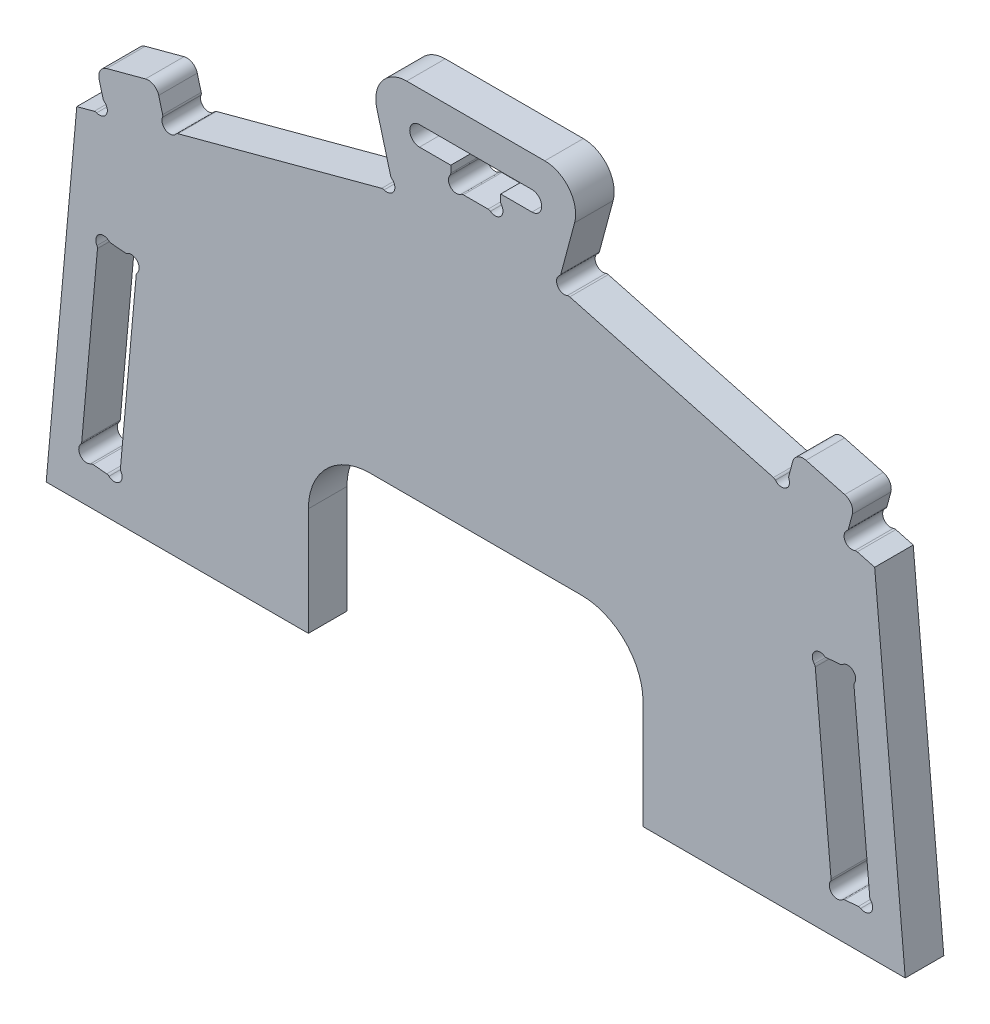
ISO-10303-21;
HEADER;
FILE_DESCRIPTION(('STEP AP214'),'2;1');
FILE_NAME('part.step','',(''),(''),'','','');
FILE_SCHEMA(('AUTOMOTIVE_DESIGN { 1 0 10303 214 1 1 1 1 }'));
ENDSEC;
DATA;
#1=APPLICATION_CONTEXT('core data for automotive mechanical design processes');
#2=APPLICATION_PROTOCOL_DEFINITION('international standard','automotive_design',2000,#1);
#3=PRODUCT_CONTEXT('',#1,'mechanical');
#4=PRODUCT('Part','Part','',(#3));
#5=PRODUCT_RELATED_PRODUCT_CATEGORY('part','',(#4));
#6=PRODUCT_DEFINITION_FORMATION('','',#4);
#7=PRODUCT_DEFINITION_CONTEXT('part definition',#1,'design');
#8=PRODUCT_DEFINITION('design','',#6,#7);
#9=PRODUCT_DEFINITION_SHAPE('','',#8);
#10=(LENGTH_UNIT() NAMED_UNIT(*) SI_UNIT(.MILLI.,.METRE.));
#11=(NAMED_UNIT(*) PLANE_ANGLE_UNIT() SI_UNIT($,.RADIAN.));
#12=(NAMED_UNIT(*) SI_UNIT($,.STERADIAN.) SOLID_ANGLE_UNIT());
#13=UNCERTAINTY_MEASURE_WITH_UNIT(LENGTH_MEASURE(1.E-05),#10,'distance_accuracy_value','');
#14=(GEOMETRIC_REPRESENTATION_CONTEXT(3) GLOBAL_UNCERTAINTY_ASSIGNED_CONTEXT((#13)) GLOBAL_UNIT_ASSIGNED_CONTEXT((#10,
#11,#12)) REPRESENTATION_CONTEXT('',''));
#15=CARTESIAN_POINT('',(0.,0.,0.));
#16=DIRECTION('',(0.,0.,1.));
#17=DIRECTION('',(1.,0.,0.));
#18=AXIS2_PLACEMENT_3D('',#15,#16,#17);
#19=CARTESIAN_POINT('',(39.2829190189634,234.352883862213,25.));
#20=DIRECTION('',(0.,0.,1.));
#21=DIRECTION('',(1.,0.,0.));
#22=AXIS2_PLACEMENT_3D('',#19,#20,#21);
#23=PLANE('',#22);
#24=DIRECTION('',(-1.,0.,0.));
#25=VECTOR('',#24,1.);
#26=CARTESIAN_POINT('',(278.5,109.999999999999,25.));
#27=LINE('',#26,#25);
#28=CARTESIAN_POINT('',(347.,110.000000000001,25.));
#29=VERTEX_POINT('',#28);
#30=CARTESIAN_POINT('',(210.,110.000000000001,25.));
#31=VERTEX_POINT('',#30);
#32=EDGE_CURVE('E1113',#29,#31,#27,.T.);
#33=ORIENTED_EDGE('',*,*,#32,.F.);
#34=CARTESIAN_POINT('',(347.,70.0000000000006,25.));
#35=DIRECTION('',(0.,0.,-1.));
#36=DIRECTION('',(-1.,0.,0.));
#37=AXIS2_PLACEMENT_3D('',#34,#35,#36);
#38=CIRCLE('',#37,40.);
#39=CARTESIAN_POINT('',(387.,70.0000000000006,25.));
#40=VERTEX_POINT('',#39);
#41=EDGE_CURVE('E769',#29,#40,#38,.T.);
#42=ORIENTED_EDGE('',*,*,#41,.T.);
#43=DIRECTION('',(0.,-1.,0.));
#44=VECTOR('',#43,1.);
#45=CARTESIAN_POINT('',(387.,70.0000000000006,25.));
#46=LINE('',#45,#44);
#47=CARTESIAN_POINT('',(387.,6.52256026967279E-13,25.));
#48=VERTEX_POINT('',#47);
#49=EDGE_CURVE('E766',#40,#48,#46,.T.);
#50=ORIENTED_EDGE('',*,*,#49,.T.);
#51=DIRECTION('',(1.,0.,0.));
#52=VECTOR('',#51,1.);
#53=CARTESIAN_POINT('',(387.,6.52256026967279E-13,25.));
#54=LINE('',#53,#52);
#55=CARTESIAN_POINT('',(557.,0.,25.));
#56=VERTEX_POINT('',#55);
#57=EDGE_CURVE('E763',#48,#56,#54,.T.);
#58=ORIENTED_EDGE('',*,*,#57,.T.);
#59=DIRECTION('',(-0.089486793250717,0.99598800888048,0.));
#60=VECTOR('',#59,1.);
#61=CARTESIAN_POINT('',(557.,0.,25.));
#62=LINE('',#61,#60);
#63=CARTESIAN_POINT('',(537.168645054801,220.722980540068,25.));
#64=VERTEX_POINT('',#63);
#65=EDGE_CURVE('E760',#56,#64,#62,.T.);
#66=ORIENTED_EDGE('',*,*,#65,.T.);
#67=DIRECTION('',(0.965925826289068,-0.258819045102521,0.));
#68=VECTOR('',#67,1.);
#69=CARTESIAN_POINT('',(525.881409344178,223.747386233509,25.));
#70=LINE('',#69,#68);
#71=CARTESIAN_POINT('',(525.881409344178,223.747386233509,25.));
#72=VERTEX_POINT('',#71);
#73=EDGE_CURVE('E757',#72,#64,#70,.T.);
#74=ORIENTED_EDGE('',*,*,#73,.F.);
#75=CARTESIAN_POINT('',(525.234361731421,221.332571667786,25.));
#76=DIRECTION('',(0.,0.,-1.));
#77=DIRECTION('',(-1.,0.,0.));
#78=AXIS2_PLACEMENT_3D('',#75,#76,#77);
#79=CIRCLE('',#78,2.50000000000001);
#80=CARTESIAN_POINT('',(524.31653122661,223.657993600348,25.));
#81=VERTEX_POINT('',#80);
#82=EDGE_CURVE('E754',#81,#72,#79,.T.);
#83=ORIENTED_EDGE('',*,*,#82,.F.);
#84=CARTESIAN_POINT('',(522.444156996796,228.401854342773,25.));
#85=DIRECTION('',(0.,0.,1.));
#86=DIRECTION('',(1.,0.,0.));
#87=AXIS2_PLACEMENT_3D('',#84,#85,#86);
#88=CIRCLE('',#87,5.10000000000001);
#89=CARTESIAN_POINT('',(519.272040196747,232.395308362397,25.));
#90=VERTEX_POINT('',#89);
#91=EDGE_CURVE('E751',#90,#81,#88,.T.);
#92=ORIENTED_EDGE('',*,*,#91,.F.);
#93=CARTESIAN_POINT('',(517.717080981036,234.352883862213,25.));
#94=DIRECTION('',(0.,0.,-1.));
#95=DIRECTION('',(-1.,0.,0.));
#96=AXIS2_PLACEMENT_3D('',#93,#94,#95);
#97=CIRCLE('',#96,2.50000000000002);
#98=CARTESIAN_POINT('',(520.131895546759,233.705836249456,25.));
#99=VERTEX_POINT('',#98);
#100=EDGE_CURVE('E748',#99,#90,#97,.T.);
#101=ORIENTED_EDGE('',*,*,#100,.F.);
#102=DIRECTION('',(-0.258819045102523,-0.965925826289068,0.));
#103=VECTOR('',#102,1.);
#104=CARTESIAN_POINT('',(524.497903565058,250.,25.));
#105=LINE('',#104,#103);
#106=CARTESIAN_POINT('',(522.68617024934,243.238519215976,25.));
#107=VERTEX_POINT('',#106);
#108=EDGE_CURVE('E744',#107,#99,#105,.T.);
#109=ORIENTED_EDGE('',*,*,#108,.F.);
#110=CARTESIAN_POINT('',(515.924689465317,245.050252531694,25.));
#111=DIRECTION('',(0.,0.,-1.));
#112=DIRECTION('',(-1.,0.,0.));
#113=AXIS2_PLACEMENT_3D('',#110,#111,#112);
#114=CIRCLE('',#113,7.);
#115=CARTESIAN_POINT('',(517.736422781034,251.811733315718,25.));
#116=VERTEX_POINT('',#115);
#117=EDGE_CURVE('E967',#116,#107,#114,.T.);
#118=ORIENTED_EDGE('',*,*,#117,.F.);
#119=DIRECTION('',(0.965925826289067,-0.258819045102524,0.));
#120=VECTOR('',#119,1.);
#121=CARTESIAN_POINT('',(485.860870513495,260.352761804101,25.));
#122=LINE('',#121,#120);
#123=CARTESIAN_POINT('',(492.622351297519,258.541028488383,25.));
#124=VERTEX_POINT('',#123);
#125=EDGE_CURVE('E741',#124,#116,#122,.T.);
#126=ORIENTED_EDGE('',*,*,#125,.F.);
#127=CARTESIAN_POINT('',(490.810617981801,251.77954770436,25.));
#128=DIRECTION('',(0.,0.,-1.));
#129=DIRECTION('',(-1.,0.,0.));
#130=AXIS2_PLACEMENT_3D('',#127,#128,#129);
#131=CIRCLE('',#130,7.);
#132=CARTESIAN_POINT('',(484.049137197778,253.591281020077,25.));
#133=VERTEX_POINT('',#132);
#134=EDGE_CURVE('E964',#133,#124,#131,.T.);
#135=ORIENTED_EDGE('',*,*,#134,.F.);
#136=DIRECTION('',(-0.258819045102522,-0.965925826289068,0.));
#137=VECTOR('',#136,1.);
#138=CARTESIAN_POINT('',(485.860870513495,260.352761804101,25.));
#139=LINE('',#138,#137);
#140=CARTESIAN_POINT('',(481.494862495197,244.058598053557,25.));
#141=VERTEX_POINT('',#140);
#142=EDGE_CURVE('E817',#133,#141,#139,.T.);
#143=ORIENTED_EDGE('',*,*,#142,.T.);
#144=CARTESIAN_POINT('',(483.909677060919,243.411550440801,25.));
#145=DIRECTION('',(0.,0.,-1.));
#146=DIRECTION('',(-1.,0.,0.));
#147=AXIS2_PLACEMENT_3D('',#144,#145,#146);
#148=CIRCLE('',#147,2.5);
#149=CARTESIAN_POINT('',(481.584255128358,242.49371993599,25.));
#150=VERTEX_POINT('',#149);
#151=EDGE_CURVE('E814',#150,#141,#148,.T.);
#152=ORIENTED_EDGE('',*,*,#151,.F.);
#153=CARTESIAN_POINT('',(476.840394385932,240.621345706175,25.));
#154=DIRECTION('',(0.,0.,-1.));
#155=DIRECTION('',(-1.,0.,0.));
#156=AXIS2_PLACEMENT_3D('',#153,#154,#155);
#157=CIRCLE('',#156,5.1);
#158=CARTESIAN_POINT('',(472.846940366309,237.449228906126,25.));
#159=VERTEX_POINT('',#158);
#160=EDGE_CURVE('E811',#150,#159,#157,.T.);
#161=ORIENTED_EDGE('',*,*,#160,.T.);
#162=CARTESIAN_POINT('',(470.889364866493,235.894269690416,25.));
#163=DIRECTION('',(0.,0.,1.));
#164=DIRECTION('',(1.,0.,0.));
#165=AXIS2_PLACEMENT_3D('',#162,#163,#164);
#166=CIRCLE('',#165,2.5);
#167=CARTESIAN_POINT('',(471.536412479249,238.309084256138,25.));
#168=VERTEX_POINT('',#167);
#169=EDGE_CURVE('E808',#159,#168,#166,.T.);
#170=ORIENTED_EDGE('',*,*,#169,.T.);
#171=DIRECTION('',(-0.965925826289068,0.258819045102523,0.));
#172=VECTOR('',#171,1.);
#173=CARTESIAN_POINT('',(471.536412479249,238.309084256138,25.));
#174=LINE('',#173,#172);
#175=CARTESIAN_POINT('',(339.457724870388,273.699461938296,25.));
#176=VERTEX_POINT('',#175);
#177=EDGE_CURVE('E805',#168,#176,#174,.T.);
#178=ORIENTED_EDGE('',*,*,#177,.T.);
#179=CARTESIAN_POINT('',(338.810677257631,271.284647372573,25.));
#180=DIRECTION('',(0.,0.,-1.));
#181=DIRECTION('',(-1.,0.,0.));
#182=AXIS2_PLACEMENT_3D('',#179,#180,#181);
#183=CIRCLE('',#182,2.50000000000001);
#184=CARTESIAN_POINT('',(337.89284675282,273.610069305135,25.));
#185=VERTEX_POINT('',#184);
#186=EDGE_CURVE('E802',#185,#176,#183,.T.);
#187=ORIENTED_EDGE('',*,*,#186,.F.);
#188=CARTESIAN_POINT('',(336.020472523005,278.35393004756,25.));
#189=DIRECTION('',(0.,0.,1.));
#190=DIRECTION('',(1.,0.,0.));
#191=AXIS2_PLACEMENT_3D('',#188,#189,#190);
#192=CIRCLE('',#191,5.09999999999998);
#193=CARTESIAN_POINT('',(332.848355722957,282.347384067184,25.));
#194=VERTEX_POINT('',#193);
#195=EDGE_CURVE('E799',#194,#185,#192,.T.);
#196=ORIENTED_EDGE('',*,*,#195,.F.);
#197=CARTESIAN_POINT('',(331.293396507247,284.304959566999,25.));
#198=DIRECTION('',(0.,0.,1.));
#199=DIRECTION('',(1.,0.,0.));
#200=AXIS2_PLACEMENT_3D('',#197,#198,#199);
#201=CIRCLE('',#200,2.50000000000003);
#202=CARTESIAN_POINT('',(333.708211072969,283.657911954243,25.));
#203=VERTEX_POINT('',#202);
#204=EDGE_CURVE('E796',#194,#203,#201,.T.);
#205=ORIENTED_EDGE('',*,*,#204,.T.);
#206=DIRECTION('',(0.258819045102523,0.965925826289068,0.));
#207=VECTOR('',#206,1.);
#208=CARTESIAN_POINT('',(333.708211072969,283.657911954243,25.));
#209=LINE('',#208,#207);
#210=CARTESIAN_POINT('',(342.594935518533,316.823619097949,25.));
#211=VERTEX_POINT('',#210);
#212=EDGE_CURVE('E793',#203,#211,#209,.T.);
#213=ORIENTED_EDGE('',*,*,#212,.T.);
#214=CARTESIAN_POINT('',(323.276418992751,322.,25.));
#215=DIRECTION('',(0.,0.,1.));
#216=DIRECTION('',(1.,0.,0.));
#217=AXIS2_PLACEMENT_3D('',#214,#215,#216);
#218=CIRCLE('',#217,19.9999999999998);
#219=CARTESIAN_POINT('',(323.276418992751,341.999999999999,25.));
#220=VERTEX_POINT('',#219);
#221=EDGE_CURVE('E790',#211,#220,#218,.T.);
#222=ORIENTED_EDGE('',*,*,#221,.T.);
#223=DIRECTION('',(1.,0.,0.));
#224=VECTOR('',#223,1.);
#225=CARTESIAN_POINT('',(233.723581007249,341.999999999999,25.));
#226=LINE('',#225,#224);
#227=CARTESIAN_POINT('',(233.723581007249,341.999999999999,25.));
#228=VERTEX_POINT('',#227);
#229=EDGE_CURVE('E1138',#228,#220,#226,.T.);
#230=ORIENTED_EDGE('',*,*,#229,.F.);
#231=CARTESIAN_POINT('',(233.723581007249,322.,25.));
#232=DIRECTION('',(0.,0.,-1.));
#233=DIRECTION('',(-1.,0.,0.));
#234=AXIS2_PLACEMENT_3D('',#231,#232,#233);
#235=CIRCLE('',#234,19.9999999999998);
#236=CARTESIAN_POINT('',(214.405064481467,316.823619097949,25.));
#237=VERTEX_POINT('',#236);
#238=EDGE_CURVE('E1140',#237,#228,#235,.T.);
#239=ORIENTED_EDGE('',*,*,#238,.F.);
#240=DIRECTION('',(-0.258819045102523,0.965925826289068,0.));
#241=VECTOR('',#240,1.);
#242=CARTESIAN_POINT('',(223.291788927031,283.657911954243,25.));
#243=LINE('',#242,#241);
#244=CARTESIAN_POINT('',(223.291788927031,283.657911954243,25.));
#245=VERTEX_POINT('',#244);
#246=EDGE_CURVE('E1143',#245,#237,#243,.T.);
#247=ORIENTED_EDGE('',*,*,#246,.F.);
#248=CARTESIAN_POINT('',(225.706603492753,284.304959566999,25.));
#249=DIRECTION('',(0.,0.,-1.));
#250=DIRECTION('',(-1.,0.,0.));
#251=AXIS2_PLACEMENT_3D('',#248,#249,#250);
#252=CIRCLE('',#251,2.50000000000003);
#253=CARTESIAN_POINT('',(224.151644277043,282.347384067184,25.));
#254=VERTEX_POINT('',#253);
#255=EDGE_CURVE('E1146',#254,#245,#252,.T.);
#256=ORIENTED_EDGE('',*,*,#255,.F.);
#257=CARTESIAN_POINT('',(220.979527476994,278.35393004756,25.));
#258=DIRECTION('',(0.,0.,-1.));
#259=DIRECTION('',(-1.,0.,0.));
#260=AXIS2_PLACEMENT_3D('',#257,#258,#259);
#261=CIRCLE('',#260,5.09999999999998);
#262=CARTESIAN_POINT('',(219.10715324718,273.610069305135,25.));
#263=VERTEX_POINT('',#262);
#264=EDGE_CURVE('E1149',#254,#263,#261,.T.);
#265=ORIENTED_EDGE('',*,*,#264,.T.);
#266=CARTESIAN_POINT('',(218.189322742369,271.284647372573,25.));
#267=DIRECTION('',(0.,0.,1.));
#268=DIRECTION('',(1.,0.,0.));
#269=AXIS2_PLACEMENT_3D('',#266,#267,#268);
#270=CIRCLE('',#269,2.50000000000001);
#271=CARTESIAN_POINT('',(217.542275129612,273.699461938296,25.));
#272=VERTEX_POINT('',#271);
#273=EDGE_CURVE('E1151',#263,#272,#270,.T.);
#274=ORIENTED_EDGE('',*,*,#273,.T.);
#275=DIRECTION('',(0.965925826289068,0.258819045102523,0.));
#276=VECTOR('',#275,1.);
#277=CARTESIAN_POINT('',(85.4635875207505,238.309084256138,25.));
#278=LINE('',#277,#276);
#279=CARTESIAN_POINT('',(85.4635875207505,238.309084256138,25.));
#280=VERTEX_POINT('',#279);
#281=EDGE_CURVE('E1153',#280,#272,#278,.T.);
#282=ORIENTED_EDGE('',*,*,#281,.F.);
#283=CARTESIAN_POINT('',(86.1106351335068,235.894269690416,25.));
#284=DIRECTION('',(0.,0.,-1.));
#285=DIRECTION('',(-1.,0.,0.));
#286=AXIS2_PLACEMENT_3D('',#283,#284,#285);
#287=CIRCLE('',#286,2.5);
#288=CARTESIAN_POINT('',(84.1530596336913,237.449228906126,25.));
#289=VERTEX_POINT('',#288);
#290=EDGE_CURVE('E1156',#289,#280,#287,.T.);
#291=ORIENTED_EDGE('',*,*,#290,.F.);
#292=CARTESIAN_POINT('',(80.1596056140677,240.621345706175,25.));
#293=DIRECTION('',(0.,0.,1.));
#294=DIRECTION('',(1.,0.,0.));
#295=AXIS2_PLACEMENT_3D('',#292,#293,#294);
#296=CIRCLE('',#295,5.1);
#297=CARTESIAN_POINT('',(75.4157448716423,242.49371993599,25.));
#298=VERTEX_POINT('',#297);
#299=EDGE_CURVE('E1159',#298,#289,#296,.T.);
#300=ORIENTED_EDGE('',*,*,#299,.F.);
#301=CARTESIAN_POINT('',(73.0903229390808,243.411550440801,25.));
#302=DIRECTION('',(0.,0.,1.));
#303=DIRECTION('',(1.,0.,0.));
#304=AXIS2_PLACEMENT_3D('',#301,#302,#303);
#305=CIRCLE('',#304,2.5);
#306=CARTESIAN_POINT('',(75.5051375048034,244.058598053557,25.));
#307=VERTEX_POINT('',#306);
#308=EDGE_CURVE('E1162',#298,#307,#305,.T.);
#309=ORIENTED_EDGE('',*,*,#308,.T.);
#310=DIRECTION('',(0.258819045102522,-0.965925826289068,0.));
#311=VECTOR('',#310,1.);
#312=CARTESIAN_POINT('',(71.1391294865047,260.352761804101,25.));
#313=LINE('',#312,#311);
#314=CARTESIAN_POINT('',(72.9508628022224,253.591281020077,25.));
#315=VERTEX_POINT('',#314);
#316=EDGE_CURVE('E1165',#315,#307,#313,.T.);
#317=ORIENTED_EDGE('',*,*,#316,.F.);
#318=CARTESIAN_POINT('',(66.1893820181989,251.77954770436,25.));
#319=DIRECTION('',(0.,0.,1.));
#320=DIRECTION('',(1.,0.,0.));
#321=AXIS2_PLACEMENT_3D('',#318,#319,#320);
#322=CIRCLE('',#321,7.);
#323=CARTESIAN_POINT('',(64.3776487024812,258.541028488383,25.));
#324=VERTEX_POINT('',#323);
#325=EDGE_CURVE('E1315',#315,#324,#322,.T.);
#326=ORIENTED_EDGE('',*,*,#325,.T.);
#327=DIRECTION('',(-0.965925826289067,-0.258819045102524,0.));
#328=VECTOR('',#327,1.);
#329=CARTESIAN_POINT('',(71.1391294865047,260.352761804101,25.));
#330=LINE('',#329,#328);
#331=CARTESIAN_POINT('',(39.2635772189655,251.811733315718,25.));
#332=VERTEX_POINT('',#331);
#333=EDGE_CURVE('E1088',#324,#332,#330,.T.);
#334=ORIENTED_EDGE('',*,*,#333,.T.);
#335=CARTESIAN_POINT('',(41.0753105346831,245.050252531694,25.));
#336=DIRECTION('',(0.,0.,1.));
#337=DIRECTION('',(1.,0.,0.));
#338=AXIS2_PLACEMENT_3D('',#335,#336,#337);
#339=CIRCLE('',#338,7.);
#340=CARTESIAN_POINT('',(34.3138297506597,243.238519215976,25.));
#341=VERTEX_POINT('',#340);
#342=EDGE_CURVE('E41',#332,#341,#339,.T.);
#343=ORIENTED_EDGE('',*,*,#342,.T.);
#344=DIRECTION('',(0.258819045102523,-0.965925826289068,0.));
#345=VECTOR('',#344,1.);
#346=CARTESIAN_POINT('',(32.502096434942,250.,25.));
#347=LINE('',#346,#345);
#348=CARTESIAN_POINT('',(36.8681044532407,233.705836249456,25.));
#349=VERTEX_POINT('',#348);
#350=EDGE_CURVE('E1090',#341,#349,#347,.T.);
#351=ORIENTED_EDGE('',*,*,#350,.T.);
#352=CARTESIAN_POINT('',(39.2829190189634,234.352883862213,25.));
#353=DIRECTION('',(0.,0.,1.));
#354=DIRECTION('',(1.,0.,0.));
#355=AXIS2_PLACEMENT_3D('',#352,#353,#354);
#356=CIRCLE('',#355,2.50000000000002);
#357=CARTESIAN_POINT('',(37.7279598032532,232.395308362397,25.));
#358=VERTEX_POINT('',#357);
#359=EDGE_CURVE('E1093',#349,#358,#356,.T.);
#360=ORIENTED_EDGE('',*,*,#359,.T.);
#361=CARTESIAN_POINT('',(34.5558430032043,228.401854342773,25.));
#362=DIRECTION('',(0.,0.,-1.));
#363=DIRECTION('',(-1.,0.,0.));
#364=AXIS2_PLACEMENT_3D('',#361,#362,#363);
#365=CIRCLE('',#364,5.10000000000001);
#366=CARTESIAN_POINT('',(32.6834687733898,223.657993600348,25.));
#367=VERTEX_POINT('',#366);
#368=EDGE_CURVE('E1095',#358,#367,#365,.T.);
#369=ORIENTED_EDGE('',*,*,#368,.T.);
#370=CARTESIAN_POINT('',(31.7656382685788,221.332571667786,25.));
#371=DIRECTION('',(0.,0.,1.));
#372=DIRECTION('',(1.,0.,0.));
#373=AXIS2_PLACEMENT_3D('',#370,#371,#372);
#374=CIRCLE('',#373,2.50000000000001);
#375=CARTESIAN_POINT('',(31.1185906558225,223.747386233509,25.));
#376=VERTEX_POINT('',#375);
#377=EDGE_CURVE('E1097',#367,#376,#374,.T.);
#378=ORIENTED_EDGE('',*,*,#377,.T.);
#379=DIRECTION('',(-0.965925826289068,-0.258819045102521,0.));
#380=VECTOR('',#379,1.);
#381=CARTESIAN_POINT('',(31.1185906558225,223.747386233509,25.));
#382=LINE('',#381,#380);
#383=CARTESIAN_POINT('',(19.8313549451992,220.722980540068,25.));
#384=VERTEX_POINT('',#383);
#385=EDGE_CURVE('E1099',#376,#384,#382,.T.);
#386=ORIENTED_EDGE('',*,*,#385,.T.);
#387=DIRECTION('',(0.089486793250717,0.99598800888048,0.));
#388=VECTOR('',#387,1.);
#389=CARTESIAN_POINT('',(0.,0.,25.));
#390=LINE('',#389,#388);
#391=CARTESIAN_POINT('',(0.,0.,25.));
#392=VERTEX_POINT('',#391);
#393=EDGE_CURVE('E1101',#392,#384,#390,.T.);
#394=ORIENTED_EDGE('',*,*,#393,.F.);
#395=DIRECTION('',(-1.,0.,0.));
#396=VECTOR('',#395,1.);
#397=CARTESIAN_POINT('',(170.,6.52256026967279E-13,25.));
#398=LINE('',#397,#396);
#399=CARTESIAN_POINT('',(170.,6.52256026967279E-13,25.));
#400=VERTEX_POINT('',#399);
#401=EDGE_CURVE('E1104',#400,#392,#398,.T.);
#402=ORIENTED_EDGE('',*,*,#401,.F.);
#403=DIRECTION('',(0.,-1.,0.));
#404=VECTOR('',#403,1.);
#405=CARTESIAN_POINT('',(170.,70.0000000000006,25.));
#406=LINE('',#405,#404);
#407=CARTESIAN_POINT('',(170.,70.0000000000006,25.));
#408=VERTEX_POINT('',#407);
#409=EDGE_CURVE('E1107',#408,#400,#406,.T.);
#410=ORIENTED_EDGE('',*,*,#409,.F.);
#411=CARTESIAN_POINT('',(210.,70.0000000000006,25.));
#412=DIRECTION('',(0.,0.,1.));
#413=DIRECTION('',(1.,0.,0.));
#414=AXIS2_PLACEMENT_3D('',#411,#412,#413);
#415=CIRCLE('',#414,40.);
#416=EDGE_CURVE('E1110',#31,#408,#415,.T.);
#417=ORIENTED_EDGE('',*,*,#416,.F.);
#418=EDGE_LOOP('',(#33,#42,#50,#58,#66,#74,#83,#92,#101,#109,#118,#126,#135,#143,#152,#161,#170,
#178,#187,#196,#205,#213,#222,#230,#239,#247,#256,#265,#274,#282,#291,#300,#309,#317,#326,#334,
#343,#351,#360,#369,#378,#386,#394,#402,#410,#417));
#419=FACE_BOUND('',#418,.T.);
#420=CARTESIAN_POINT('',(286.544248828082,294.025447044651,25.));
#421=DIRECTION('',(0.,0.,1.));
#422=DIRECTION('',(1.,0.,0.));
#423=AXIS2_PLACEMENT_3D('',#420,#421,#422);
#424=CIRCLE('',#423,2.50000000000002);
#425=CARTESIAN_POINT('',(288.032668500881,296.03408013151,25.));
#426=VERTEX_POINT('',#425);
#427=CARTESIAN_POINT('',(286.544248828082,296.525447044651,25.));
#428=VERTEX_POINT('',#427);
#429=EDGE_CURVE('E772',#426,#428,#424,.T.);
#430=ORIENTED_EDGE('',*,*,#429,.T.);
#431=DIRECTION('',(1.,0.,0.));
#432=VECTOR('',#431,1.);
#433=CARTESIAN_POINT('',(270.455751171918,296.525447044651,25.));
#434=LINE('',#433,#432);
#435=CARTESIAN_POINT('',(270.455751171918,296.525447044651,25.));
#436=VERTEX_POINT('',#435);
#437=EDGE_CURVE('E1116',#436,#428,#434,.T.);
#438=ORIENTED_EDGE('',*,*,#437,.F.);
#439=CARTESIAN_POINT('',(270.455751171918,294.025447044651,25.));
#440=DIRECTION('',(0.,0.,-1.));
#441=DIRECTION('',(-1.,0.,0.));
#442=AXIS2_PLACEMENT_3D('',#439,#440,#441);
#443=CIRCLE('',#442,2.50000000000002);
#444=CARTESIAN_POINT('',(268.967331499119,296.03408013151,25.));
#445=VERTEX_POINT('',#444);
#446=EDGE_CURVE('E1118',#445,#436,#443,.T.);
#447=ORIENTED_EDGE('',*,*,#446,.F.);
#448=CARTESIAN_POINT('',(265.930955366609,300.131691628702,25.));
#449=DIRECTION('',(0.,0.,1.));
#450=DIRECTION('',(1.,0.,0.));
#451=AXIS2_PLACEMENT_3D('',#448,#449,#450);
#452=CIRCLE('',#451,5.09999999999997);
#453=CARTESIAN_POINT('',(261.833343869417,303.168067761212,25.));
#454=VERTEX_POINT('',#453);
#455=EDGE_CURVE('E1121',#454,#445,#452,.T.);
#456=ORIENTED_EDGE('',*,*,#455,.F.);
#457=CARTESIAN_POINT('',(259.824710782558,304.656487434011,25.));
#458=DIRECTION('',(0.,0.,1.));
#459=DIRECTION('',(1.,0.,0.));
#460=AXIS2_PLACEMENT_3D('',#457,#458,#459);
#461=CIRCLE('',#460,2.49999999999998);
#462=CARTESIAN_POINT('',(262.324710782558,304.656487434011,25.));
#463=VERTEX_POINT('',#462);
#464=EDGE_CURVE('E1124',#454,#463,#461,.T.);
#465=ORIENTED_EDGE('',*,*,#464,.T.);
#466=DIRECTION('',(0.,-1.,0.));
#467=VECTOR('',#466,1.);
#468=CARTESIAN_POINT('',(262.324710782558,309.075447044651,25.));
#469=LINE('',#468,#467);
#470=CARTESIAN_POINT('',(262.324710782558,309.075447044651,25.));
#471=VERTEX_POINT('',#470);
#472=EDGE_CURVE('E1126',#471,#463,#469,.T.);
#473=ORIENTED_EDGE('',*,*,#472,.F.);
#474=DIRECTION('',(1.,0.,0.));
#475=VECTOR('',#474,1.);
#476=CARTESIAN_POINT('',(242.040047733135,309.075447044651,25.));
#477=LINE('',#476,#475);
#478=CARTESIAN_POINT('',(242.040047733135,309.075447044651,25.));
#479=VERTEX_POINT('',#478);
#480=EDGE_CURVE('E1129',#479,#471,#477,.T.);
#481=ORIENTED_EDGE('',*,*,#480,.F.);
#482=CARTESIAN_POINT('',(242.040047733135,315.400447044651,25.));
#483=DIRECTION('',(0.,0.,1.));
#484=DIRECTION('',(1.,0.,0.));
#485=AXIS2_PLACEMENT_3D('',#482,#483,#484);
#486=CIRCLE('',#485,6.32499999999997);
#487=CARTESIAN_POINT('',(242.040047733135,321.725447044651,25.));
#488=VERTEX_POINT('',#487);
#489=EDGE_CURVE('E1132',#488,#479,#486,.T.);
#490=ORIENTED_EDGE('',*,*,#489,.F.);
#491=DIRECTION('',(-1.,0.,0.));
#492=VECTOR('',#491,1.);
#493=CARTESIAN_POINT('',(278.5,321.725447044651,25.));
#494=LINE('',#493,#492);
#495=CARTESIAN_POINT('',(314.959952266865,321.725447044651,25.));
#496=VERTEX_POINT('',#495);
#497=EDGE_CURVE('E1135',#496,#488,#494,.T.);
#498=ORIENTED_EDGE('',*,*,#497,.F.);
#499=CARTESIAN_POINT('',(314.959952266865,315.400447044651,25.));
#500=DIRECTION('',(0.,0.,-1.));
#501=DIRECTION('',(-1.,0.,0.));
#502=AXIS2_PLACEMENT_3D('',#499,#500,#501);
#503=CIRCLE('',#502,6.32499999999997);
#504=CARTESIAN_POINT('',(314.959952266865,309.075447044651,25.));
#505=VERTEX_POINT('',#504);
#506=EDGE_CURVE('E787',#496,#505,#503,.T.);
#507=ORIENTED_EDGE('',*,*,#506,.T.);
#508=DIRECTION('',(-1.,0.,0.));
#509=VECTOR('',#508,1.);
#510=CARTESIAN_POINT('',(314.959952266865,309.075447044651,25.));
#511=LINE('',#510,#509);
#512=CARTESIAN_POINT('',(294.675289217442,309.075447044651,25.));
#513=VERTEX_POINT('',#512);
#514=EDGE_CURVE('E784',#505,#513,#511,.T.);
#515=ORIENTED_EDGE('',*,*,#514,.T.);
#516=DIRECTION('',(0.,-1.,0.));
#517=VECTOR('',#516,1.);
#518=CARTESIAN_POINT('',(294.675289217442,309.075447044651,25.));
#519=LINE('',#518,#517);
#520=CARTESIAN_POINT('',(294.675289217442,304.656487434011,25.));
#521=VERTEX_POINT('',#520);
#522=EDGE_CURVE('E781',#513,#521,#519,.T.);
#523=ORIENTED_EDGE('',*,*,#522,.T.);
#524=CARTESIAN_POINT('',(297.175289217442,304.656487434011,25.));
#525=DIRECTION('',(0.,0.,-1.));
#526=DIRECTION('',(-1.,0.,0.));
#527=AXIS2_PLACEMENT_3D('',#524,#525,#526);
#528=CIRCLE('',#527,2.49999999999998);
#529=CARTESIAN_POINT('',(295.166656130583,303.168067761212,25.));
#530=VERTEX_POINT('',#529);
#531=EDGE_CURVE('E778',#530,#521,#528,.T.);
#532=ORIENTED_EDGE('',*,*,#531,.F.);
#533=CARTESIAN_POINT('',(291.069044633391,300.131691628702,25.));
#534=DIRECTION('',(0.,0.,-1.));
#535=DIRECTION('',(-1.,0.,0.));
#536=AXIS2_PLACEMENT_3D('',#533,#534,#535);
#537=CIRCLE('',#536,5.09999999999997);
#538=EDGE_CURVE('E775',#530,#426,#537,.T.);
#539=ORIENTED_EDGE('',*,*,#538,.T.);
#540=EDGE_LOOP('',(#430,#438,#447,#456,#465,#473,#481,#490,#498,#507,#515,#523,#532,#539));
#541=FACE_BOUND('',#540,.T.);
#542=CARTESIAN_POINT('',(26.2084702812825,29.0219087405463,25.));
#543=DIRECTION('',(0.,0.,1.));
#544=DIRECTION('',(1.,0.,0.));
#545=AXIS2_PLACEMENT_3D('',#542,#543,#544);
#546=CIRCLE('',#545,5.1);
#547=CARTESIAN_POINT('',(22.3990139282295,32.4127850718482,25.));
#548=VERTEX_POINT('',#547);
#549=CARTESIAN_POINT('',(28.8659823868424,24.6690212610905,25.));
#550=VERTEX_POINT('',#549);
#551=EDGE_CURVE('E975',#548,#550,#546,.T.);
#552=ORIENTED_EDGE('',*,*,#551,.F.);
#553=CARTESIAN_POINT('',(20.5316333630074,34.0749793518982,25.));
#554=DIRECTION('',(0.,0.,-1.));
#555=DIRECTION('',(1.,0.,0.));
#556=AXIS2_PLACEMENT_3D('',#553,#554,#555);
#557=CIRCLE('',#556,2.5);
#558=CARTESIAN_POINT('',(23.0216033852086,33.8512623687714,25.));
#559=VERTEX_POINT('',#558);
#560=EDGE_CURVE('E973',#559,#548,#557,.T.);
#561=ORIENTED_EDGE('',*,*,#560,.F.);
#562=DIRECTION('',(-0.0894867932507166,-0.99598800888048,0.));
#563=VECTOR('',#562,1.);
#564=CARTESIAN_POINT('',(33.2533371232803,147.73045887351,25.));
#565=LINE('',#564,#563);
#566=CARTESIAN_POINT('',(33.2533371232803,147.73045887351,25.));
#567=VERTEX_POINT('',#566);
#568=EDGE_CURVE('E1005',#567,#559,#565,.T.);
#569=ORIENTED_EDGE('',*,*,#568,.F.);
#570=CARTESIAN_POINT('',(30.7633671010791,147.954175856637,25.));
#571=DIRECTION('',(0.,0.,-1.));
#572=DIRECTION('',(-1.,0.,0.));
#573=AXIS2_PLACEMENT_3D('',#570,#571,#572);
#574=CIRCLE('',#573,2.49999999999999);
#575=CARTESIAN_POINT('',(32.8971354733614,149.256877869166,25.));
#576=VERTEX_POINT('',#575);
#577=EDGE_CURVE('E1002',#576,#567,#574,.T.);
#578=ORIENTED_EDGE('',*,*,#577,.F.);
#579=CARTESIAN_POINT('',(37.2500229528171,151.914389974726,25.));
#580=DIRECTION('',(0.,0.,1.));
#581=DIRECTION('',(-1.,0.,0.));
#582=AXIS2_PLACEMENT_3D('',#579,#580,#581);
#583=CIRCLE('',#582,5.1);
#584=CARTESIAN_POINT('',(40.640899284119,155.723846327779,25.));
#585=VERTEX_POINT('',#584);
#586=EDGE_CURVE('E1000',#585,#576,#583,.T.);
#587=ORIENTED_EDGE('',*,*,#586,.F.);
#588=CARTESIAN_POINT('',(42.303093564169,157.591226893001,25.));
#589=DIRECTION('',(0.,0.,-1.));
#590=DIRECTION('',(1.,0.,0.));
#591=AXIS2_PLACEMENT_3D('',#588,#589,#590);
#592=CIRCLE('',#591,2.5);
#593=CARTESIAN_POINT('',(42.0793765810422,155.1012568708,25.));
#594=VERTEX_POINT('',#593);
#595=EDGE_CURVE('E998',#594,#585,#592,.T.);
#596=ORIENTED_EDGE('',*,*,#595,.F.);
#597=DIRECTION('',(-0.99598800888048,0.0894867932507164,0.));
#598=VECTOR('',#597,1.);
#599=CARTESIAN_POINT('',(42.0793765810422,155.1012568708,25.));
#600=LINE('',#599,#598);
#601=CARTESIAN_POINT('',(50.9814369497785,154.301431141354,25.));
#602=VERTEX_POINT('',#601);
#603=EDGE_CURVE('E996',#602,#594,#600,.T.);
#604=ORIENTED_EDGE('',*,*,#603,.F.);
#605=CARTESIAN_POINT('',(51.2051539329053,156.791401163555,25.));
#606=DIRECTION('',(0.,0.,-1.));
#607=DIRECTION('',(-1.,0.,0.));
#608=AXIS2_PLACEMENT_3D('',#605,#606,#607);
#609=CIRCLE('',#608,2.5);
#610=CARTESIAN_POINT('',(52.5078559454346,154.657632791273,25.));
#611=VERTEX_POINT('',#610);
#612=EDGE_CURVE('E994',#611,#602,#609,.T.);
#613=ORIENTED_EDGE('',*,*,#612,.F.);
#614=CARTESIAN_POINT('',(55.1653680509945,150.304745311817,25.));
#615=DIRECTION('',(0.,0.,1.));
#616=DIRECTION('',(1.,0.,0.));
#617=AXIS2_PLACEMENT_3D('',#614,#615,#616);
#618=CIRCLE('',#617,5.1);
#619=CARTESIAN_POINT('',(58.9748244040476,146.913868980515,25.));
#620=VERTEX_POINT('',#619);
#621=EDGE_CURVE('E992',#620,#611,#618,.T.);
#622=ORIENTED_EDGE('',*,*,#621,.F.);
#623=CARTESIAN_POINT('',(60.8422049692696,145.251674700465,25.));
#624=DIRECTION('',(0.,0.,-1.));
#625=DIRECTION('',(1.,0.,0.));
#626=AXIS2_PLACEMENT_3D('',#623,#624,#625);
#627=CIRCLE('',#626,2.5);
#628=CARTESIAN_POINT('',(58.3522349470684,145.475391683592,25.));
#629=VERTEX_POINT('',#628);
#630=EDGE_CURVE('E990',#629,#620,#627,.T.);
#631=ORIENTED_EDGE('',*,*,#630,.F.);
#632=DIRECTION('',(0.0894867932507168,0.99598800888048,0.));
#633=VECTOR('',#632,1.);
#634=CARTESIAN_POINT('',(58.3522349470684,145.475391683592,25.));
#635=LINE('',#634,#633);
#636=CARTESIAN_POINT('',(48.1205012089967,31.5961951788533,25.));
#637=VERTEX_POINT('',#636);
#638=EDGE_CURVE('E988',#637,#629,#635,.T.);
#639=ORIENTED_EDGE('',*,*,#638,.F.);
#640=CARTESIAN_POINT('',(50.6104712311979,31.3724781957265,25.));
#641=DIRECTION('',(0.,0.,-1.));
#642=DIRECTION('',(-1.,0.,0.));
#643=AXIS2_PLACEMENT_3D('',#640,#641,#642);
#644=CIRCLE('',#643,2.49999999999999);
#645=CARTESIAN_POINT('',(48.4767028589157,30.0697761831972,25.));
#646=VERTEX_POINT('',#645);
#647=EDGE_CURVE('E986',#646,#637,#644,.T.);
#648=ORIENTED_EDGE('',*,*,#647,.F.);
#649=CARTESIAN_POINT('',(44.1238153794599,27.4122640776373,25.));
#650=DIRECTION('',(0.,0.,1.));
#651=DIRECTION('',(-1.,0.,0.));
#652=AXIS2_PLACEMENT_3D('',#649,#650,#651);
#653=CIRCLE('',#652,5.10000000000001);
#654=CARTESIAN_POINT('',(40.732939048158,23.6028077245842,25.));
#655=VERTEX_POINT('',#654);
#656=EDGE_CURVE('E984',#655,#646,#653,.T.);
#657=ORIENTED_EDGE('',*,*,#656,.F.);
#658=CARTESIAN_POINT('',(39.070744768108,21.7354271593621,25.));
#659=DIRECTION('',(0.,0.,-1.));
#660=DIRECTION('',(1.,0.,0.));
#661=AXIS2_PLACEMENT_3D('',#658,#659,#660);
#662=CIRCLE('',#661,2.5);
#663=CARTESIAN_POINT('',(39.2944617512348,24.2253971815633,25.));
#664=VERTEX_POINT('',#663);
#665=EDGE_CURVE('E982',#664,#655,#662,.T.);
#666=ORIENTED_EDGE('',*,*,#665,.F.);
#667=DIRECTION('',(0.99598800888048,-0.0894867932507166,0.));
#668=VECTOR('',#667,1.);
#669=CARTESIAN_POINT('',(30.3924013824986,25.0252229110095,25.));
#670=LINE('',#669,#668);
#671=CARTESIAN_POINT('',(30.3924013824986,25.0252229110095,25.));
#672=VERTEX_POINT('',#671);
#673=EDGE_CURVE('E980',#672,#664,#670,.T.);
#674=ORIENTED_EDGE('',*,*,#673,.F.);
#675=CARTESIAN_POINT('',(30.1686843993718,22.5352528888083,25.));
#676=DIRECTION('',(0.,0.,-1.));
#677=DIRECTION('',(-1.,0.,0.));
#678=AXIS2_PLACEMENT_3D('',#675,#676,#677);
#679=CIRCLE('',#678,2.5);
#680=EDGE_CURVE('E978',#550,#672,#679,.T.);
#681=ORIENTED_EDGE('',*,*,#680,.F.);
#682=EDGE_LOOP('',(#552,#561,#569,#578,#587,#596,#604,#613,#622,#631,#639,#648,#657,#666,#674,#681));
#683=FACE_BOUND('',#682,.T.);
#684=CARTESIAN_POINT('',(530.791529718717,29.0219087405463,25.));
#685=DIRECTION('',(0.,0.,-1.));
#686=DIRECTION('',(-1.,0.,0.));
#687=AXIS2_PLACEMENT_3D('',#684,#685,#686);
#688=CIRCLE('',#687,5.1);
#689=CARTESIAN_POINT('',(534.60098607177,32.4127850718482,25.));
#690=VERTEX_POINT('',#689);
#691=CARTESIAN_POINT('',(528.134017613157,24.6690212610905,25.));
#692=VERTEX_POINT('',#691);
#693=EDGE_CURVE('E620',#690,#692,#688,.T.);
#694=ORIENTED_EDGE('',*,*,#693,.T.);
#695=CARTESIAN_POINT('',(526.831315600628,22.5352528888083,25.));
#696=DIRECTION('',(0.,0.,1.));
#697=DIRECTION('',(1.,0.,0.));
#698=AXIS2_PLACEMENT_3D('',#695,#696,#697);
#699=CIRCLE('',#698,2.5);
#700=CARTESIAN_POINT('',(526.607598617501,25.0252229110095,25.));
#701=VERTEX_POINT('',#700);
#702=EDGE_CURVE('E628',#692,#701,#699,.T.);
#703=ORIENTED_EDGE('',*,*,#702,.T.);
#704=DIRECTION('',(-0.99598800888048,-0.0894867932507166,0.));
#705=VECTOR('',#704,1.);
#706=CARTESIAN_POINT('',(526.607598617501,25.0252229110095,25.));
#707=LINE('',#706,#705);
#708=CARTESIAN_POINT('',(517.705538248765,24.2253971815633,25.));
#709=VERTEX_POINT('',#708);
#710=EDGE_CURVE('E630',#701,#709,#707,.T.);
#711=ORIENTED_EDGE('',*,*,#710,.T.);
#712=CARTESIAN_POINT('',(517.929255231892,21.7354271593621,25.));
#713=DIRECTION('',(0.,0.,1.));
#714=DIRECTION('',(-1.,0.,0.));
#715=AXIS2_PLACEMENT_3D('',#712,#713,#714);
#716=CIRCLE('',#715,2.5);
#717=CARTESIAN_POINT('',(516.267060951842,23.6028077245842,25.));
#718=VERTEX_POINT('',#717);
#719=EDGE_CURVE('E635',#709,#718,#716,.T.);
#720=ORIENTED_EDGE('',*,*,#719,.T.);
#721=CARTESIAN_POINT('',(512.87618462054,27.4122640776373,25.));
#722=DIRECTION('',(0.,0.,-1.));
#723=DIRECTION('',(1.,0.,0.));
#724=AXIS2_PLACEMENT_3D('',#721,#722,#723);
#725=CIRCLE('',#724,5.10000000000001);
#726=CARTESIAN_POINT('',(508.523297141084,30.0697761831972,25.));
#727=VERTEX_POINT('',#726);
#728=EDGE_CURVE('E638',#718,#727,#725,.T.);
#729=ORIENTED_EDGE('',*,*,#728,.T.);
#730=CARTESIAN_POINT('',(506.389528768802,31.3724781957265,25.));
#731=DIRECTION('',(0.,0.,1.));
#732=DIRECTION('',(1.,0.,0.));
#733=AXIS2_PLACEMENT_3D('',#730,#731,#732);
#734=CIRCLE('',#733,2.49999999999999);
#735=CARTESIAN_POINT('',(508.879498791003,31.5961951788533,25.));
#736=VERTEX_POINT('',#735);
#737=EDGE_CURVE('E641',#727,#736,#734,.T.);
#738=ORIENTED_EDGE('',*,*,#737,.T.);
#739=DIRECTION('',(-0.0894867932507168,0.99598800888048,0.));
#740=VECTOR('',#739,1.);
#741=CARTESIAN_POINT('',(498.647765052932,145.475391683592,25.));
#742=LINE('',#741,#740);
#743=CARTESIAN_POINT('',(498.647765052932,145.475391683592,25.));
#744=VERTEX_POINT('',#743);
#745=EDGE_CURVE('E644',#736,#744,#742,.T.);
#746=ORIENTED_EDGE('',*,*,#745,.T.);
#747=CARTESIAN_POINT('',(496.15779503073,145.251674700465,25.));
#748=DIRECTION('',(0.,0.,1.));
#749=DIRECTION('',(-1.,0.,0.));
#750=AXIS2_PLACEMENT_3D('',#747,#748,#749);
#751=CIRCLE('',#750,2.5);
#752=CARTESIAN_POINT('',(498.025175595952,146.913868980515,25.));
#753=VERTEX_POINT('',#752);
#754=EDGE_CURVE('E647',#744,#753,#751,.T.);
#755=ORIENTED_EDGE('',*,*,#754,.T.);
#756=CARTESIAN_POINT('',(501.834631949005,150.304745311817,25.));
#757=DIRECTION('',(0.,0.,-1.));
#758=DIRECTION('',(-1.,0.,0.));
#759=AXIS2_PLACEMENT_3D('',#756,#757,#758);
#760=CIRCLE('',#759,5.1);
#761=CARTESIAN_POINT('',(504.492144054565,154.657632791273,25.));
#762=VERTEX_POINT('',#761);
#763=EDGE_CURVE('E650',#753,#762,#760,.T.);
#764=ORIENTED_EDGE('',*,*,#763,.T.);
#765=CARTESIAN_POINT('',(505.794846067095,156.791401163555,25.));
#766=DIRECTION('',(0.,0.,1.));
#767=DIRECTION('',(1.,0.,0.));
#768=AXIS2_PLACEMENT_3D('',#765,#766,#767);
#769=CIRCLE('',#768,2.5);
#770=CARTESIAN_POINT('',(506.018563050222,154.301431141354,25.));
#771=VERTEX_POINT('',#770);
#772=EDGE_CURVE('E653',#762,#771,#769,.T.);
#773=ORIENTED_EDGE('',*,*,#772,.T.);
#774=DIRECTION('',(0.99598800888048,0.0894867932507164,0.));
#775=VECTOR('',#774,1.);
#776=CARTESIAN_POINT('',(514.920623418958,155.1012568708,25.));
#777=LINE('',#776,#775);
#778=CARTESIAN_POINT('',(514.920623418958,155.1012568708,25.));
#779=VERTEX_POINT('',#778);
#780=EDGE_CURVE('E656',#771,#779,#777,.T.);
#781=ORIENTED_EDGE('',*,*,#780,.T.);
#782=CARTESIAN_POINT('',(514.696906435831,157.591226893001,25.));
#783=DIRECTION('',(0.,0.,1.));
#784=DIRECTION('',(-1.,0.,0.));
#785=AXIS2_PLACEMENT_3D('',#782,#783,#784);
#786=CIRCLE('',#785,2.5);
#787=CARTESIAN_POINT('',(516.359100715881,155.723846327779,25.));
#788=VERTEX_POINT('',#787);
#789=EDGE_CURVE('E659',#779,#788,#786,.T.);
#790=ORIENTED_EDGE('',*,*,#789,.T.);
#791=CARTESIAN_POINT('',(519.749977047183,151.914389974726,25.));
#792=DIRECTION('',(0.,0.,-1.));
#793=DIRECTION('',(1.,0.,0.));
#794=AXIS2_PLACEMENT_3D('',#791,#792,#793);
#795=CIRCLE('',#794,5.1);
#796=CARTESIAN_POINT('',(524.102864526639,149.256877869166,25.));
#797=VERTEX_POINT('',#796);
#798=EDGE_CURVE('E662',#788,#797,#795,.T.);
#799=ORIENTED_EDGE('',*,*,#798,.T.);
#800=CARTESIAN_POINT('',(526.236632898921,147.954175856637,25.));
#801=DIRECTION('',(0.,0.,1.));
#802=DIRECTION('',(1.,0.,0.));
#803=AXIS2_PLACEMENT_3D('',#800,#801,#802);
#804=CIRCLE('',#803,2.49999999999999);
#805=CARTESIAN_POINT('',(523.74666287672,147.73045887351,25.));
#806=VERTEX_POINT('',#805);
#807=EDGE_CURVE('E665',#797,#806,#804,.T.);
#808=ORIENTED_EDGE('',*,*,#807,.T.);
#809=DIRECTION('',(0.0894867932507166,-0.99598800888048,0.));
#810=VECTOR('',#809,1.);
#811=CARTESIAN_POINT('',(523.74666287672,147.73045887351,25.));
#812=LINE('',#811,#810);
#813=CARTESIAN_POINT('',(533.978396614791,33.8512623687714,25.));
#814=VERTEX_POINT('',#813);
#815=EDGE_CURVE('E623',#806,#814,#812,.T.);
#816=ORIENTED_EDGE('',*,*,#815,.T.);
#817=CARTESIAN_POINT('',(536.468366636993,34.0749793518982,25.));
#818=DIRECTION('',(0.,0.,1.));
#819=DIRECTION('',(-1.,0.,0.));
#820=AXIS2_PLACEMENT_3D('',#817,#818,#819);
#821=CIRCLE('',#820,2.5);
#822=EDGE_CURVE('E606',#814,#690,#821,.T.);
#823=ORIENTED_EDGE('',*,*,#822,.T.);
#824=EDGE_LOOP('',(#694,#703,#711,#720,#729,#738,#746,#755,#764,#773,#781,#790,#799,#808,#816,#823));
#825=FACE_BOUND('',#824,.T.);
#826=ADVANCED_FACE('F33',(#419,#541,#683,#825),#23,.T.);
#827=CARTESIAN_POINT('',(39.2829190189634,234.352883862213,0.));
#828=DIRECTION('',(0.,0.,1.));
#829=DIRECTION('',(1.,0.,0.));
#830=AXIS2_PLACEMENT_3D('',#827,#828,#829);
#831=PLANE('',#830);
#832=CARTESIAN_POINT('',(347.,70.0000000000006,0.));
#833=DIRECTION('',(0.,0.,-1.));
#834=DIRECTION('',(-1.,0.,0.));
#835=AXIS2_PLACEMENT_3D('',#832,#833,#834);
#836=CIRCLE('',#835,40.);
#837=CARTESIAN_POINT('',(347.,110.000000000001,0.));
#838=VERTEX_POINT('',#837);
#839=CARTESIAN_POINT('',(387.,70.0000000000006,0.));
#840=VERTEX_POINT('',#839);
#841=EDGE_CURVE('E847',#838,#840,#836,.T.);
#842=ORIENTED_EDGE('',*,*,#841,.F.);
#843=DIRECTION('',(-1.,0.,0.));
#844=VECTOR('',#843,1.);
#845=CARTESIAN_POINT('',(278.5,109.999999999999,0.));
#846=LINE('',#845,#844);
#847=CARTESIAN_POINT('',(210.,110.000000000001,0.));
#848=VERTEX_POINT('',#847);
#849=EDGE_CURVE('E1192',#838,#848,#846,.T.);
#850=ORIENTED_EDGE('',*,*,#849,.T.);
#851=CARTESIAN_POINT('',(210.,70.0000000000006,0.));
#852=DIRECTION('',(0.,0.,1.));
#853=DIRECTION('',(1.,0.,0.));
#854=AXIS2_PLACEMENT_3D('',#851,#852,#853);
#855=CIRCLE('',#854,40.);
#856=CARTESIAN_POINT('',(170.,70.0000000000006,0.));
#857=VERTEX_POINT('',#856);
#858=EDGE_CURVE('E1189',#848,#857,#855,.T.);
#859=ORIENTED_EDGE('',*,*,#858,.T.);
#860=DIRECTION('',(0.,-1.,0.));
#861=VECTOR('',#860,1.);
#862=CARTESIAN_POINT('',(170.,70.0000000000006,0.));
#863=LINE('',#862,#861);
#864=CARTESIAN_POINT('',(170.,6.52256026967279E-13,0.));
#865=VERTEX_POINT('',#864);
#866=EDGE_CURVE('E1186',#857,#865,#863,.T.);
#867=ORIENTED_EDGE('',*,*,#866,.T.);
#868=DIRECTION('',(-1.,0.,0.));
#869=VECTOR('',#868,1.);
#870=CARTESIAN_POINT('',(170.,6.52256026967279E-13,0.));
#871=LINE('',#870,#869);
#872=CARTESIAN_POINT('',(0.,0.,0.));
#873=VERTEX_POINT('',#872);
#874=EDGE_CURVE('E1183',#865,#873,#871,.T.);
#875=ORIENTED_EDGE('',*,*,#874,.T.);
#876=DIRECTION('',(0.089486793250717,0.99598800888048,0.));
#877=VECTOR('',#876,1.);
#878=CARTESIAN_POINT('',(0.,0.,0.));
#879=LINE('',#878,#877);
#880=CARTESIAN_POINT('',(19.8313549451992,220.722980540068,0.));
#881=VERTEX_POINT('',#880);
#882=EDGE_CURVE('E1180',#873,#881,#879,.T.);
#883=ORIENTED_EDGE('',*,*,#882,.T.);
#884=DIRECTION('',(-0.965925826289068,-0.258819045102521,0.));
#885=VECTOR('',#884,1.);
#886=CARTESIAN_POINT('',(31.1185906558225,223.747386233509,0.));
#887=LINE('',#886,#885);
#888=CARTESIAN_POINT('',(31.1185906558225,223.747386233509,0.));
#889=VERTEX_POINT('',#888);
#890=EDGE_CURVE('E1177',#889,#881,#887,.T.);
#891=ORIENTED_EDGE('',*,*,#890,.F.);
#892=CARTESIAN_POINT('',(31.7656382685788,221.332571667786,0.));
#893=DIRECTION('',(0.,0.,1.));
#894=DIRECTION('',(1.,0.,0.));
#895=AXIS2_PLACEMENT_3D('',#892,#893,#894);
#896=CIRCLE('',#895,2.50000000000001);
#897=CARTESIAN_POINT('',(32.6834687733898,223.657993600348,0.));
#898=VERTEX_POINT('',#897);
#899=EDGE_CURVE('E1175',#898,#889,#896,.T.);
#900=ORIENTED_EDGE('',*,*,#899,.F.);
#901=CARTESIAN_POINT('',(34.5558430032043,228.401854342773,0.));
#902=DIRECTION('',(0.,0.,-1.));
#903=DIRECTION('',(-1.,0.,0.));
#904=AXIS2_PLACEMENT_3D('',#901,#902,#903);
#905=CIRCLE('',#904,5.10000000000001);
#906=CARTESIAN_POINT('',(37.7279598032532,232.395308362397,0.));
#907=VERTEX_POINT('',#906);
#908=EDGE_CURVE('E1173',#907,#898,#905,.T.);
#909=ORIENTED_EDGE('',*,*,#908,.F.);
#910=CARTESIAN_POINT('',(39.2829190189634,234.352883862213,0.));
#911=DIRECTION('',(0.,0.,1.));
#912=DIRECTION('',(1.,0.,0.));
#913=AXIS2_PLACEMENT_3D('',#910,#911,#912);
#914=CIRCLE('',#913,2.50000000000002);
#915=CARTESIAN_POINT('',(36.8681044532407,233.705836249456,0.));
#916=VERTEX_POINT('',#915);
#917=EDGE_CURVE('E1171',#916,#907,#914,.T.);
#918=ORIENTED_EDGE('',*,*,#917,.F.);
#919=DIRECTION('',(0.258819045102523,-0.965925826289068,0.));
#920=VECTOR('',#919,1.);
#921=CARTESIAN_POINT('',(32.502096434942,250.,0.));
#922=LINE('',#921,#920);
#923=CARTESIAN_POINT('',(34.3138297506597,243.238519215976,0.));
#924=VERTEX_POINT('',#923);
#925=EDGE_CURVE('E1169',#924,#916,#922,.T.);
#926=ORIENTED_EDGE('',*,*,#925,.F.);
#927=CARTESIAN_POINT('',(41.0753105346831,245.050252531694,0.));
#928=DIRECTION('',(0.,0.,1.));
#929=DIRECTION('',(1.,0.,0.));
#930=AXIS2_PLACEMENT_3D('',#927,#928,#929);
#931=CIRCLE('',#930,7.);
#932=CARTESIAN_POINT('',(39.2635772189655,251.811733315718,0.));
#933=VERTEX_POINT('',#932);
#934=EDGE_CURVE('E1309',#924,#933,#931,.F.);
#935=ORIENTED_EDGE('',*,*,#934,.T.);
#936=DIRECTION('',(-0.965925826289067,-0.258819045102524,0.));
#937=VECTOR('',#936,1.);
#938=CARTESIAN_POINT('',(71.1391294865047,260.352761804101,0.));
#939=LINE('',#938,#937);
#940=CARTESIAN_POINT('',(64.3776487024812,258.541028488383,0.));
#941=VERTEX_POINT('',#940);
#942=EDGE_CURVE('E1087',#941,#933,#939,.T.);
#943=ORIENTED_EDGE('',*,*,#942,.F.);
#944=CARTESIAN_POINT('',(66.1893820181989,251.77954770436,0.));
#945=DIRECTION('',(0.,0.,1.));
#946=DIRECTION('',(1.,0.,0.));
#947=AXIS2_PLACEMENT_3D('',#944,#945,#946);
#948=CIRCLE('',#947,7.);
#949=CARTESIAN_POINT('',(72.9508628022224,253.591281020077,0.));
#950=VERTEX_POINT('',#949);
#951=EDGE_CURVE('E1307',#941,#950,#948,.F.);
#952=ORIENTED_EDGE('',*,*,#951,.T.);
#953=DIRECTION('',(0.258819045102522,-0.965925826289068,0.));
#954=VECTOR('',#953,1.);
#955=CARTESIAN_POINT('',(71.1391294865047,260.352761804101,0.));
#956=LINE('',#955,#954);
#957=CARTESIAN_POINT('',(75.5051375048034,244.058598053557,0.));
#958=VERTEX_POINT('',#957);
#959=EDGE_CURVE('E1091',#950,#958,#956,.T.);
#960=ORIENTED_EDGE('',*,*,#959,.T.);
#961=CARTESIAN_POINT('',(73.0903229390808,243.411550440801,0.));
#962=DIRECTION('',(0.,0.,1.));
#963=DIRECTION('',(1.,0.,0.));
#964=AXIS2_PLACEMENT_3D('',#961,#962,#963);
#965=CIRCLE('',#964,2.5);
#966=CARTESIAN_POINT('',(75.4157448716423,242.49371993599,0.));
#967=VERTEX_POINT('',#966);
#968=EDGE_CURVE('E1243',#967,#958,#965,.T.);
#969=ORIENTED_EDGE('',*,*,#968,.F.);
#970=CARTESIAN_POINT('',(80.1596056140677,240.621345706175,0.));
#971=DIRECTION('',(0.,0.,1.));
#972=DIRECTION('',(1.,0.,0.));
#973=AXIS2_PLACEMENT_3D('',#970,#971,#972);
#974=CIRCLE('',#973,5.1);
#975=CARTESIAN_POINT('',(84.1530596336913,237.449228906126,0.));
#976=VERTEX_POINT('',#975);
#977=EDGE_CURVE('E1240',#967,#976,#974,.T.);
#978=ORIENTED_EDGE('',*,*,#977,.T.);
#979=CARTESIAN_POINT('',(86.1106351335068,235.894269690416,0.));
#980=DIRECTION('',(0.,0.,-1.));
#981=DIRECTION('',(-1.,0.,0.));
#982=AXIS2_PLACEMENT_3D('',#979,#980,#981);
#983=CIRCLE('',#982,2.5);
#984=CARTESIAN_POINT('',(85.4635875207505,238.309084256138,0.));
#985=VERTEX_POINT('',#984);
#986=EDGE_CURVE('E1237',#976,#985,#983,.T.);
#987=ORIENTED_EDGE('',*,*,#986,.T.);
#988=DIRECTION('',(0.965925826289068,0.258819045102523,0.));
#989=VECTOR('',#988,1.);
#990=CARTESIAN_POINT('',(85.4635875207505,238.309084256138,0.));
#991=LINE('',#990,#989);
#992=CARTESIAN_POINT('',(217.542275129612,273.699461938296,0.));
#993=VERTEX_POINT('',#992);
#994=EDGE_CURVE('E1234',#985,#993,#991,.T.);
#995=ORIENTED_EDGE('',*,*,#994,.T.);
#996=CARTESIAN_POINT('',(218.189322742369,271.284647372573,0.));
#997=DIRECTION('',(0.,0.,1.));
#998=DIRECTION('',(1.,0.,0.));
#999=AXIS2_PLACEMENT_3D('',#996,#997,#998);
#1000=CIRCLE('',#999,2.50000000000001);
#1001=CARTESIAN_POINT('',(219.10715324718,273.610069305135,0.));
#1002=VERTEX_POINT('',#1001);
#1003=EDGE_CURVE('E1231',#1002,#993,#1000,.T.);
#1004=ORIENTED_EDGE('',*,*,#1003,.F.);
#1005=CARTESIAN_POINT('',(220.979527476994,278.35393004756,0.));
#1006=DIRECTION('',(0.,0.,-1.));
#1007=DIRECTION('',(-1.,0.,0.));
#1008=AXIS2_PLACEMENT_3D('',#1005,#1006,#1007);
#1009=CIRCLE('',#1008,5.09999999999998);
#1010=CARTESIAN_POINT('',(224.151644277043,282.347384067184,0.));
#1011=VERTEX_POINT('',#1010);
#1012=EDGE_CURVE('E1229',#1011,#1002,#1009,.T.);
#1013=ORIENTED_EDGE('',*,*,#1012,.F.);
#1014=CARTESIAN_POINT('',(225.706603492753,284.304959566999,0.));
#1015=DIRECTION('',(0.,0.,-1.));
#1016=DIRECTION('',(-1.,0.,0.));
#1017=AXIS2_PLACEMENT_3D('',#1014,#1015,#1016);
#1018=CIRCLE('',#1017,2.50000000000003);
#1019=CARTESIAN_POINT('',(223.291788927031,283.657911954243,0.));
#1020=VERTEX_POINT('',#1019);
#1021=EDGE_CURVE('E1226',#1011,#1020,#1018,.T.);
#1022=ORIENTED_EDGE('',*,*,#1021,.T.);
#1023=DIRECTION('',(-0.258819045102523,0.965925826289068,0.));
#1024=VECTOR('',#1023,1.);
#1025=CARTESIAN_POINT('',(223.291788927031,283.657911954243,0.));
#1026=LINE('',#1025,#1024);
#1027=CARTESIAN_POINT('',(214.405064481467,316.823619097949,0.));
#1028=VERTEX_POINT('',#1027);
#1029=EDGE_CURVE('E1223',#1020,#1028,#1026,.T.);
#1030=ORIENTED_EDGE('',*,*,#1029,.T.);
#1031=CARTESIAN_POINT('',(233.723581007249,322.,0.));
#1032=DIRECTION('',(0.,0.,-1.));
#1033=DIRECTION('',(-1.,0.,0.));
#1034=AXIS2_PLACEMENT_3D('',#1031,#1032,#1033);
#1035=CIRCLE('',#1034,19.9999999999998);
#1036=CARTESIAN_POINT('',(233.723581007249,341.999999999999,0.));
#1037=VERTEX_POINT('',#1036);
#1038=EDGE_CURVE('E1220',#1028,#1037,#1035,.T.);
#1039=ORIENTED_EDGE('',*,*,#1038,.T.);
#1040=DIRECTION('',(1.,0.,0.));
#1041=VECTOR('',#1040,1.);
#1042=CARTESIAN_POINT('',(233.723581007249,341.999999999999,0.));
#1043=LINE('',#1042,#1041);
#1044=CARTESIAN_POINT('',(323.276418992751,341.999999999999,0.));
#1045=VERTEX_POINT('',#1044);
#1046=EDGE_CURVE('E1218',#1037,#1045,#1043,.T.);
#1047=ORIENTED_EDGE('',*,*,#1046,.T.);
#1048=CARTESIAN_POINT('',(323.276418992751,322.,0.));
#1049=DIRECTION('',(0.,0.,1.));
#1050=DIRECTION('',(1.,0.,0.));
#1051=AXIS2_PLACEMENT_3D('',#1048,#1049,#1050);
#1052=CIRCLE('',#1051,19.9999999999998);
#1053=CARTESIAN_POINT('',(342.594935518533,316.823619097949,0.));
#1054=VERTEX_POINT('',#1053);
#1055=EDGE_CURVE('E868',#1054,#1045,#1052,.T.);
#1056=ORIENTED_EDGE('',*,*,#1055,.F.);
#1057=DIRECTION('',(0.258819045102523,0.965925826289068,0.));
#1058=VECTOR('',#1057,1.);
#1059=CARTESIAN_POINT('',(333.708211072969,283.657911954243,0.));
#1060=LINE('',#1059,#1058);
#1061=CARTESIAN_POINT('',(333.708211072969,283.657911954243,0.));
#1062=VERTEX_POINT('',#1061);
#1063=EDGE_CURVE('E871',#1062,#1054,#1060,.T.);
#1064=ORIENTED_EDGE('',*,*,#1063,.F.);
#1065=CARTESIAN_POINT('',(331.293396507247,284.304959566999,0.));
#1066=DIRECTION('',(0.,0.,1.));
#1067=DIRECTION('',(1.,0.,0.));
#1068=AXIS2_PLACEMENT_3D('',#1065,#1066,#1067);
#1069=CIRCLE('',#1068,2.50000000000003);
#1070=CARTESIAN_POINT('',(332.848355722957,282.347384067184,0.));
#1071=VERTEX_POINT('',#1070);
#1072=EDGE_CURVE('E874',#1071,#1062,#1069,.T.);
#1073=ORIENTED_EDGE('',*,*,#1072,.F.);
#1074=CARTESIAN_POINT('',(336.020472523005,278.35393004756,0.));
#1075=DIRECTION('',(0.,0.,1.));
#1076=DIRECTION('',(1.,0.,0.));
#1077=AXIS2_PLACEMENT_3D('',#1074,#1075,#1076);
#1078=CIRCLE('',#1077,5.09999999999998);
#1079=CARTESIAN_POINT('',(337.89284675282,273.610069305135,0.));
#1080=VERTEX_POINT('',#1079);
#1081=EDGE_CURVE('E877',#1071,#1080,#1078,.T.);
#1082=ORIENTED_EDGE('',*,*,#1081,.T.);
#1083=CARTESIAN_POINT('',(338.810677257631,271.284647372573,0.));
#1084=DIRECTION('',(0.,0.,-1.));
#1085=DIRECTION('',(-1.,0.,0.));
#1086=AXIS2_PLACEMENT_3D('',#1083,#1084,#1085);
#1087=CIRCLE('',#1086,2.50000000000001);
#1088=CARTESIAN_POINT('',(339.457724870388,273.699461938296,0.));
#1089=VERTEX_POINT('',#1088);
#1090=EDGE_CURVE('E880',#1080,#1089,#1087,.T.);
#1091=ORIENTED_EDGE('',*,*,#1090,.T.);
#1092=DIRECTION('',(-0.965925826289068,0.258819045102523,0.));
#1093=VECTOR('',#1092,1.);
#1094=CARTESIAN_POINT('',(471.536412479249,238.309084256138,0.));
#1095=LINE('',#1094,#1093);
#1096=CARTESIAN_POINT('',(471.536412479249,238.309084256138,0.));
#1097=VERTEX_POINT('',#1096);
#1098=EDGE_CURVE('E883',#1097,#1089,#1095,.T.);
#1099=ORIENTED_EDGE('',*,*,#1098,.F.);
#1100=CARTESIAN_POINT('',(470.889364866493,235.894269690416,0.));
#1101=DIRECTION('',(0.,0.,1.));
#1102=DIRECTION('',(1.,0.,0.));
#1103=AXIS2_PLACEMENT_3D('',#1100,#1101,#1102);
#1104=CIRCLE('',#1103,2.5);
#1105=CARTESIAN_POINT('',(472.846940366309,237.449228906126,0.));
#1106=VERTEX_POINT('',#1105);
#1107=EDGE_CURVE('E886',#1106,#1097,#1104,.T.);
#1108=ORIENTED_EDGE('',*,*,#1107,.F.);
#1109=CARTESIAN_POINT('',(476.840394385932,240.621345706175,0.));
#1110=DIRECTION('',(0.,0.,-1.));
#1111=DIRECTION('',(-1.,0.,0.));
#1112=AXIS2_PLACEMENT_3D('',#1109,#1110,#1111);
#1113=CIRCLE('',#1112,5.1);
#1114=CARTESIAN_POINT('',(481.584255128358,242.49371993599,0.));
#1115=VERTEX_POINT('',#1114);
#1116=EDGE_CURVE('E889',#1115,#1106,#1113,.T.);
#1117=ORIENTED_EDGE('',*,*,#1116,.F.);
#1118=CARTESIAN_POINT('',(483.909677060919,243.411550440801,0.));
#1119=DIRECTION('',(0.,0.,-1.));
#1120=DIRECTION('',(-1.,0.,0.));
#1121=AXIS2_PLACEMENT_3D('',#1118,#1119,#1120);
#1122=CIRCLE('',#1121,2.5);
#1123=CARTESIAN_POINT('',(481.494862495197,244.058598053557,0.));
#1124=VERTEX_POINT('',#1123);
#1125=EDGE_CURVE('E892',#1115,#1124,#1122,.T.);
#1126=ORIENTED_EDGE('',*,*,#1125,.T.);
#1127=DIRECTION('',(-0.258819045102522,-0.965925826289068,0.));
#1128=VECTOR('',#1127,1.);
#1129=CARTESIAN_POINT('',(485.860870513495,260.352761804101,0.));
#1130=LINE('',#1129,#1128);
#1131=CARTESIAN_POINT('',(484.049137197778,253.591281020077,0.));
#1132=VERTEX_POINT('',#1131);
#1133=EDGE_CURVE('E745',#1132,#1124,#1130,.T.);
#1134=ORIENTED_EDGE('',*,*,#1133,.F.);
#1135=CARTESIAN_POINT('',(490.810617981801,251.77954770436,0.));
#1136=DIRECTION('',(0.,0.,-1.));
#1137=DIRECTION('',(-1.,0.,0.));
#1138=AXIS2_PLACEMENT_3D('',#1135,#1136,#1137);
#1139=CIRCLE('',#1138,7.);
#1140=CARTESIAN_POINT('',(492.622351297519,258.541028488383,0.));
#1141=VERTEX_POINT('',#1140);
#1142=EDGE_CURVE('E954',#1141,#1132,#1139,.F.);
#1143=ORIENTED_EDGE('',*,*,#1142,.F.);
#1144=DIRECTION('',(0.965925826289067,-0.258819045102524,0.));
#1145=VECTOR('',#1144,1.);
#1146=CARTESIAN_POINT('',(485.860870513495,260.352761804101,0.));
#1147=LINE('',#1146,#1145);
#1148=CARTESIAN_POINT('',(517.736422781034,251.811733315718,0.));
#1149=VERTEX_POINT('',#1148);
#1150=EDGE_CURVE('E614',#1141,#1149,#1147,.T.);
#1151=ORIENTED_EDGE('',*,*,#1150,.T.);
#1152=CARTESIAN_POINT('',(515.924689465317,245.050252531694,0.));
#1153=DIRECTION('',(0.,0.,-1.));
#1154=DIRECTION('',(-1.,0.,0.));
#1155=AXIS2_PLACEMENT_3D('',#1152,#1153,#1154);
#1156=CIRCLE('',#1155,7.);
#1157=CARTESIAN_POINT('',(522.68617024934,243.238519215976,0.));
#1158=VERTEX_POINT('',#1157);
#1159=EDGE_CURVE('E957',#1158,#1149,#1156,.F.);
#1160=ORIENTED_EDGE('',*,*,#1159,.F.);
#1161=DIRECTION('',(-0.258819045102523,-0.965925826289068,0.));
#1162=VECTOR('',#1161,1.);
#1163=CARTESIAN_POINT('',(524.497903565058,250.,0.));
#1164=LINE('',#1163,#1162);
#1165=CARTESIAN_POINT('',(520.131895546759,233.705836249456,0.));
#1166=VERTEX_POINT('',#1165);
#1167=EDGE_CURVE('E823',#1158,#1166,#1164,.T.);
#1168=ORIENTED_EDGE('',*,*,#1167,.T.);
#1169=CARTESIAN_POINT('',(517.717080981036,234.352883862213,0.));
#1170=DIRECTION('',(0.,0.,-1.));
#1171=DIRECTION('',(-1.,0.,0.));
#1172=AXIS2_PLACEMENT_3D('',#1169,#1170,#1171);
#1173=CIRCLE('',#1172,2.50000000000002);
#1174=CARTESIAN_POINT('',(519.272040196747,232.395308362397,0.));
#1175=VERTEX_POINT('',#1174);
#1176=EDGE_CURVE('E826',#1166,#1175,#1173,.T.);
#1177=ORIENTED_EDGE('',*,*,#1176,.T.);
#1178=CARTESIAN_POINT('',(522.444156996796,228.401854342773,0.));
#1179=DIRECTION('',(0.,0.,1.));
#1180=DIRECTION('',(1.,0.,0.));
#1181=AXIS2_PLACEMENT_3D('',#1178,#1179,#1180);
#1182=CIRCLE('',#1181,5.10000000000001);
#1183=CARTESIAN_POINT('',(524.31653122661,223.657993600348,0.));
#1184=VERTEX_POINT('',#1183);
#1185=EDGE_CURVE('E829',#1175,#1184,#1182,.T.);
#1186=ORIENTED_EDGE('',*,*,#1185,.T.);
#1187=CARTESIAN_POINT('',(525.234361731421,221.332571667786,0.));
#1188=DIRECTION('',(0.,0.,-1.));
#1189=DIRECTION('',(-1.,0.,0.));
#1190=AXIS2_PLACEMENT_3D('',#1187,#1188,#1189);
#1191=CIRCLE('',#1190,2.50000000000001);
#1192=CARTESIAN_POINT('',(525.881409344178,223.747386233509,0.));
#1193=VERTEX_POINT('',#1192);
#1194=EDGE_CURVE('E832',#1184,#1193,#1191,.T.);
#1195=ORIENTED_EDGE('',*,*,#1194,.T.);
#1196=DIRECTION('',(0.965925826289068,-0.258819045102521,0.));
#1197=VECTOR('',#1196,1.);
#1198=CARTESIAN_POINT('',(525.881409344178,223.747386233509,0.));
#1199=LINE('',#1198,#1197);
#1200=CARTESIAN_POINT('',(537.168645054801,220.722980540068,0.));
#1201=VERTEX_POINT('',#1200);
#1202=EDGE_CURVE('E835',#1193,#1201,#1199,.T.);
#1203=ORIENTED_EDGE('',*,*,#1202,.T.);
#1204=DIRECTION('',(-0.089486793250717,0.99598800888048,0.));
#1205=VECTOR('',#1204,1.);
#1206=CARTESIAN_POINT('',(557.,0.,0.));
#1207=LINE('',#1206,#1205);
#1208=CARTESIAN_POINT('',(557.,0.,0.));
#1209=VERTEX_POINT('',#1208);
#1210=EDGE_CURVE('E838',#1209,#1201,#1207,.T.);
#1211=ORIENTED_EDGE('',*,*,#1210,.F.);
#1212=DIRECTION('',(1.,0.,0.));
#1213=VECTOR('',#1212,1.);
#1214=CARTESIAN_POINT('',(387.,6.52256026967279E-13,0.));
#1215=LINE('',#1214,#1213);
#1216=CARTESIAN_POINT('',(387.,6.52256026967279E-13,0.));
#1217=VERTEX_POINT('',#1216);
#1218=EDGE_CURVE('E841',#1217,#1209,#1215,.T.);
#1219=ORIENTED_EDGE('',*,*,#1218,.F.);
#1220=DIRECTION('',(0.,-1.,0.));
#1221=VECTOR('',#1220,1.);
#1222=CARTESIAN_POINT('',(387.,70.0000000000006,0.));
#1223=LINE('',#1222,#1221);
#1224=EDGE_CURVE('E844',#840,#1217,#1223,.T.);
#1225=ORIENTED_EDGE('',*,*,#1224,.F.);
#1226=EDGE_LOOP('',(#842,#850,#859,#867,#875,#883,#891,#900,#909,#918,#926,#935,#943,#952,#960,
#969,#978,#987,#995,#1004,#1013,#1022,#1030,#1039,#1047,#1056,#1064,#1073,#1082,#1091,#1099,
#1108,#1117,#1126,#1134,#1143,#1151,#1160,#1168,#1177,#1186,#1195,#1203,#1211,#1219,#1225));
#1227=FACE_BOUND('',#1226,.T.);
#1228=DIRECTION('',(1.,0.,0.));
#1229=VECTOR('',#1228,1.);
#1230=CARTESIAN_POINT('',(270.455751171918,296.525447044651,0.));
#1231=LINE('',#1230,#1229);
#1232=CARTESIAN_POINT('',(270.455751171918,296.525447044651,0.));
#1233=VERTEX_POINT('',#1232);
#1234=CARTESIAN_POINT('',(286.544248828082,296.525447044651,0.));
#1235=VERTEX_POINT('',#1234);
#1236=EDGE_CURVE('E1195',#1233,#1235,#1231,.T.);
#1237=ORIENTED_EDGE('',*,*,#1236,.T.);
#1238=CARTESIAN_POINT('',(286.544248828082,294.025447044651,0.));
#1239=DIRECTION('',(0.,0.,1.));
#1240=DIRECTION('',(1.,0.,0.));
#1241=AXIS2_PLACEMENT_3D('',#1238,#1239,#1240);
#1242=CIRCLE('',#1241,2.50000000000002);
#1243=CARTESIAN_POINT('',(288.032668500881,296.03408013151,0.));
#1244=VERTEX_POINT('',#1243);
#1245=EDGE_CURVE('E850',#1244,#1235,#1242,.T.);
#1246=ORIENTED_EDGE('',*,*,#1245,.F.);
#1247=CARTESIAN_POINT('',(291.069044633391,300.131691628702,0.));
#1248=DIRECTION('',(0.,0.,-1.));
#1249=DIRECTION('',(-1.,0.,0.));
#1250=AXIS2_PLACEMENT_3D('',#1247,#1248,#1249);
#1251=CIRCLE('',#1250,5.09999999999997);
#1252=CARTESIAN_POINT('',(295.166656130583,303.168067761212,0.));
#1253=VERTEX_POINT('',#1252);
#1254=EDGE_CURVE('E853',#1253,#1244,#1251,.T.);
#1255=ORIENTED_EDGE('',*,*,#1254,.F.);
#1256=CARTESIAN_POINT('',(297.175289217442,304.656487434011,0.));
#1257=DIRECTION('',(0.,0.,-1.));
#1258=DIRECTION('',(-1.,0.,0.));
#1259=AXIS2_PLACEMENT_3D('',#1256,#1257,#1258);
#1260=CIRCLE('',#1259,2.49999999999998);
#1261=CARTESIAN_POINT('',(294.675289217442,304.656487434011,0.));
#1262=VERTEX_POINT('',#1261);
#1263=EDGE_CURVE('E856',#1253,#1262,#1260,.T.);
#1264=ORIENTED_EDGE('',*,*,#1263,.T.);
#1265=DIRECTION('',(0.,-1.,0.));
#1266=VECTOR('',#1265,1.);
#1267=CARTESIAN_POINT('',(294.675289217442,309.075447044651,0.));
#1268=LINE('',#1267,#1266);
#1269=CARTESIAN_POINT('',(294.675289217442,309.075447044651,0.));
#1270=VERTEX_POINT('',#1269);
#1271=EDGE_CURVE('E859',#1270,#1262,#1268,.T.);
#1272=ORIENTED_EDGE('',*,*,#1271,.F.);
#1273=DIRECTION('',(-1.,0.,0.));
#1274=VECTOR('',#1273,1.);
#1275=CARTESIAN_POINT('',(314.959952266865,309.075447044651,0.));
#1276=LINE('',#1275,#1274);
#1277=CARTESIAN_POINT('',(314.959952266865,309.075447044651,0.));
#1278=VERTEX_POINT('',#1277);
#1279=EDGE_CURVE('E862',#1278,#1270,#1276,.T.);
#1280=ORIENTED_EDGE('',*,*,#1279,.F.);
#1281=CARTESIAN_POINT('',(314.959952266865,315.400447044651,0.));
#1282=DIRECTION('',(0.,0.,-1.));
#1283=DIRECTION('',(-1.,0.,0.));
#1284=AXIS2_PLACEMENT_3D('',#1281,#1282,#1283);
#1285=CIRCLE('',#1284,6.32499999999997);
#1286=CARTESIAN_POINT('',(314.959952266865,321.725447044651,0.));
#1287=VERTEX_POINT('',#1286);
#1288=EDGE_CURVE('E865',#1287,#1278,#1285,.T.);
#1289=ORIENTED_EDGE('',*,*,#1288,.F.);
#1290=DIRECTION('',(-1.,0.,0.));
#1291=VECTOR('',#1290,1.);
#1292=CARTESIAN_POINT('',(278.5,321.725447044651,0.));
#1293=LINE('',#1292,#1291);
#1294=CARTESIAN_POINT('',(242.040047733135,321.725447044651,0.));
#1295=VERTEX_POINT('',#1294);
#1296=EDGE_CURVE('E1215',#1287,#1295,#1293,.T.);
#1297=ORIENTED_EDGE('',*,*,#1296,.T.);
#1298=CARTESIAN_POINT('',(242.040047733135,315.400447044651,0.));
#1299=DIRECTION('',(0.,0.,1.));
#1300=DIRECTION('',(1.,0.,0.));
#1301=AXIS2_PLACEMENT_3D('',#1298,#1299,#1300);
#1302=CIRCLE('',#1301,6.32499999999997);
#1303=CARTESIAN_POINT('',(242.040047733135,309.075447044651,0.));
#1304=VERTEX_POINT('',#1303);
#1305=EDGE_CURVE('E1212',#1295,#1304,#1302,.T.);
#1306=ORIENTED_EDGE('',*,*,#1305,.T.);
#1307=DIRECTION('',(1.,0.,0.));
#1308=VECTOR('',#1307,1.);
#1309=CARTESIAN_POINT('',(242.040047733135,309.075447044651,0.));
#1310=LINE('',#1309,#1308);
#1311=CARTESIAN_POINT('',(262.324710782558,309.075447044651,0.));
#1312=VERTEX_POINT('',#1311);
#1313=EDGE_CURVE('E1209',#1304,#1312,#1310,.T.);
#1314=ORIENTED_EDGE('',*,*,#1313,.T.);
#1315=DIRECTION('',(0.,-1.,0.));
#1316=VECTOR('',#1315,1.);
#1317=CARTESIAN_POINT('',(262.324710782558,309.075447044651,0.));
#1318=LINE('',#1317,#1316);
#1319=CARTESIAN_POINT('',(262.324710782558,304.656487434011,0.));
#1320=VERTEX_POINT('',#1319);
#1321=EDGE_CURVE('E1206',#1312,#1320,#1318,.T.);
#1322=ORIENTED_EDGE('',*,*,#1321,.T.);
#1323=CARTESIAN_POINT('',(259.824710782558,304.656487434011,0.));
#1324=DIRECTION('',(0.,0.,1.));
#1325=DIRECTION('',(1.,0.,0.));
#1326=AXIS2_PLACEMENT_3D('',#1323,#1324,#1325);
#1327=CIRCLE('',#1326,2.49999999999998);
#1328=CARTESIAN_POINT('',(261.833343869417,303.168067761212,0.));
#1329=VERTEX_POINT('',#1328);
#1330=EDGE_CURVE('E1203',#1329,#1320,#1327,.T.);
#1331=ORIENTED_EDGE('',*,*,#1330,.F.);
#1332=CARTESIAN_POINT('',(265.930955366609,300.131691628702,0.));
#1333=DIRECTION('',(0.,0.,1.));
#1334=DIRECTION('',(1.,0.,0.));
#1335=AXIS2_PLACEMENT_3D('',#1332,#1333,#1334);
#1336=CIRCLE('',#1335,5.09999999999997);
#1337=CARTESIAN_POINT('',(268.967331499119,296.03408013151,0.));
#1338=VERTEX_POINT('',#1337);
#1339=EDGE_CURVE('E1200',#1329,#1338,#1336,.T.);
#1340=ORIENTED_EDGE('',*,*,#1339,.T.);
#1341=CARTESIAN_POINT('',(270.455751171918,294.025447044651,0.));
#1342=DIRECTION('',(0.,0.,-1.));
#1343=DIRECTION('',(-1.,0.,0.));
#1344=AXIS2_PLACEMENT_3D('',#1341,#1342,#1343);
#1345=CIRCLE('',#1344,2.50000000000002);
#1346=EDGE_CURVE('E1197',#1338,#1233,#1345,.T.);
#1347=ORIENTED_EDGE('',*,*,#1346,.T.);
#1348=EDGE_LOOP('',(#1237,#1246,#1255,#1264,#1272,#1280,#1289,#1297,#1306,#1314,#1322,#1331,
#1340,#1347));
#1349=FACE_BOUND('',#1348,.T.);
#1350=CARTESIAN_POINT('',(20.5316333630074,34.0749793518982,0.));
#1351=DIRECTION('',(0.,0.,-1.));
#1352=DIRECTION('',(1.,0.,0.));
#1353=AXIS2_PLACEMENT_3D('',#1350,#1351,#1352);
#1354=CIRCLE('',#1353,2.5);
#1355=CARTESIAN_POINT('',(23.0216033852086,33.8512623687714,0.));
#1356=VERTEX_POINT('',#1355);
#1357=CARTESIAN_POINT('',(22.3990139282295,32.4127850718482,0.));
#1358=VERTEX_POINT('',#1357);
#1359=EDGE_CURVE('E972',#1356,#1358,#1354,.T.);
#1360=ORIENTED_EDGE('',*,*,#1359,.T.);
#1361=CARTESIAN_POINT('',(26.2084702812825,29.0219087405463,0.));
#1362=DIRECTION('',(0.,0.,1.));
#1363=DIRECTION('',(1.,0.,0.));
#1364=AXIS2_PLACEMENT_3D('',#1361,#1362,#1363);
#1365=CIRCLE('',#1364,5.1);
#1366=CARTESIAN_POINT('',(28.8659823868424,24.6690212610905,0.));
#1367=VERTEX_POINT('',#1366);
#1368=EDGE_CURVE('E1010',#1358,#1367,#1365,.T.);
#1369=ORIENTED_EDGE('',*,*,#1368,.T.);
#1370=CARTESIAN_POINT('',(30.1686843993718,22.5352528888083,0.));
#1371=DIRECTION('',(0.,0.,-1.));
#1372=DIRECTION('',(-1.,0.,0.));
#1373=AXIS2_PLACEMENT_3D('',#1370,#1371,#1372);
#1374=CIRCLE('',#1373,2.5);
#1375=CARTESIAN_POINT('',(30.3924013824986,25.0252229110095,0.));
#1376=VERTEX_POINT('',#1375);
#1377=EDGE_CURVE('E1013',#1367,#1376,#1374,.T.);
#1378=ORIENTED_EDGE('',*,*,#1377,.T.);
#1379=DIRECTION('',(0.99598800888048,-0.0894867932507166,0.));
#1380=VECTOR('',#1379,1.);
#1381=CARTESIAN_POINT('',(30.3924013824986,25.0252229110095,0.));
#1382=LINE('',#1381,#1380);
#1383=CARTESIAN_POINT('',(39.2944617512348,24.2253971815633,0.));
#1384=VERTEX_POINT('',#1383);
#1385=EDGE_CURVE('E1016',#1376,#1384,#1382,.T.);
#1386=ORIENTED_EDGE('',*,*,#1385,.T.);
#1387=CARTESIAN_POINT('',(39.070744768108,21.7354271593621,0.));
#1388=DIRECTION('',(0.,0.,-1.));
#1389=DIRECTION('',(1.,0.,0.));
#1390=AXIS2_PLACEMENT_3D('',#1387,#1388,#1389);
#1391=CIRCLE('',#1390,2.5);
#1392=CARTESIAN_POINT('',(40.732939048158,23.6028077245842,0.));
#1393=VERTEX_POINT('',#1392);
#1394=EDGE_CURVE('E1019',#1384,#1393,#1391,.T.);
#1395=ORIENTED_EDGE('',*,*,#1394,.T.);
#1396=CARTESIAN_POINT('',(44.1238153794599,27.4122640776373,0.));
#1397=DIRECTION('',(0.,0.,1.));
#1398=DIRECTION('',(-1.,0.,0.));
#1399=AXIS2_PLACEMENT_3D('',#1396,#1397,#1398);
#1400=CIRCLE('',#1399,5.10000000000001);
#1401=CARTESIAN_POINT('',(48.4767028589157,30.0697761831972,0.));
#1402=VERTEX_POINT('',#1401);
#1403=EDGE_CURVE('E1022',#1393,#1402,#1400,.T.);
#1404=ORIENTED_EDGE('',*,*,#1403,.T.);
#1405=CARTESIAN_POINT('',(50.6104712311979,31.3724781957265,0.));
#1406=DIRECTION('',(0.,0.,-1.));
#1407=DIRECTION('',(-1.,0.,0.));
#1408=AXIS2_PLACEMENT_3D('',#1405,#1406,#1407);
#1409=CIRCLE('',#1408,2.49999999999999);
#1410=CARTESIAN_POINT('',(48.1205012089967,31.5961951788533,0.));
#1411=VERTEX_POINT('',#1410);
#1412=EDGE_CURVE('E1025',#1402,#1411,#1409,.T.);
#1413=ORIENTED_EDGE('',*,*,#1412,.T.);
#1414=DIRECTION('',(0.0894867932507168,0.99598800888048,0.));
#1415=VECTOR('',#1414,1.);
#1416=CARTESIAN_POINT('',(58.3522349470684,145.475391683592,0.));
#1417=LINE('',#1416,#1415);
#1418=CARTESIAN_POINT('',(58.3522349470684,145.475391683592,0.));
#1419=VERTEX_POINT('',#1418);
#1420=EDGE_CURVE('E1028',#1411,#1419,#1417,.T.);
#1421=ORIENTED_EDGE('',*,*,#1420,.T.);
#1422=CARTESIAN_POINT('',(60.8422049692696,145.251674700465,0.));
#1423=DIRECTION('',(0.,0.,-1.));
#1424=DIRECTION('',(1.,0.,0.));
#1425=AXIS2_PLACEMENT_3D('',#1422,#1423,#1424);
#1426=CIRCLE('',#1425,2.5);
#1427=CARTESIAN_POINT('',(58.9748244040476,146.913868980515,0.));
#1428=VERTEX_POINT('',#1427);
#1429=EDGE_CURVE('E1031',#1419,#1428,#1426,.T.);
#1430=ORIENTED_EDGE('',*,*,#1429,.T.);
#1431=CARTESIAN_POINT('',(55.1653680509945,150.304745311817,0.));
#1432=DIRECTION('',(0.,0.,1.));
#1433=DIRECTION('',(1.,0.,0.));
#1434=AXIS2_PLACEMENT_3D('',#1431,#1432,#1433);
#1435=CIRCLE('',#1434,5.1);
#1436=CARTESIAN_POINT('',(52.5078559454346,154.657632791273,0.));
#1437=VERTEX_POINT('',#1436);
#1438=EDGE_CURVE('E1034',#1428,#1437,#1435,.T.);
#1439=ORIENTED_EDGE('',*,*,#1438,.T.);
#1440=CARTESIAN_POINT('',(51.2051539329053,156.791401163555,0.));
#1441=DIRECTION('',(0.,0.,-1.));
#1442=DIRECTION('',(-1.,0.,0.));
#1443=AXIS2_PLACEMENT_3D('',#1440,#1441,#1442);
#1444=CIRCLE('',#1443,2.5);
#1445=CARTESIAN_POINT('',(50.9814369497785,154.301431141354,0.));
#1446=VERTEX_POINT('',#1445);
#1447=EDGE_CURVE('E1037',#1437,#1446,#1444,.T.);
#1448=ORIENTED_EDGE('',*,*,#1447,.T.);
#1449=DIRECTION('',(-0.99598800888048,0.0894867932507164,0.));
#1450=VECTOR('',#1449,1.);
#1451=CARTESIAN_POINT('',(42.0793765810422,155.1012568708,0.));
#1452=LINE('',#1451,#1450);
#1453=CARTESIAN_POINT('',(42.0793765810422,155.1012568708,0.));
#1454=VERTEX_POINT('',#1453);
#1455=EDGE_CURVE('E1040',#1446,#1454,#1452,.T.);
#1456=ORIENTED_EDGE('',*,*,#1455,.T.);
#1457=CARTESIAN_POINT('',(42.303093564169,157.591226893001,0.));
#1458=DIRECTION('',(0.,0.,-1.));
#1459=DIRECTION('',(1.,0.,0.));
#1460=AXIS2_PLACEMENT_3D('',#1457,#1458,#1459);
#1461=CIRCLE('',#1460,2.5);
#1462=CARTESIAN_POINT('',(40.640899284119,155.723846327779,0.));
#1463=VERTEX_POINT('',#1462);
#1464=EDGE_CURVE('E1043',#1454,#1463,#1461,.T.);
#1465=ORIENTED_EDGE('',*,*,#1464,.T.);
#1466=CARTESIAN_POINT('',(37.2500229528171,151.914389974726,0.));
#1467=DIRECTION('',(0.,0.,1.));
#1468=DIRECTION('',(-1.,0.,0.));
#1469=AXIS2_PLACEMENT_3D('',#1466,#1467,#1468);
#1470=CIRCLE('',#1469,5.1);
#1471=CARTESIAN_POINT('',(32.8971354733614,149.256877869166,0.));
#1472=VERTEX_POINT('',#1471);
#1473=EDGE_CURVE('E1046',#1463,#1472,#1470,.T.);
#1474=ORIENTED_EDGE('',*,*,#1473,.T.);
#1475=CARTESIAN_POINT('',(30.7633671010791,147.954175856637,0.));
#1476=DIRECTION('',(0.,0.,-1.));
#1477=DIRECTION('',(-1.,0.,0.));
#1478=AXIS2_PLACEMENT_3D('',#1475,#1476,#1477);
#1479=CIRCLE('',#1478,2.49999999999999);
#1480=CARTESIAN_POINT('',(33.2533371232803,147.73045887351,0.));
#1481=VERTEX_POINT('',#1480);
#1482=EDGE_CURVE('E1049',#1472,#1481,#1479,.T.);
#1483=ORIENTED_EDGE('',*,*,#1482,.T.);
#1484=DIRECTION('',(-0.0894867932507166,-0.99598800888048,0.));
#1485=VECTOR('',#1484,1.);
#1486=CARTESIAN_POINT('',(33.2533371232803,147.73045887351,0.));
#1487=LINE('',#1486,#1485);
#1488=EDGE_CURVE('E976',#1481,#1356,#1487,.T.);
#1489=ORIENTED_EDGE('',*,*,#1488,.T.);
#1490=EDGE_LOOP('',(#1360,#1369,#1378,#1386,#1395,#1404,#1413,#1421,#1430,#1439,#1448,#1456,
#1465,#1474,#1483,#1489));
#1491=FACE_BOUND('',#1490,.T.);
#1492=CARTESIAN_POINT('',(536.468366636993,34.0749793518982,0.));
#1493=DIRECTION('',(0.,0.,1.));
#1494=DIRECTION('',(-1.,0.,0.));
#1495=AXIS2_PLACEMENT_3D('',#1492,#1493,#1494);
#1496=CIRCLE('',#1495,2.5);
#1497=CARTESIAN_POINT('',(533.978396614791,33.8512623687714,0.));
#1498=VERTEX_POINT('',#1497);
#1499=CARTESIAN_POINT('',(534.60098607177,32.4127850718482,0.));
#1500=VERTEX_POINT('',#1499);
#1501=EDGE_CURVE('E609',#1498,#1500,#1496,.T.);
#1502=ORIENTED_EDGE('',*,*,#1501,.F.);
#1503=DIRECTION('',(0.0894867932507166,-0.99598800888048,0.));
#1504=VECTOR('',#1503,1.);
#1505=CARTESIAN_POINT('',(523.74666287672,147.73045887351,0.));
#1506=LINE('',#1505,#1504);
#1507=CARTESIAN_POINT('',(523.74666287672,147.73045887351,0.));
#1508=VERTEX_POINT('',#1507);
#1509=EDGE_CURVE('E624',#1508,#1498,#1506,.T.);
#1510=ORIENTED_EDGE('',*,*,#1509,.F.);
#1511=CARTESIAN_POINT('',(526.236632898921,147.954175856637,0.));
#1512=DIRECTION('',(0.,0.,1.));
#1513=DIRECTION('',(1.,0.,0.));
#1514=AXIS2_PLACEMENT_3D('',#1511,#1512,#1513);
#1515=CIRCLE('',#1514,2.49999999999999);
#1516=CARTESIAN_POINT('',(524.102864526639,149.256877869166,0.));
#1517=VERTEX_POINT('',#1516);
#1518=EDGE_CURVE('E708',#1517,#1508,#1515,.T.);
#1519=ORIENTED_EDGE('',*,*,#1518,.F.);
#1520=CARTESIAN_POINT('',(519.749977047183,151.914389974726,0.));
#1521=DIRECTION('',(0.,0.,-1.));
#1522=DIRECTION('',(1.,0.,0.));
#1523=AXIS2_PLACEMENT_3D('',#1520,#1521,#1522);
#1524=CIRCLE('',#1523,5.1);
#1525=CARTESIAN_POINT('',(516.359100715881,155.723846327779,0.));
#1526=VERTEX_POINT('',#1525);
#1527=EDGE_CURVE('E705',#1526,#1517,#1524,.T.);
#1528=ORIENTED_EDGE('',*,*,#1527,.F.);
#1529=CARTESIAN_POINT('',(514.696906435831,157.591226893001,0.));
#1530=DIRECTION('',(0.,0.,1.));
#1531=DIRECTION('',(-1.,0.,0.));
#1532=AXIS2_PLACEMENT_3D('',#1529,#1530,#1531);
#1533=CIRCLE('',#1532,2.5);
#1534=CARTESIAN_POINT('',(514.920623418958,155.1012568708,0.));
#1535=VERTEX_POINT('',#1534);
#1536=EDGE_CURVE('E702',#1535,#1526,#1533,.T.);
#1537=ORIENTED_EDGE('',*,*,#1536,.F.);
#1538=DIRECTION('',(0.99598800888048,0.0894867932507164,0.));
#1539=VECTOR('',#1538,1.);
#1540=CARTESIAN_POINT('',(514.920623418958,155.1012568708,0.));
#1541=LINE('',#1540,#1539);
#1542=CARTESIAN_POINT('',(506.018563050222,154.301431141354,0.));
#1543=VERTEX_POINT('',#1542);
#1544=EDGE_CURVE('E699',#1543,#1535,#1541,.T.);
#1545=ORIENTED_EDGE('',*,*,#1544,.F.);
#1546=CARTESIAN_POINT('',(505.794846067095,156.791401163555,0.));
#1547=DIRECTION('',(0.,0.,1.));
#1548=DIRECTION('',(1.,0.,0.));
#1549=AXIS2_PLACEMENT_3D('',#1546,#1547,#1548);
#1550=CIRCLE('',#1549,2.5);
#1551=CARTESIAN_POINT('',(504.492144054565,154.657632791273,0.));
#1552=VERTEX_POINT('',#1551);
#1553=EDGE_CURVE('E696',#1552,#1543,#1550,.T.);
#1554=ORIENTED_EDGE('',*,*,#1553,.F.);
#1555=CARTESIAN_POINT('',(501.834631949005,150.304745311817,0.));
#1556=DIRECTION('',(0.,0.,-1.));
#1557=DIRECTION('',(-1.,0.,0.));
#1558=AXIS2_PLACEMENT_3D('',#1555,#1556,#1557);
#1559=CIRCLE('',#1558,5.1);
#1560=CARTESIAN_POINT('',(498.025175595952,146.913868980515,0.));
#1561=VERTEX_POINT('',#1560);
#1562=EDGE_CURVE('E693',#1561,#1552,#1559,.T.);
#1563=ORIENTED_EDGE('',*,*,#1562,.F.);
#1564=CARTESIAN_POINT('',(496.15779503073,145.251674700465,0.));
#1565=DIRECTION('',(0.,0.,1.));
#1566=DIRECTION('',(-1.,0.,0.));
#1567=AXIS2_PLACEMENT_3D('',#1564,#1565,#1566);
#1568=CIRCLE('',#1567,2.5);
#1569=CARTESIAN_POINT('',(498.647765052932,145.475391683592,0.));
#1570=VERTEX_POINT('',#1569);
#1571=EDGE_CURVE('E690',#1570,#1561,#1568,.T.);
#1572=ORIENTED_EDGE('',*,*,#1571,.F.);
#1573=DIRECTION('',(-0.0894867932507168,0.99598800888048,0.));
#1574=VECTOR('',#1573,1.);
#1575=CARTESIAN_POINT('',(498.647765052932,145.475391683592,0.));
#1576=LINE('',#1575,#1574);
#1577=CARTESIAN_POINT('',(508.879498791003,31.5961951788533,0.));
#1578=VERTEX_POINT('',#1577);
#1579=EDGE_CURVE('E687',#1578,#1570,#1576,.T.);
#1580=ORIENTED_EDGE('',*,*,#1579,.F.);
#1581=CARTESIAN_POINT('',(506.389528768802,31.3724781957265,0.));
#1582=DIRECTION('',(0.,0.,1.));
#1583=DIRECTION('',(1.,0.,0.));
#1584=AXIS2_PLACEMENT_3D('',#1581,#1582,#1583);
#1585=CIRCLE('',#1584,2.49999999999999);
#1586=CARTESIAN_POINT('',(508.523297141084,30.0697761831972,0.));
#1587=VERTEX_POINT('',#1586);
#1588=EDGE_CURVE('E684',#1587,#1578,#1585,.T.);
#1589=ORIENTED_EDGE('',*,*,#1588,.F.);
#1590=CARTESIAN_POINT('',(512.87618462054,27.4122640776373,0.));
#1591=DIRECTION('',(0.,0.,-1.));
#1592=DIRECTION('',(1.,0.,0.));
#1593=AXIS2_PLACEMENT_3D('',#1590,#1591,#1592);
#1594=CIRCLE('',#1593,5.10000000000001);
#1595=CARTESIAN_POINT('',(516.267060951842,23.6028077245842,0.));
#1596=VERTEX_POINT('',#1595);
#1597=EDGE_CURVE('E681',#1596,#1587,#1594,.T.);
#1598=ORIENTED_EDGE('',*,*,#1597,.F.);
#1599=CARTESIAN_POINT('',(517.929255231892,21.7354271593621,0.));
#1600=DIRECTION('',(0.,0.,1.));
#1601=DIRECTION('',(-1.,0.,0.));
#1602=AXIS2_PLACEMENT_3D('',#1599,#1600,#1601);
#1603=CIRCLE('',#1602,2.5);
#1604=CARTESIAN_POINT('',(517.705538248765,24.2253971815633,0.));
#1605=VERTEX_POINT('',#1604);
#1606=EDGE_CURVE('E678',#1605,#1596,#1603,.T.);
#1607=ORIENTED_EDGE('',*,*,#1606,.F.);
#1608=DIRECTION('',(-0.99598800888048,-0.0894867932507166,0.));
#1609=VECTOR('',#1608,1.);
#1610=CARTESIAN_POINT('',(526.607598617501,25.0252229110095,0.));
#1611=LINE('',#1610,#1609);
#1612=CARTESIAN_POINT('',(526.607598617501,25.0252229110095,0.));
#1613=VERTEX_POINT('',#1612);
#1614=EDGE_CURVE('E675',#1613,#1605,#1611,.T.);
#1615=ORIENTED_EDGE('',*,*,#1614,.F.);
#1616=CARTESIAN_POINT('',(526.831315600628,22.5352528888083,0.));
#1617=DIRECTION('',(0.,0.,1.));
#1618=DIRECTION('',(1.,0.,0.));
#1619=AXIS2_PLACEMENT_3D('',#1616,#1617,#1618);
#1620=CIRCLE('',#1619,2.5);
#1621=CARTESIAN_POINT('',(528.134017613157,24.6690212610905,0.));
#1622=VERTEX_POINT('',#1621);
#1623=EDGE_CURVE('E672',#1622,#1613,#1620,.T.);
#1624=ORIENTED_EDGE('',*,*,#1623,.F.);
#1625=CARTESIAN_POINT('',(530.791529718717,29.0219087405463,0.));
#1626=DIRECTION('',(0.,0.,-1.));
#1627=DIRECTION('',(-1.,0.,0.));
#1628=AXIS2_PLACEMENT_3D('',#1625,#1626,#1627);
#1629=CIRCLE('',#1628,5.1);
#1630=EDGE_CURVE('E670',#1500,#1622,#1629,.T.);
#1631=ORIENTED_EDGE('',*,*,#1630,.F.);
#1632=EDGE_LOOP('',(#1502,#1510,#1519,#1528,#1537,#1545,#1554,#1563,#1572,#1580,#1589,#1598,
#1607,#1615,#1624,#1631));
#1633=FACE_BOUND('',#1632,.T.);
#1634=ADVANCED_FACE('F1331',(#1227,#1349,#1491,#1633),#831,.F.);
#1635=CARTESIAN_POINT('',(71.1391294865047,260.352761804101,25.));
#1636=DIRECTION('',(0.258819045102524,-0.965925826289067,0.));
#1637=DIRECTION('',(0.965925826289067,0.258819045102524,0.));
#1638=AXIS2_PLACEMENT_3D('',#1635,#1636,#1637);
#1639=PLANE('',#1638);
#1640=ORIENTED_EDGE('',*,*,#942,.T.);
#1641=DIRECTION('',(0.,0.,-1.));
#1642=VECTOR('',#1641,1.);
#1643=CARTESIAN_POINT('',(39.2635772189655,251.811733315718,25.));
#1644=LINE('',#1643,#1642);
#1645=EDGE_CURVE('E54',#933,#332,#1644,.F.);
#1646=ORIENTED_EDGE('',*,*,#1645,.T.);
#1647=ORIENTED_EDGE('',*,*,#333,.F.);
#1648=DIRECTION('',(0.,0.,-1.));
#1649=VECTOR('',#1648,1.);
#1650=CARTESIAN_POINT('',(64.3776487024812,258.541028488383,0.));
#1651=LINE('',#1650,#1649);
#1652=EDGE_CURVE('E1311',#324,#941,#1651,.T.);
#1653=ORIENTED_EDGE('',*,*,#1652,.T.);
#1654=EDGE_LOOP('',(#1640,#1646,#1647,#1653));
#1655=FACE_BOUND('',#1654,.T.);
#1656=ADVANCED_FACE('F1334',(#1655),#1639,.F.);
#1657=CARTESIAN_POINT('',(32.502096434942,250.,25.));
#1658=DIRECTION('',(0.965925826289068,0.258819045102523,0.));
#1659=DIRECTION('',(-0.258819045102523,0.965925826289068,0.));
#1660=AXIS2_PLACEMENT_3D('',#1657,#1658,#1659);
#1661=PLANE('',#1660);
#1662=ORIENTED_EDGE('',*,*,#350,.F.);
#1663=DIRECTION('',(0.,0.,-1.));
#1664=VECTOR('',#1663,1.);
#1665=CARTESIAN_POINT('',(34.3138297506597,243.238519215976,25.));
#1666=LINE('',#1665,#1664);
#1667=EDGE_CURVE('E1304',#341,#924,#1666,.T.);
#1668=ORIENTED_EDGE('',*,*,#1667,.T.);
#1669=ORIENTED_EDGE('',*,*,#925,.T.);
#1670=DIRECTION('',(0.,0.,-1.));
#1671=VECTOR('',#1670,1.);
#1672=CARTESIAN_POINT('',(36.8681044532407,233.705836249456,25.));
#1673=LINE('',#1672,#1671);
#1674=EDGE_CURVE('E1301',#349,#916,#1673,.T.);
#1675=ORIENTED_EDGE('',*,*,#1674,.F.);
#1676=EDGE_LOOP('',(#1662,#1668,#1669,#1675));
#1677=FACE_BOUND('',#1676,.T.);
#1678=ADVANCED_FACE('F1324',(#1677),#1661,.F.);
#1679=CARTESIAN_POINT('',(39.2829190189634,234.352883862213,25.));
#1680=DIRECTION('',(0.,0.,-1.));
#1681=DIRECTION('',(-1.,0.,0.));
#1682=AXIS2_PLACEMENT_3D('',#1679,#1680,#1681);
#1683=CYLINDRICAL_SURFACE('',#1682,2.50000000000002);
#1684=ORIENTED_EDGE('',*,*,#917,.T.);
#1685=DIRECTION('',(0.,0.,-1.));
#1686=VECTOR('',#1685,1.);
#1687=CARTESIAN_POINT('',(37.7279598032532,232.395308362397,25.));
#1688=LINE('',#1687,#1686);
#1689=EDGE_CURVE('E1298',#358,#907,#1688,.T.);
#1690=ORIENTED_EDGE('',*,*,#1689,.F.);
#1691=ORIENTED_EDGE('',*,*,#359,.F.);
#1692=ORIENTED_EDGE('',*,*,#1674,.T.);
#1693=EDGE_LOOP('',(#1684,#1690,#1691,#1692));
#1694=FACE_BOUND('',#1693,.T.);
#1695=ADVANCED_FACE('F1506',(#1694),#1683,.T.);
#1696=CARTESIAN_POINT('',(34.5558430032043,228.401854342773,25.));
#1697=DIRECTION('',(0.,0.,-1.));
#1698=DIRECTION('',(-1.,0.,0.));
#1699=AXIS2_PLACEMENT_3D('',#1696,#1697,#1698);
#1700=CYLINDRICAL_SURFACE('',#1699,5.10000000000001);
#1701=ORIENTED_EDGE('',*,*,#908,.T.);
#1702=DIRECTION('',(0.,0.,-1.));
#1703=VECTOR('',#1702,1.);
#1704=CARTESIAN_POINT('',(32.6834687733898,223.657993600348,25.));
#1705=LINE('',#1704,#1703);
#1706=EDGE_CURVE('E1295',#367,#898,#1705,.T.);
#1707=ORIENTED_EDGE('',*,*,#1706,.F.);
#1708=ORIENTED_EDGE('',*,*,#368,.F.);
#1709=ORIENTED_EDGE('',*,*,#1689,.T.);
#1710=EDGE_LOOP('',(#1701,#1707,#1708,#1709));
#1711=FACE_BOUND('',#1710,.T.);
#1712=ADVANCED_FACE('F1503',(#1711),#1700,.F.);
#1713=CARTESIAN_POINT('',(31.7656382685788,221.332571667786,25.));
#1714=DIRECTION('',(0.,0.,-1.));
#1715=DIRECTION('',(-1.,0.,0.));
#1716=AXIS2_PLACEMENT_3D('',#1713,#1714,#1715);
#1717=CYLINDRICAL_SURFACE('',#1716,2.50000000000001);
#1718=ORIENTED_EDGE('',*,*,#899,.T.);
#1719=DIRECTION('',(0.,0.,-1.));
#1720=VECTOR('',#1719,1.);
#1721=CARTESIAN_POINT('',(31.1185906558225,223.747386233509,25.));
#1722=LINE('',#1721,#1720);
#1723=EDGE_CURVE('E1292',#376,#889,#1722,.T.);
#1724=ORIENTED_EDGE('',*,*,#1723,.F.);
#1725=ORIENTED_EDGE('',*,*,#377,.F.);
#1726=ORIENTED_EDGE('',*,*,#1706,.T.);
#1727=EDGE_LOOP('',(#1718,#1724,#1725,#1726));
#1728=FACE_BOUND('',#1727,.T.);
#1729=ADVANCED_FACE('F1499',(#1728),#1717,.T.);
#1730=CARTESIAN_POINT('',(31.1185906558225,223.747386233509,25.));
#1731=DIRECTION('',(0.258819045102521,-0.965925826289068,0.));
#1732=DIRECTION('',(0.965925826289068,0.258819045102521,0.));
#1733=AXIS2_PLACEMENT_3D('',#1730,#1731,#1732);
#1734=PLANE('',#1733);
#1735=ORIENTED_EDGE('',*,*,#890,.T.);
#1736=DIRECTION('',(0.,0.,-1.));
#1737=VECTOR('',#1736,1.);
#1738=CARTESIAN_POINT('',(19.8313549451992,220.722980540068,25.));
#1739=LINE('',#1738,#1737);
#1740=EDGE_CURVE('E1290',#384,#881,#1739,.T.);
#1741=ORIENTED_EDGE('',*,*,#1740,.F.);
#1742=ORIENTED_EDGE('',*,*,#385,.F.);
#1743=ORIENTED_EDGE('',*,*,#1723,.T.);
#1744=EDGE_LOOP('',(#1735,#1741,#1742,#1743));
#1745=FACE_BOUND('',#1744,.T.);
#1746=ADVANCED_FACE('F1494',(#1745),#1734,.F.);
#1747=CARTESIAN_POINT('',(0.,0.,25.));
#1748=DIRECTION('',(-0.99598800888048,0.089486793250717,0.));
#1749=DIRECTION('',(-0.089486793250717,-0.99598800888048,0.));
#1750=AXIS2_PLACEMENT_3D('',#1747,#1748,#1749);
#1751=PLANE('',#1750);
#1752=ORIENTED_EDGE('',*,*,#882,.F.);
#1753=DIRECTION('',(0.,0.,-1.));
#1754=VECTOR('',#1753,1.);
#1755=CARTESIAN_POINT('',(0.,0.,25.));
#1756=LINE('',#1755,#1754);
#1757=EDGE_CURVE('E1288',#392,#873,#1756,.T.);
#1758=ORIENTED_EDGE('',*,*,#1757,.F.);
#1759=ORIENTED_EDGE('',*,*,#393,.T.);
#1760=ORIENTED_EDGE('',*,*,#1740,.T.);
#1761=EDGE_LOOP('',(#1752,#1758,#1759,#1760));
#1762=FACE_BOUND('',#1761,.T.);
#1763=ADVANCED_FACE('F1488',(#1762),#1751,.T.);
#1764=CARTESIAN_POINT('',(170.,6.52256026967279E-13,25.));
#1765=DIRECTION('',(0.,-1.,0.));
#1766=DIRECTION('',(1.,0.,0.));
#1767=AXIS2_PLACEMENT_3D('',#1764,#1765,#1766);
#1768=PLANE('',#1767);
#1769=ORIENTED_EDGE('',*,*,#874,.F.);
#1770=DIRECTION('',(0.,0.,-1.));
#1771=VECTOR('',#1770,1.);
#1772=CARTESIAN_POINT('',(170.,6.52256026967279E-13,25.));
#1773=LINE('',#1772,#1771);
#1774=EDGE_CURVE('E1286',#400,#865,#1773,.T.);
#1775=ORIENTED_EDGE('',*,*,#1774,.F.);
#1776=ORIENTED_EDGE('',*,*,#401,.T.);
#1777=ORIENTED_EDGE('',*,*,#1757,.T.);
#1778=EDGE_LOOP('',(#1769,#1775,#1776,#1777));
#1779=FACE_BOUND('',#1778,.T.);
#1780=ADVANCED_FACE('F1484',(#1779),#1768,.T.);
#1781=CARTESIAN_POINT('',(170.,70.0000000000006,25.));
#1782=DIRECTION('',(1.,0.,0.));
#1783=DIRECTION('',(0.,1.,0.));
#1784=AXIS2_PLACEMENT_3D('',#1781,#1782,#1783);
#1785=PLANE('',#1784);
#1786=ORIENTED_EDGE('',*,*,#866,.F.);
#1787=DIRECTION('',(0.,0.,-1.));
#1788=VECTOR('',#1787,1.);
#1789=CARTESIAN_POINT('',(170.,70.0000000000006,25.));
#1790=LINE('',#1789,#1788);
#1791=EDGE_CURVE('E1284',#408,#857,#1790,.T.);
#1792=ORIENTED_EDGE('',*,*,#1791,.F.);
#1793=ORIENTED_EDGE('',*,*,#409,.T.);
#1794=ORIENTED_EDGE('',*,*,#1774,.T.);
#1795=EDGE_LOOP('',(#1786,#1792,#1793,#1794));
#1796=FACE_BOUND('',#1795,.T.);
#1797=ADVANCED_FACE('F1480',(#1796),#1785,.T.);
#1798=CARTESIAN_POINT('',(210.,70.0000000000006,25.));
#1799=DIRECTION('',(0.,0.,-1.));
#1800=DIRECTION('',(-1.,0.,0.));
#1801=AXIS2_PLACEMENT_3D('',#1798,#1799,#1800);
#1802=CYLINDRICAL_SURFACE('',#1801,40.);
#1803=ORIENTED_EDGE('',*,*,#858,.F.);
#1804=DIRECTION('',(0.,0.,-1.));
#1805=VECTOR('',#1804,1.);
#1806=CARTESIAN_POINT('',(210.,110.000000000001,25.));
#1807=LINE('',#1806,#1805);
#1808=EDGE_CURVE('E1282',#31,#848,#1807,.T.);
#1809=ORIENTED_EDGE('',*,*,#1808,.F.);
#1810=ORIENTED_EDGE('',*,*,#416,.T.);
#1811=ORIENTED_EDGE('',*,*,#1791,.T.);
#1812=EDGE_LOOP('',(#1803,#1809,#1810,#1811));
#1813=FACE_BOUND('',#1812,.T.);
#1814=ADVANCED_FACE('F1476',(#1813),#1802,.F.);
#1815=CARTESIAN_POINT('',(278.5,109.999999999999,25.));
#1816=DIRECTION('',(0.,-1.,0.));
#1817=DIRECTION('',(1.,0.,0.));
#1818=AXIS2_PLACEMENT_3D('',#1815,#1816,#1817);
#1819=PLANE('',#1818);
#1820=ORIENTED_EDGE('',*,*,#849,.F.);
#1821=DIRECTION('',(0.,0.,-1.));
#1822=VECTOR('',#1821,1.);
#1823=CARTESIAN_POINT('',(347.,110.000000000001,25.));
#1824=LINE('',#1823,#1822);
#1825=EDGE_CURVE('E933',#29,#838,#1824,.T.);
#1826=ORIENTED_EDGE('',*,*,#1825,.F.);
#1827=ORIENTED_EDGE('',*,*,#32,.T.);
#1828=ORIENTED_EDGE('',*,*,#1808,.T.);
#1829=EDGE_LOOP('',(#1820,#1826,#1827,#1828));
#1830=FACE_BOUND('',#1829,.T.);
#1831=ADVANCED_FACE('F1472',(#1830),#1819,.T.);
#1832=CARTESIAN_POINT('',(270.455751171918,296.525447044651,25.));
#1833=DIRECTION('',(0.,1.,0.));
#1834=DIRECTION('',(0.,0.,1.));
#1835=AXIS2_PLACEMENT_3D('',#1832,#1833,#1834);
#1836=PLANE('',#1835);
#1837=ORIENTED_EDGE('',*,*,#1236,.F.);
#1838=DIRECTION('',(0.,0.,-1.));
#1839=VECTOR('',#1838,1.);
#1840=CARTESIAN_POINT('',(270.455751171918,296.525447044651,25.));
#1841=LINE('',#1840,#1839);
#1842=EDGE_CURVE('E1280',#436,#1233,#1841,.T.);
#1843=ORIENTED_EDGE('',*,*,#1842,.F.);
#1844=ORIENTED_EDGE('',*,*,#437,.T.);
#1845=DIRECTION('',(0.,0.,-1.));
#1846=VECTOR('',#1845,1.);
#1847=CARTESIAN_POINT('',(286.544248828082,296.525447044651,25.));
#1848=LINE('',#1847,#1846);
#1849=EDGE_CURVE('E930',#428,#1235,#1848,.T.);
#1850=ORIENTED_EDGE('',*,*,#1849,.T.);
#1851=EDGE_LOOP('',(#1837,#1843,#1844,#1850));
#1852=FACE_BOUND('',#1851,.T.);
#1853=ADVANCED_FACE('F1574',(#1852),#1836,.T.);
#1854=CARTESIAN_POINT('',(270.455751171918,294.025447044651,25.));
#1855=DIRECTION('',(0.,0.,-1.));
#1856=DIRECTION('',(-1.,0.,0.));
#1857=AXIS2_PLACEMENT_3D('',#1854,#1855,#1856);
#1858=CYLINDRICAL_SURFACE('',#1857,2.50000000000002);
#1859=ORIENTED_EDGE('',*,*,#1346,.F.);
#1860=DIRECTION('',(0.,0.,-1.));
#1861=VECTOR('',#1860,1.);
#1862=CARTESIAN_POINT('',(268.967331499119,296.03408013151,25.));
#1863=LINE('',#1862,#1861);
#1864=EDGE_CURVE('E1278',#445,#1338,#1863,.T.);
#1865=ORIENTED_EDGE('',*,*,#1864,.F.);
#1866=ORIENTED_EDGE('',*,*,#446,.T.);
#1867=ORIENTED_EDGE('',*,*,#1842,.T.);
#1868=EDGE_LOOP('',(#1859,#1865,#1866,#1867));
#1869=FACE_BOUND('',#1868,.T.);
#1870=ADVANCED_FACE('F1570',(#1869),#1858,.T.);
#1871=CARTESIAN_POINT('',(265.930955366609,300.131691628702,25.));
#1872=DIRECTION('',(0.,0.,-1.));
#1873=DIRECTION('',(-1.,0.,0.));
#1874=AXIS2_PLACEMENT_3D('',#1871,#1872,#1873);
#1875=CYLINDRICAL_SURFACE('',#1874,5.09999999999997);
#1876=ORIENTED_EDGE('',*,*,#1339,.F.);
#1877=DIRECTION('',(0.,0.,-1.));
#1878=VECTOR('',#1877,1.);
#1879=CARTESIAN_POINT('',(261.833343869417,303.168067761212,25.));
#1880=LINE('',#1879,#1878);
#1881=EDGE_CURVE('E1276',#454,#1329,#1880,.T.);
#1882=ORIENTED_EDGE('',*,*,#1881,.F.);
#1883=ORIENTED_EDGE('',*,*,#455,.T.);
#1884=ORIENTED_EDGE('',*,*,#1864,.T.);
#1885=EDGE_LOOP('',(#1876,#1882,#1883,#1884));
#1886=FACE_BOUND('',#1885,.T.);
#1887=ADVANCED_FACE('F1566',(#1886),#1875,.F.);
#1888=CARTESIAN_POINT('',(259.824710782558,304.656487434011,25.));
#1889=DIRECTION('',(0.,0.,-1.));
#1890=DIRECTION('',(-1.,0.,0.));
#1891=AXIS2_PLACEMENT_3D('',#1888,#1889,#1890);
#1892=CYLINDRICAL_SURFACE('',#1891,2.49999999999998);
#1893=ORIENTED_EDGE('',*,*,#1330,.T.);
#1894=DIRECTION('',(0.,0.,-1.));
#1895=VECTOR('',#1894,1.);
#1896=CARTESIAN_POINT('',(262.324710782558,304.656487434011,25.));
#1897=LINE('',#1896,#1895);
#1898=EDGE_CURVE('E1274',#463,#1320,#1897,.T.);
#1899=ORIENTED_EDGE('',*,*,#1898,.F.);
#1900=ORIENTED_EDGE('',*,*,#464,.F.);
#1901=ORIENTED_EDGE('',*,*,#1881,.T.);
#1902=EDGE_LOOP('',(#1893,#1899,#1900,#1901));
#1903=FACE_BOUND('',#1902,.T.);
#1904=ADVANCED_FACE('F1562',(#1903),#1892,.T.);
#1905=CARTESIAN_POINT('',(262.324710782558,309.075447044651,25.));
#1906=DIRECTION('',(1.,0.,0.));
#1907=DIRECTION('',(0.,1.,0.));
#1908=AXIS2_PLACEMENT_3D('',#1905,#1906,#1907);
#1909=PLANE('',#1908);
#1910=ORIENTED_EDGE('',*,*,#1321,.F.);
#1911=DIRECTION('',(0.,0.,-1.));
#1912=VECTOR('',#1911,1.);
#1913=CARTESIAN_POINT('',(262.324710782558,309.075447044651,25.));
#1914=LINE('',#1913,#1912);
#1915=EDGE_CURVE('E1272',#471,#1312,#1914,.T.);
#1916=ORIENTED_EDGE('',*,*,#1915,.F.);
#1917=ORIENTED_EDGE('',*,*,#472,.T.);
#1918=ORIENTED_EDGE('',*,*,#1898,.T.);
#1919=EDGE_LOOP('',(#1910,#1916,#1917,#1918));
#1920=FACE_BOUND('',#1919,.T.);
#1921=ADVANCED_FACE('F1558',(#1920),#1909,.T.);
#1922=CARTESIAN_POINT('',(242.040047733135,309.075447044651,25.));
#1923=DIRECTION('',(0.,1.,0.));
#1924=DIRECTION('',(0.,0.,1.));
#1925=AXIS2_PLACEMENT_3D('',#1922,#1923,#1924);
#1926=PLANE('',#1925);
#1927=ORIENTED_EDGE('',*,*,#1313,.F.);
#1928=DIRECTION('',(0.,0.,-1.));
#1929=VECTOR('',#1928,1.);
#1930=CARTESIAN_POINT('',(242.040047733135,309.075447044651,25.));
#1931=LINE('',#1930,#1929);
#1932=EDGE_CURVE('E1270',#479,#1304,#1931,.T.);
#1933=ORIENTED_EDGE('',*,*,#1932,.F.);
#1934=ORIENTED_EDGE('',*,*,#480,.T.);
#1935=ORIENTED_EDGE('',*,*,#1915,.T.);
#1936=EDGE_LOOP('',(#1927,#1933,#1934,#1935));
#1937=FACE_BOUND('',#1936,.T.);
#1938=ADVANCED_FACE('F1554',(#1937),#1926,.T.);
#1939=CARTESIAN_POINT('',(242.040047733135,315.400447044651,25.));
#1940=DIRECTION('',(0.,0.,-1.));
#1941=DIRECTION('',(-1.,0.,0.));
#1942=AXIS2_PLACEMENT_3D('',#1939,#1940,#1941);
#1943=CYLINDRICAL_SURFACE('',#1942,6.32499999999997);
#1944=ORIENTED_EDGE('',*,*,#1305,.F.);
#1945=DIRECTION('',(0.,0.,-1.));
#1946=VECTOR('',#1945,1.);
#1947=CARTESIAN_POINT('',(242.040047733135,321.725447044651,25.));
#1948=LINE('',#1947,#1946);
#1949=EDGE_CURVE('E1268',#488,#1295,#1948,.T.);
#1950=ORIENTED_EDGE('',*,*,#1949,.F.);
#1951=ORIENTED_EDGE('',*,*,#489,.T.);
#1952=ORIENTED_EDGE('',*,*,#1932,.T.);
#1953=EDGE_LOOP('',(#1944,#1950,#1951,#1952));
#1954=FACE_BOUND('',#1953,.T.);
#1955=ADVANCED_FACE('F1550',(#1954),#1943,.F.);
#1956=CARTESIAN_POINT('',(278.5,321.725447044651,25.));
#1957=DIRECTION('',(0.,-1.,0.));
#1958=DIRECTION('',(1.,0.,0.));
#1959=AXIS2_PLACEMENT_3D('',#1956,#1957,#1958);
#1960=PLANE('',#1959);
#1961=ORIENTED_EDGE('',*,*,#1296,.F.);
#1962=DIRECTION('',(0.,0.,-1.));
#1963=VECTOR('',#1962,1.);
#1964=CARTESIAN_POINT('',(314.959952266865,321.725447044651,25.));
#1965=LINE('',#1964,#1963);
#1966=EDGE_CURVE('E917',#496,#1287,#1965,.T.);
#1967=ORIENTED_EDGE('',*,*,#1966,.F.);
#1968=ORIENTED_EDGE('',*,*,#497,.T.);
#1969=ORIENTED_EDGE('',*,*,#1949,.T.);
#1970=EDGE_LOOP('',(#1961,#1967,#1968,#1969));
#1971=FACE_BOUND('',#1970,.T.);
#1972=ADVANCED_FACE('F1547',(#1971),#1960,.T.);
#1973=CARTESIAN_POINT('',(233.723581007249,341.999999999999,25.));
#1974=DIRECTION('',(0.,1.,0.));
#1975=DIRECTION('',(0.,0.,1.));
#1976=AXIS2_PLACEMENT_3D('',#1973,#1974,#1975);
#1977=PLANE('',#1976);
#1978=ORIENTED_EDGE('',*,*,#1046,.F.);
#1979=DIRECTION('',(0.,0.,-1.));
#1980=VECTOR('',#1979,1.);
#1981=CARTESIAN_POINT('',(233.723581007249,341.999999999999,25.));
#1982=LINE('',#1981,#1980);
#1983=EDGE_CURVE('E1266',#228,#1037,#1982,.T.);
#1984=ORIENTED_EDGE('',*,*,#1983,.F.);
#1985=ORIENTED_EDGE('',*,*,#229,.T.);
#1986=DIRECTION('',(0.,0.,-1.));
#1987=VECTOR('',#1986,1.);
#1988=CARTESIAN_POINT('',(323.276418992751,341.999999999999,25.));
#1989=LINE('',#1988,#1987);
#1990=EDGE_CURVE('E914',#220,#1045,#1989,.T.);
#1991=ORIENTED_EDGE('',*,*,#1990,.T.);
#1992=EDGE_LOOP('',(#1978,#1984,#1985,#1991));
#1993=FACE_BOUND('',#1992,.T.);
#1994=ADVANCED_FACE('F1382',(#1993),#1977,.T.);
#1995=CARTESIAN_POINT('',(233.723581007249,322.,25.));
#1996=DIRECTION('',(0.,0.,-1.));
#1997=DIRECTION('',(-1.,0.,0.));
#1998=AXIS2_PLACEMENT_3D('',#1995,#1996,#1997);
#1999=CYLINDRICAL_SURFACE('',#1998,19.9999999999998);
#2000=ORIENTED_EDGE('',*,*,#1038,.F.);
#2001=DIRECTION('',(0.,0.,-1.));
#2002=VECTOR('',#2001,1.);
#2003=CARTESIAN_POINT('',(214.405064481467,316.823619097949,25.));
#2004=LINE('',#2003,#2002);
#2005=EDGE_CURVE('E1264',#237,#1028,#2004,.T.);
#2006=ORIENTED_EDGE('',*,*,#2005,.F.);
#2007=ORIENTED_EDGE('',*,*,#238,.T.);
#2008=ORIENTED_EDGE('',*,*,#1983,.T.);
#2009=EDGE_LOOP('',(#2000,#2006,#2007,#2008));
#2010=FACE_BOUND('',#2009,.T.);
#2011=ADVANCED_FACE('F1378',(#2010),#1999,.T.);
#2012=CARTESIAN_POINT('',(223.291788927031,283.657911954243,25.));
#2013=DIRECTION('',(-0.965925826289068,-0.258819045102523,0.));
#2014=DIRECTION('',(0.258819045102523,-0.965925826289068,0.));
#2015=AXIS2_PLACEMENT_3D('',#2012,#2013,#2014);
#2016=PLANE('',#2015);
#2017=ORIENTED_EDGE('',*,*,#1029,.F.);
#2018=DIRECTION('',(0.,0.,-1.));
#2019=VECTOR('',#2018,1.);
#2020=CARTESIAN_POINT('',(223.291788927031,283.657911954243,25.));
#2021=LINE('',#2020,#2019);
#2022=EDGE_CURVE('E1262',#245,#1020,#2021,.T.);
#2023=ORIENTED_EDGE('',*,*,#2022,.F.);
#2024=ORIENTED_EDGE('',*,*,#246,.T.);
#2025=ORIENTED_EDGE('',*,*,#2005,.T.);
#2026=EDGE_LOOP('',(#2017,#2023,#2024,#2025));
#2027=FACE_BOUND('',#2026,.T.);
#2028=ADVANCED_FACE('F1373',(#2027),#2016,.T.);
#2029=CARTESIAN_POINT('',(225.706603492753,284.304959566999,25.));
#2030=DIRECTION('',(0.,0.,-1.));
#2031=DIRECTION('',(-1.,0.,0.));
#2032=AXIS2_PLACEMENT_3D('',#2029,#2030,#2031);
#2033=CYLINDRICAL_SURFACE('',#2032,2.50000000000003);
#2034=ORIENTED_EDGE('',*,*,#1021,.F.);
#2035=DIRECTION('',(0.,0.,-1.));
#2036=VECTOR('',#2035,1.);
#2037=CARTESIAN_POINT('',(224.151644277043,282.347384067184,25.));
#2038=LINE('',#2037,#2036);
#2039=EDGE_CURVE('E1260',#254,#1011,#2038,.T.);
#2040=ORIENTED_EDGE('',*,*,#2039,.F.);
#2041=ORIENTED_EDGE('',*,*,#255,.T.);
#2042=ORIENTED_EDGE('',*,*,#2022,.T.);
#2043=EDGE_LOOP('',(#2034,#2040,#2041,#2042));
#2044=FACE_BOUND('',#2043,.T.);
#2045=ADVANCED_FACE('F1369',(#2044),#2033,.T.);
#2046=CARTESIAN_POINT('',(220.979527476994,278.35393004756,25.));
#2047=DIRECTION('',(0.,0.,-1.));
#2048=DIRECTION('',(-1.,0.,0.));
#2049=AXIS2_PLACEMENT_3D('',#2046,#2047,#2048);
#2050=CYLINDRICAL_SURFACE('',#2049,5.09999999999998);
#2051=ORIENTED_EDGE('',*,*,#1012,.T.);
#2052=DIRECTION('',(0.,0.,-1.));
#2053=VECTOR('',#2052,1.);
#2054=CARTESIAN_POINT('',(219.10715324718,273.610069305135,25.));
#2055=LINE('',#2054,#2053);
#2056=EDGE_CURVE('E1257',#263,#1002,#2055,.T.);
#2057=ORIENTED_EDGE('',*,*,#2056,.F.);
#2058=ORIENTED_EDGE('',*,*,#264,.F.);
#2059=ORIENTED_EDGE('',*,*,#2039,.T.);
#2060=EDGE_LOOP('',(#2051,#2057,#2058,#2059));
#2061=FACE_BOUND('',#2060,.T.);
#2062=ADVANCED_FACE('F1365',(#2061),#2050,.F.);
#2063=CARTESIAN_POINT('',(218.189322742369,271.284647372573,25.));
#2064=DIRECTION('',(0.,0.,-1.));
#2065=DIRECTION('',(-1.,0.,0.));
#2066=AXIS2_PLACEMENT_3D('',#2063,#2064,#2065);
#2067=CYLINDRICAL_SURFACE('',#2066,2.50000000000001);
#2068=ORIENTED_EDGE('',*,*,#1003,.T.);
#2069=DIRECTION('',(0.,0.,-1.));
#2070=VECTOR('',#2069,1.);
#2071=CARTESIAN_POINT('',(217.542275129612,273.699461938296,25.));
#2072=LINE('',#2071,#2070);
#2073=EDGE_CURVE('E1255',#272,#993,#2072,.T.);
#2074=ORIENTED_EDGE('',*,*,#2073,.F.);
#2075=ORIENTED_EDGE('',*,*,#273,.F.);
#2076=ORIENTED_EDGE('',*,*,#2056,.T.);
#2077=EDGE_LOOP('',(#2068,#2074,#2075,#2076));
#2078=FACE_BOUND('',#2077,.T.);
#2079=ADVANCED_FACE('F1361',(#2078),#2067,.T.);
#2080=CARTESIAN_POINT('',(85.4635875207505,238.309084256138,25.));
#2081=DIRECTION('',(-0.258819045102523,0.965925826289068,0.));
#2082=DIRECTION('',(-0.965925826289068,-0.258819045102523,0.));
#2083=AXIS2_PLACEMENT_3D('',#2080,#2081,#2082);
#2084=PLANE('',#2083);
#2085=ORIENTED_EDGE('',*,*,#994,.F.);
#2086=DIRECTION('',(0.,0.,-1.));
#2087=VECTOR('',#2086,1.);
#2088=CARTESIAN_POINT('',(85.4635875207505,238.309084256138,25.));
#2089=LINE('',#2088,#2087);
#2090=EDGE_CURVE('E1253',#280,#985,#2089,.T.);
#2091=ORIENTED_EDGE('',*,*,#2090,.F.);
#2092=ORIENTED_EDGE('',*,*,#281,.T.);
#2093=ORIENTED_EDGE('',*,*,#2073,.T.);
#2094=EDGE_LOOP('',(#2085,#2091,#2092,#2093));
#2095=FACE_BOUND('',#2094,.T.);
#2096=ADVANCED_FACE('F1356',(#2095),#2084,.T.);
#2097=CARTESIAN_POINT('',(86.1106351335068,235.894269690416,25.));
#2098=DIRECTION('',(0.,0.,-1.));
#2099=DIRECTION('',(-1.,0.,0.));
#2100=AXIS2_PLACEMENT_3D('',#2097,#2098,#2099);
#2101=CYLINDRICAL_SURFACE('',#2100,2.5);
#2102=ORIENTED_EDGE('',*,*,#986,.F.);
#2103=DIRECTION('',(0.,0.,-1.));
#2104=VECTOR('',#2103,1.);
#2105=CARTESIAN_POINT('',(84.1530596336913,237.449228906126,25.));
#2106=LINE('',#2105,#2104);
#2107=EDGE_CURVE('E1251',#289,#976,#2106,.T.);
#2108=ORIENTED_EDGE('',*,*,#2107,.F.);
#2109=ORIENTED_EDGE('',*,*,#290,.T.);
#2110=ORIENTED_EDGE('',*,*,#2090,.T.);
#2111=EDGE_LOOP('',(#2102,#2108,#2109,#2110));
#2112=FACE_BOUND('',#2111,.T.);
#2113=ADVANCED_FACE('F1351',(#2112),#2101,.T.);
#2114=CARTESIAN_POINT('',(80.1596056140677,240.621345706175,25.));
#2115=DIRECTION('',(0.,0.,-1.));
#2116=DIRECTION('',(-1.,0.,0.));
#2117=AXIS2_PLACEMENT_3D('',#2114,#2115,#2116);
#2118=CYLINDRICAL_SURFACE('',#2117,5.1);
#2119=ORIENTED_EDGE('',*,*,#977,.F.);
#2120=DIRECTION('',(0.,0.,-1.));
#2121=VECTOR('',#2120,1.);
#2122=CARTESIAN_POINT('',(75.4157448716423,242.49371993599,25.));
#2123=LINE('',#2122,#2121);
#2124=EDGE_CURVE('E1249',#298,#967,#2123,.T.);
#2125=ORIENTED_EDGE('',*,*,#2124,.F.);
#2126=ORIENTED_EDGE('',*,*,#299,.T.);
#2127=ORIENTED_EDGE('',*,*,#2107,.T.);
#2128=EDGE_LOOP('',(#2119,#2125,#2126,#2127));
#2129=FACE_BOUND('',#2128,.T.);
#2130=ADVANCED_FACE('F1346',(#2129),#2118,.F.);
#2131=CARTESIAN_POINT('',(73.0903229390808,243.411550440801,25.));
#2132=DIRECTION('',(0.,0.,-1.));
#2133=DIRECTION('',(-1.,0.,0.));
#2134=AXIS2_PLACEMENT_3D('',#2131,#2132,#2133);
#2135=CYLINDRICAL_SURFACE('',#2134,2.5);
#2136=ORIENTED_EDGE('',*,*,#968,.T.);
#2137=DIRECTION('',(0.,0.,-1.));
#2138=VECTOR('',#2137,1.);
#2139=CARTESIAN_POINT('',(75.5051375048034,244.058598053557,25.));
#2140=LINE('',#2139,#2138);
#2141=EDGE_CURVE('E1167',#307,#958,#2140,.T.);
#2142=ORIENTED_EDGE('',*,*,#2141,.F.);
#2143=ORIENTED_EDGE('',*,*,#308,.F.);
#2144=ORIENTED_EDGE('',*,*,#2124,.T.);
#2145=EDGE_LOOP('',(#2136,#2142,#2143,#2144));
#2146=FACE_BOUND('',#2145,.T.);
#2147=ADVANCED_FACE('F1343',(#2146),#2135,.T.);
#2148=CARTESIAN_POINT('',(71.1391294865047,260.352761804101,25.));
#2149=DIRECTION('',(0.965925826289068,0.258819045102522,0.));
#2150=DIRECTION('',(-0.258819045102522,0.965925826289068,0.));
#2151=AXIS2_PLACEMENT_3D('',#2148,#2149,#2150);
#2152=PLANE('',#2151);
#2153=ORIENTED_EDGE('',*,*,#959,.F.);
#2154=DIRECTION('',(0.,0.,-1.));
#2155=VECTOR('',#2154,1.);
#2156=CARTESIAN_POINT('',(72.9508628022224,253.591281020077,25.));
#2157=LINE('',#2156,#2155);
#2158=EDGE_CURVE('E11',#950,#315,#2157,.F.);
#2159=ORIENTED_EDGE('',*,*,#2158,.T.);
#2160=ORIENTED_EDGE('',*,*,#316,.T.);
#2161=ORIENTED_EDGE('',*,*,#2141,.T.);
#2162=EDGE_LOOP('',(#2153,#2159,#2160,#2161));
#2163=FACE_BOUND('',#2162,.T.);
#2164=ADVANCED_FACE('F1339',(#2163),#2152,.T.);
#2165=CARTESIAN_POINT('',(20.5316333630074,34.0749793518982,25.));
#2166=DIRECTION('',(0.,0.,-1.));
#2167=DIRECTION('',(-1.,0.,0.));
#2168=AXIS2_PLACEMENT_3D('',#2165,#2166,#2167);
#2169=CYLINDRICAL_SURFACE('',#2168,2.5);
#2170=ORIENTED_EDGE('',*,*,#1359,.F.);
#2171=DIRECTION('',(0.,0.,-1.));
#2172=VECTOR('',#2171,1.);
#2173=CARTESIAN_POINT('',(23.0216033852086,33.8512623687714,25.));
#2174=LINE('',#2173,#2172);
#2175=EDGE_CURVE('E1007',#559,#1356,#2174,.T.);
#2176=ORIENTED_EDGE('',*,*,#2175,.F.);
#2177=ORIENTED_EDGE('',*,*,#560,.T.);
#2178=DIRECTION('',(0.,0.,-1.));
#2179=VECTOR('',#2178,1.);
#2180=CARTESIAN_POINT('',(22.3990139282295,32.4127850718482,25.));
#2181=LINE('',#2180,#2179);
#2182=EDGE_CURVE('E1084',#548,#1358,#2181,.T.);
#2183=ORIENTED_EDGE('',*,*,#2182,.T.);
#2184=EDGE_LOOP('',(#2170,#2176,#2177,#2183));
#2185=FACE_BOUND('',#2184,.T.);
#2186=ADVANCED_FACE('F1522',(#2185),#2169,.T.);
#2187=CARTESIAN_POINT('',(26.2084702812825,29.0219087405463,25.));
#2188=DIRECTION('',(0.,0.,-1.));
#2189=DIRECTION('',(-1.,0.,0.));
#2190=AXIS2_PLACEMENT_3D('',#2187,#2188,#2189);
#2191=CYLINDRICAL_SURFACE('',#2190,5.1);
#2192=ORIENTED_EDGE('',*,*,#1368,.F.);
#2193=ORIENTED_EDGE('',*,*,#2182,.F.);
#2194=ORIENTED_EDGE('',*,*,#551,.T.);
#2195=DIRECTION('',(0.,0.,-1.));
#2196=VECTOR('',#2195,1.);
#2197=CARTESIAN_POINT('',(28.8659823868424,24.6690212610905,25.));
#2198=LINE('',#2197,#2196);
#2199=EDGE_CURVE('E1082',#550,#1367,#2198,.T.);
#2200=ORIENTED_EDGE('',*,*,#2199,.T.);
#2201=EDGE_LOOP('',(#2192,#2193,#2194,#2200));
#2202=FACE_BOUND('',#2201,.T.);
#2203=ADVANCED_FACE('F1731',(#2202),#2191,.F.);
#2204=CARTESIAN_POINT('',(30.1686843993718,22.5352528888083,25.));
#2205=DIRECTION('',(0.,0.,-1.));
#2206=DIRECTION('',(-1.,0.,0.));
#2207=AXIS2_PLACEMENT_3D('',#2204,#2205,#2206);
#2208=CYLINDRICAL_SURFACE('',#2207,2.5);
#2209=ORIENTED_EDGE('',*,*,#1377,.F.);
#2210=ORIENTED_EDGE('',*,*,#2199,.F.);
#2211=ORIENTED_EDGE('',*,*,#680,.T.);
#2212=DIRECTION('',(0.,0.,-1.));
#2213=VECTOR('',#2212,1.);
#2214=CARTESIAN_POINT('',(30.3924013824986,25.0252229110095,25.));
#2215=LINE('',#2214,#2213);
#2216=EDGE_CURVE('E1080',#672,#1376,#2215,.T.);
#2217=ORIENTED_EDGE('',*,*,#2216,.T.);
#2218=EDGE_LOOP('',(#2209,#2210,#2211,#2217));
#2219=FACE_BOUND('',#2218,.T.);
#2220=ADVANCED_FACE('F1739',(#2219),#2208,.T.);
#2221=CARTESIAN_POINT('',(30.3924013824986,25.0252229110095,25.));
#2222=DIRECTION('',(0.0894867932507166,0.99598800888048,0.));
#2223=DIRECTION('',(-0.99598800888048,0.0894867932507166,0.));
#2224=AXIS2_PLACEMENT_3D('',#2221,#2222,#2223);
#2225=PLANE('',#2224);
#2226=ORIENTED_EDGE('',*,*,#1385,.F.);
#2227=ORIENTED_EDGE('',*,*,#2216,.F.);
#2228=ORIENTED_EDGE('',*,*,#673,.T.);
#2229=DIRECTION('',(0.,0.,-1.));
#2230=VECTOR('',#2229,1.);
#2231=CARTESIAN_POINT('',(39.2944617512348,24.2253971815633,25.));
#2232=LINE('',#2231,#2230);
#2233=EDGE_CURVE('E1078',#664,#1384,#2232,.T.);
#2234=ORIENTED_EDGE('',*,*,#2233,.T.);
#2235=EDGE_LOOP('',(#2226,#2227,#2228,#2234));
#2236=FACE_BOUND('',#2235,.T.);
#2237=ADVANCED_FACE('F1747',(#2236),#2225,.T.);
#2238=CARTESIAN_POINT('',(39.070744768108,21.7354271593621,25.));
#2239=DIRECTION('',(0.,0.,-1.));
#2240=DIRECTION('',(-1.,0.,0.));
#2241=AXIS2_PLACEMENT_3D('',#2238,#2239,#2240);
#2242=CYLINDRICAL_SURFACE('',#2241,2.5);
#2243=ORIENTED_EDGE('',*,*,#1394,.F.);
#2244=ORIENTED_EDGE('',*,*,#2233,.F.);
#2245=ORIENTED_EDGE('',*,*,#665,.T.);
#2246=DIRECTION('',(0.,0.,-1.));
#2247=VECTOR('',#2246,1.);
#2248=CARTESIAN_POINT('',(40.732939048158,23.6028077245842,25.));
#2249=LINE('',#2248,#2247);
#2250=EDGE_CURVE('E1076',#655,#1393,#2249,.T.);
#2251=ORIENTED_EDGE('',*,*,#2250,.T.);
#2252=EDGE_LOOP('',(#2243,#2244,#2245,#2251));
#2253=FACE_BOUND('',#2252,.T.);
#2254=ADVANCED_FACE('F1756',(#2253),#2242,.T.);
#2255=CARTESIAN_POINT('',(44.1238153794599,27.4122640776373,25.));
#2256=DIRECTION('',(0.,0.,-1.));
#2257=DIRECTION('',(-1.,0.,0.));
#2258=AXIS2_PLACEMENT_3D('',#2255,#2256,#2257);
#2259=CYLINDRICAL_SURFACE('',#2258,5.10000000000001);
#2260=ORIENTED_EDGE('',*,*,#1403,.F.);
#2261=ORIENTED_EDGE('',*,*,#2250,.F.);
#2262=ORIENTED_EDGE('',*,*,#656,.T.);
#2263=DIRECTION('',(0.,0.,-1.));
#2264=VECTOR('',#2263,1.);
#2265=CARTESIAN_POINT('',(48.4767028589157,30.0697761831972,25.));
#2266=LINE('',#2265,#2264);
#2267=EDGE_CURVE('E1074',#646,#1402,#2266,.T.);
#2268=ORIENTED_EDGE('',*,*,#2267,.T.);
#2269=EDGE_LOOP('',(#2260,#2261,#2262,#2268));
#2270=FACE_BOUND('',#2269,.T.);
#2271=ADVANCED_FACE('F1765',(#2270),#2259,.F.);
#2272=CARTESIAN_POINT('',(50.6104712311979,31.3724781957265,25.));
#2273=DIRECTION('',(0.,0.,-1.));
#2274=DIRECTION('',(-1.,0.,0.));
#2275=AXIS2_PLACEMENT_3D('',#2272,#2273,#2274);
#2276=CYLINDRICAL_SURFACE('',#2275,2.49999999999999);
#2277=ORIENTED_EDGE('',*,*,#1412,.F.);
#2278=ORIENTED_EDGE('',*,*,#2267,.F.);
#2279=ORIENTED_EDGE('',*,*,#647,.T.);
#2280=DIRECTION('',(0.,0.,-1.));
#2281=VECTOR('',#2280,1.);
#2282=CARTESIAN_POINT('',(48.1205012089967,31.5961951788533,25.));
#2283=LINE('',#2282,#2281);
#2284=EDGE_CURVE('E1072',#637,#1411,#2283,.T.);
#2285=ORIENTED_EDGE('',*,*,#2284,.T.);
#2286=EDGE_LOOP('',(#2277,#2278,#2279,#2285));
#2287=FACE_BOUND('',#2286,.T.);
#2288=ADVANCED_FACE('F1774',(#2287),#2276,.T.);
#2289=CARTESIAN_POINT('',(58.3522349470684,145.475391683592,25.));
#2290=DIRECTION('',(-0.99598800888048,0.0894867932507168,0.));
#2291=DIRECTION('',(-0.0894867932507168,-0.99598800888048,0.));
#2292=AXIS2_PLACEMENT_3D('',#2289,#2290,#2291);
#2293=PLANE('',#2292);
#2294=ORIENTED_EDGE('',*,*,#1420,.F.);
#2295=ORIENTED_EDGE('',*,*,#2284,.F.);
#2296=ORIENTED_EDGE('',*,*,#638,.T.);
#2297=DIRECTION('',(0.,0.,-1.));
#2298=VECTOR('',#2297,1.);
#2299=CARTESIAN_POINT('',(58.3522349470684,145.475391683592,25.));
#2300=LINE('',#2299,#2298);
#2301=EDGE_CURVE('E1070',#629,#1419,#2300,.T.);
#2302=ORIENTED_EDGE('',*,*,#2301,.T.);
#2303=EDGE_LOOP('',(#2294,#2295,#2296,#2302));
#2304=FACE_BOUND('',#2303,.T.);
#2305=ADVANCED_FACE('F1783',(#2304),#2293,.T.);
#2306=CARTESIAN_POINT('',(60.8422049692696,145.251674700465,25.));
#2307=DIRECTION('',(0.,0.,-1.));
#2308=DIRECTION('',(-1.,0.,0.));
#2309=AXIS2_PLACEMENT_3D('',#2306,#2307,#2308);
#2310=CYLINDRICAL_SURFACE('',#2309,2.5);
#2311=ORIENTED_EDGE('',*,*,#1429,.F.);
#2312=ORIENTED_EDGE('',*,*,#2301,.F.);
#2313=ORIENTED_EDGE('',*,*,#630,.T.);
#2314=DIRECTION('',(0.,0.,-1.));
#2315=VECTOR('',#2314,1.);
#2316=CARTESIAN_POINT('',(58.9748244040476,146.913868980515,25.));
#2317=LINE('',#2316,#2315);
#2318=EDGE_CURVE('E1068',#620,#1428,#2317,.T.);
#2319=ORIENTED_EDGE('',*,*,#2318,.T.);
#2320=EDGE_LOOP('',(#2311,#2312,#2313,#2319));
#2321=FACE_BOUND('',#2320,.T.);
#2322=ADVANCED_FACE('F1792',(#2321),#2310,.T.);
#2323=CARTESIAN_POINT('',(55.1653680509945,150.304745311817,25.));
#2324=DIRECTION('',(0.,0.,-1.));
#2325=DIRECTION('',(-1.,0.,0.));
#2326=AXIS2_PLACEMENT_3D('',#2323,#2324,#2325);
#2327=CYLINDRICAL_SURFACE('',#2326,5.1);
#2328=ORIENTED_EDGE('',*,*,#1438,.F.);
#2329=ORIENTED_EDGE('',*,*,#2318,.F.);
#2330=ORIENTED_EDGE('',*,*,#621,.T.);
#2331=DIRECTION('',(0.,0.,-1.));
#2332=VECTOR('',#2331,1.);
#2333=CARTESIAN_POINT('',(52.5078559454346,154.657632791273,25.));
#2334=LINE('',#2333,#2332);
#2335=EDGE_CURVE('E1066',#611,#1437,#2334,.T.);
#2336=ORIENTED_EDGE('',*,*,#2335,.T.);
#2337=EDGE_LOOP('',(#2328,#2329,#2330,#2336));
#2338=FACE_BOUND('',#2337,.T.);
#2339=ADVANCED_FACE('F1801',(#2338),#2327,.F.);
#2340=CARTESIAN_POINT('',(51.2051539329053,156.791401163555,25.));
#2341=DIRECTION('',(0.,0.,-1.));
#2342=DIRECTION('',(-1.,0.,0.));
#2343=AXIS2_PLACEMENT_3D('',#2340,#2341,#2342);
#2344=CYLINDRICAL_SURFACE('',#2343,2.5);
#2345=ORIENTED_EDGE('',*,*,#1447,.F.);
#2346=ORIENTED_EDGE('',*,*,#2335,.F.);
#2347=ORIENTED_EDGE('',*,*,#612,.T.);
#2348=DIRECTION('',(0.,0.,-1.));
#2349=VECTOR('',#2348,1.);
#2350=CARTESIAN_POINT('',(50.9814369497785,154.301431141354,25.));
#2351=LINE('',#2350,#2349);
#2352=EDGE_CURVE('E1064',#602,#1446,#2351,.T.);
#2353=ORIENTED_EDGE('',*,*,#2352,.T.);
#2354=EDGE_LOOP('',(#2345,#2346,#2347,#2353));
#2355=FACE_BOUND('',#2354,.T.);
#2356=ADVANCED_FACE('F1810',(#2355),#2344,.T.);
#2357=CARTESIAN_POINT('',(42.0793765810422,155.1012568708,25.));
#2358=DIRECTION('',(-0.0894867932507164,-0.99598800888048,0.));
#2359=DIRECTION('',(0.99598800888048,-0.0894867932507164,0.));
#2360=AXIS2_PLACEMENT_3D('',#2357,#2358,#2359);
#2361=PLANE('',#2360);
#2362=ORIENTED_EDGE('',*,*,#1455,.F.);
#2363=ORIENTED_EDGE('',*,*,#2352,.F.);
#2364=ORIENTED_EDGE('',*,*,#603,.T.);
#2365=DIRECTION('',(0.,0.,-1.));
#2366=VECTOR('',#2365,1.);
#2367=CARTESIAN_POINT('',(42.0793765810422,155.1012568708,25.));
#2368=LINE('',#2367,#2366);
#2369=EDGE_CURVE('E1062',#594,#1454,#2368,.T.);
#2370=ORIENTED_EDGE('',*,*,#2369,.T.);
#2371=EDGE_LOOP('',(#2362,#2363,#2364,#2370));
#2372=FACE_BOUND('',#2371,.T.);
#2373=ADVANCED_FACE('F1819',(#2372),#2361,.T.);
#2374=CARTESIAN_POINT('',(42.303093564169,157.591226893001,25.));
#2375=DIRECTION('',(0.,0.,-1.));
#2376=DIRECTION('',(-1.,0.,0.));
#2377=AXIS2_PLACEMENT_3D('',#2374,#2375,#2376);
#2378=CYLINDRICAL_SURFACE('',#2377,2.5);
#2379=ORIENTED_EDGE('',*,*,#1464,.F.);
#2380=ORIENTED_EDGE('',*,*,#2369,.F.);
#2381=ORIENTED_EDGE('',*,*,#595,.T.);
#2382=DIRECTION('',(0.,0.,-1.));
#2383=VECTOR('',#2382,1.);
#2384=CARTESIAN_POINT('',(40.640899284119,155.723846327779,25.));
#2385=LINE('',#2384,#2383);
#2386=EDGE_CURVE('E1060',#585,#1463,#2385,.T.);
#2387=ORIENTED_EDGE('',*,*,#2386,.T.);
#2388=EDGE_LOOP('',(#2379,#2380,#2381,#2387));
#2389=FACE_BOUND('',#2388,.T.);
#2390=ADVANCED_FACE('F1828',(#2389),#2378,.T.);
#2391=CARTESIAN_POINT('',(37.2500229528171,151.914389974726,25.));
#2392=DIRECTION('',(0.,0.,-1.));
#2393=DIRECTION('',(-1.,0.,0.));
#2394=AXIS2_PLACEMENT_3D('',#2391,#2392,#2393);
#2395=CYLINDRICAL_SURFACE('',#2394,5.1);
#2396=ORIENTED_EDGE('',*,*,#1473,.F.);
#2397=ORIENTED_EDGE('',*,*,#2386,.F.);
#2398=ORIENTED_EDGE('',*,*,#586,.T.);
#2399=DIRECTION('',(0.,0.,-1.));
#2400=VECTOR('',#2399,1.);
#2401=CARTESIAN_POINT('',(32.8971354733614,149.256877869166,25.));
#2402=LINE('',#2401,#2400);
#2403=EDGE_CURVE('E1058',#576,#1472,#2402,.T.);
#2404=ORIENTED_EDGE('',*,*,#2403,.T.);
#2405=EDGE_LOOP('',(#2396,#2397,#2398,#2404));
#2406=FACE_BOUND('',#2405,.T.);
#2407=ADVANCED_FACE('F1837',(#2406),#2395,.F.);
#2408=CARTESIAN_POINT('',(30.7633671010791,147.954175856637,25.));
#2409=DIRECTION('',(0.,0.,-1.));
#2410=DIRECTION('',(-1.,0.,0.));
#2411=AXIS2_PLACEMENT_3D('',#2408,#2409,#2410);
#2412=CYLINDRICAL_SURFACE('',#2411,2.49999999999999);
#2413=ORIENTED_EDGE('',*,*,#1482,.F.);
#2414=ORIENTED_EDGE('',*,*,#2403,.F.);
#2415=ORIENTED_EDGE('',*,*,#577,.T.);
#2416=DIRECTION('',(0.,0.,-1.));
#2417=VECTOR('',#2416,1.);
#2418=CARTESIAN_POINT('',(33.2533371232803,147.73045887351,25.));
#2419=LINE('',#2418,#2417);
#2420=EDGE_CURVE('E1056',#567,#1481,#2419,.T.);
#2421=ORIENTED_EDGE('',*,*,#2420,.T.);
#2422=EDGE_LOOP('',(#2413,#2414,#2415,#2421));
#2423=FACE_BOUND('',#2422,.T.);
#2424=ADVANCED_FACE('F1846',(#2423),#2412,.T.);
#2425=CARTESIAN_POINT('',(33.2533371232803,147.73045887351,25.));
#2426=DIRECTION('',(0.99598800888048,-0.0894867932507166,0.));
#2427=DIRECTION('',(0.0894867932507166,0.99598800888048,0.));
#2428=AXIS2_PLACEMENT_3D('',#2425,#2426,#2427);
#2429=PLANE('',#2428);
#2430=ORIENTED_EDGE('',*,*,#1488,.F.);
#2431=ORIENTED_EDGE('',*,*,#2420,.F.);
#2432=ORIENTED_EDGE('',*,*,#568,.T.);
#2433=ORIENTED_EDGE('',*,*,#2175,.T.);
#2434=EDGE_LOOP('',(#2430,#2431,#2432,#2433));
#2435=FACE_BOUND('',#2434,.T.);
#2436=ADVANCED_FACE('F1855',(#2435),#2429,.T.);
#2437=CARTESIAN_POINT('',(41.0753105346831,245.050252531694,25.));
#2438=DIRECTION('',(0.,0.,-1.));
#2439=DIRECTION('',(-1.,0.,0.));
#2440=AXIS2_PLACEMENT_3D('',#2437,#2438,#2439);
#2441=CYLINDRICAL_SURFACE('',#2440,7.);
#2442=ORIENTED_EDGE('',*,*,#342,.F.);
#2443=ORIENTED_EDGE('',*,*,#1645,.F.);
#2444=ORIENTED_EDGE('',*,*,#934,.F.);
#2445=ORIENTED_EDGE('',*,*,#1667,.F.);
#2446=EDGE_LOOP('',(#2442,#2443,#2444,#2445));
#2447=FACE_BOUND('',#2446,.T.);
#2448=ADVANCED_FACE('F1327',(#2447),#2441,.T.);
#2449=CARTESIAN_POINT('',(66.1893820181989,251.77954770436,25.));
#2450=DIRECTION('',(0.,0.,1.));
#2451=DIRECTION('',(1.,0.,0.));
#2452=AXIS2_PLACEMENT_3D('',#2449,#2450,#2451);
#2453=CYLINDRICAL_SURFACE('',#2452,7.);
#2454=ORIENTED_EDGE('',*,*,#325,.F.);
#2455=ORIENTED_EDGE('',*,*,#2158,.F.);
#2456=ORIENTED_EDGE('',*,*,#951,.F.);
#2457=ORIENTED_EDGE('',*,*,#1652,.F.);
#2458=EDGE_LOOP('',(#2454,#2455,#2456,#2457));
#2459=FACE_BOUND('',#2458,.T.);
#2460=ADVANCED_FACE('F35',(#2459),#2453,.T.);
#2461=CARTESIAN_POINT('',(485.860870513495,260.352761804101,25.));
#2462=DIRECTION('',(-0.258819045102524,-0.965925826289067,0.));
#2463=DIRECTION('',(-0.965925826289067,0.258819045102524,0.));
#2464=AXIS2_PLACEMENT_3D('',#2461,#2462,#2463);
#2465=PLANE('',#2464);
#2466=ORIENTED_EDGE('',*,*,#1150,.F.);
#2467=DIRECTION('',(0.,0.,-1.));
#2468=VECTOR('',#2467,1.);
#2469=CARTESIAN_POINT('',(492.622351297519,258.541028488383,0.));
#2470=LINE('',#2469,#2468);
#2471=EDGE_CURVE('E960',#124,#1141,#2470,.T.);
#2472=ORIENTED_EDGE('',*,*,#2471,.F.);
#2473=ORIENTED_EDGE('',*,*,#125,.T.);
#2474=DIRECTION('',(0.,0.,-1.));
#2475=VECTOR('',#2474,1.);
#2476=CARTESIAN_POINT('',(517.736422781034,251.811733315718,25.));
#2477=LINE('',#2476,#2475);
#2478=EDGE_CURVE('E962',#1149,#116,#2477,.F.);
#2479=ORIENTED_EDGE('',*,*,#2478,.F.);
#2480=EDGE_LOOP('',(#2466,#2472,#2473,#2479));
#2481=FACE_BOUND('',#2480,.T.);
#2482=ADVANCED_FACE('F1431',(#2481),#2465,.F.);
#2483=CARTESIAN_POINT('',(524.497903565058,250.,25.));
#2484=DIRECTION('',(-0.965925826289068,0.258819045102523,0.));
#2485=DIRECTION('',(0.258819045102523,0.965925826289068,0.));
#2486=AXIS2_PLACEMENT_3D('',#2483,#2484,#2485);
#2487=PLANE('',#2486);
#2488=ORIENTED_EDGE('',*,*,#108,.T.);
#2489=DIRECTION('',(0.,0.,-1.));
#2490=VECTOR('',#2489,1.);
#2491=CARTESIAN_POINT('',(520.131895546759,233.705836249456,25.));
#2492=LINE('',#2491,#2490);
#2493=EDGE_CURVE('E950',#99,#1166,#2492,.T.);
#2494=ORIENTED_EDGE('',*,*,#2493,.T.);
#2495=ORIENTED_EDGE('',*,*,#1167,.F.);
#2496=DIRECTION('',(0.,0.,-1.));
#2497=VECTOR('',#2496,1.);
#2498=CARTESIAN_POINT('',(522.68617024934,243.238519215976,25.));
#2499=LINE('',#2498,#2497);
#2500=EDGE_CURVE('E952',#107,#1158,#2499,.T.);
#2501=ORIENTED_EDGE('',*,*,#2500,.F.);
#2502=EDGE_LOOP('',(#2488,#2494,#2495,#2501));
#2503=FACE_BOUND('',#2502,.T.);
#2504=ADVANCED_FACE('F1437',(#2503),#2487,.F.);
#2505=CARTESIAN_POINT('',(517.717080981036,234.352883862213,25.));
#2506=DIRECTION('',(0.,0.,-1.));
#2507=DIRECTION('',(1.,0.,0.));
#2508=AXIS2_PLACEMENT_3D('',#2505,#2506,#2507);
#2509=CYLINDRICAL_SURFACE('',#2508,2.50000000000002);
#2510=ORIENTED_EDGE('',*,*,#1176,.F.);
#2511=ORIENTED_EDGE('',*,*,#2493,.F.);
#2512=ORIENTED_EDGE('',*,*,#100,.T.);
#2513=DIRECTION('',(0.,0.,-1.));
#2514=VECTOR('',#2513,1.);
#2515=CARTESIAN_POINT('',(519.272040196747,232.395308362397,25.));
#2516=LINE('',#2515,#2514);
#2517=EDGE_CURVE('E948',#90,#1175,#2516,.T.);
#2518=ORIENTED_EDGE('',*,*,#2517,.T.);
#2519=EDGE_LOOP('',(#2510,#2511,#2512,#2518));
#2520=FACE_BOUND('',#2519,.T.);
#2521=ADVANCED_FACE('F1442',(#2520),#2509,.T.);
#2522=CARTESIAN_POINT('',(522.444156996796,228.401854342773,25.));
#2523=DIRECTION('',(0.,0.,-1.));
#2524=DIRECTION('',(1.,0.,0.));
#2525=AXIS2_PLACEMENT_3D('',#2522,#2523,#2524);
#2526=CYLINDRICAL_SURFACE('',#2525,5.10000000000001);
#2527=ORIENTED_EDGE('',*,*,#1185,.F.);
#2528=ORIENTED_EDGE('',*,*,#2517,.F.);
#2529=ORIENTED_EDGE('',*,*,#91,.T.);
#2530=DIRECTION('',(0.,0.,-1.));
#2531=VECTOR('',#2530,1.);
#2532=CARTESIAN_POINT('',(524.31653122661,223.657993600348,25.));
#2533=LINE('',#2532,#2531);
#2534=EDGE_CURVE('E946',#81,#1184,#2533,.T.);
#2535=ORIENTED_EDGE('',*,*,#2534,.T.);
#2536=EDGE_LOOP('',(#2527,#2528,#2529,#2535));
#2537=FACE_BOUND('',#2536,.T.);
#2538=ADVANCED_FACE('F1446',(#2537),#2526,.F.);
#2539=CARTESIAN_POINT('',(525.234361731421,221.332571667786,25.));
#2540=DIRECTION('',(0.,0.,-1.));
#2541=DIRECTION('',(1.,0.,0.));
#2542=AXIS2_PLACEMENT_3D('',#2539,#2540,#2541);
#2543=CYLINDRICAL_SURFACE('',#2542,2.50000000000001);
#2544=ORIENTED_EDGE('',*,*,#1194,.F.);
#2545=ORIENTED_EDGE('',*,*,#2534,.F.);
#2546=ORIENTED_EDGE('',*,*,#82,.T.);
#2547=DIRECTION('',(0.,0.,-1.));
#2548=VECTOR('',#2547,1.);
#2549=CARTESIAN_POINT('',(525.881409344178,223.747386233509,25.));
#2550=LINE('',#2549,#2548);
#2551=EDGE_CURVE('E944',#72,#1193,#2550,.T.);
#2552=ORIENTED_EDGE('',*,*,#2551,.T.);
#2553=EDGE_LOOP('',(#2544,#2545,#2546,#2552));
#2554=FACE_BOUND('',#2553,.T.);
#2555=ADVANCED_FACE('F1450',(#2554),#2543,.T.);
#2556=CARTESIAN_POINT('',(525.881409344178,223.747386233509,25.));
#2557=DIRECTION('',(-0.258819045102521,-0.965925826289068,0.));
#2558=DIRECTION('',(-0.965925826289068,0.258819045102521,0.));
#2559=AXIS2_PLACEMENT_3D('',#2556,#2557,#2558);
#2560=PLANE('',#2559);
#2561=ORIENTED_EDGE('',*,*,#1202,.F.);
#2562=ORIENTED_EDGE('',*,*,#2551,.F.);
#2563=ORIENTED_EDGE('',*,*,#73,.T.);
#2564=DIRECTION('',(0.,0.,-1.));
#2565=VECTOR('',#2564,1.);
#2566=CARTESIAN_POINT('',(537.168645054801,220.722980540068,25.));
#2567=LINE('',#2566,#2565);
#2568=EDGE_CURVE('E942',#64,#1201,#2567,.T.);
#2569=ORIENTED_EDGE('',*,*,#2568,.T.);
#2570=EDGE_LOOP('',(#2561,#2562,#2563,#2569));
#2571=FACE_BOUND('',#2570,.T.);
#2572=ADVANCED_FACE('F1454',(#2571),#2560,.F.);
#2573=CARTESIAN_POINT('',(557.,0.,25.));
#2574=DIRECTION('',(0.99598800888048,0.089486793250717,0.));
#2575=DIRECTION('',(0.089486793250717,-0.99598800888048,0.));
#2576=AXIS2_PLACEMENT_3D('',#2573,#2574,#2575);
#2577=PLANE('',#2576);
#2578=ORIENTED_EDGE('',*,*,#1210,.T.);
#2579=ORIENTED_EDGE('',*,*,#2568,.F.);
#2580=ORIENTED_EDGE('',*,*,#65,.F.);
#2581=DIRECTION('',(0.,0.,-1.));
#2582=VECTOR('',#2581,1.);
#2583=CARTESIAN_POINT('',(557.,0.,25.));
#2584=LINE('',#2583,#2582);
#2585=EDGE_CURVE('E940',#56,#1209,#2584,.T.);
#2586=ORIENTED_EDGE('',*,*,#2585,.T.);
#2587=EDGE_LOOP('',(#2578,#2579,#2580,#2586));
#2588=FACE_BOUND('',#2587,.T.);
#2589=ADVANCED_FACE('F1459',(#2588),#2577,.T.);
#2590=CARTESIAN_POINT('',(387.,6.52256026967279E-13,25.));
#2591=DIRECTION('',(0.,-1.,0.));
#2592=DIRECTION('',(-1.,0.,0.));
#2593=AXIS2_PLACEMENT_3D('',#2590,#2591,#2592);
#2594=PLANE('',#2593);
#2595=ORIENTED_EDGE('',*,*,#1218,.T.);
#2596=ORIENTED_EDGE('',*,*,#2585,.F.);
#2597=ORIENTED_EDGE('',*,*,#57,.F.);
#2598=DIRECTION('',(0.,0.,-1.));
#2599=VECTOR('',#2598,1.);
#2600=CARTESIAN_POINT('',(387.,6.52256026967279E-13,25.));
#2601=LINE('',#2600,#2599);
#2602=EDGE_CURVE('E938',#48,#1217,#2601,.T.);
#2603=ORIENTED_EDGE('',*,*,#2602,.T.);
#2604=EDGE_LOOP('',(#2595,#2596,#2597,#2603));
#2605=FACE_BOUND('',#2604,.T.);
#2606=ADVANCED_FACE('F1463',(#2605),#2594,.T.);
#2607=CARTESIAN_POINT('',(387.,70.0000000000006,25.));
#2608=DIRECTION('',(-1.,0.,0.));
#2609=DIRECTION('',(0.,1.,0.));
#2610=AXIS2_PLACEMENT_3D('',#2607,#2608,#2609);
#2611=PLANE('',#2610);
#2612=ORIENTED_EDGE('',*,*,#1224,.T.);
#2613=ORIENTED_EDGE('',*,*,#2602,.F.);
#2614=ORIENTED_EDGE('',*,*,#49,.F.);
#2615=DIRECTION('',(0.,0.,-1.));
#2616=VECTOR('',#2615,1.);
#2617=CARTESIAN_POINT('',(387.,70.0000000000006,25.));
#2618=LINE('',#2617,#2616);
#2619=EDGE_CURVE('E936',#40,#840,#2618,.T.);
#2620=ORIENTED_EDGE('',*,*,#2619,.T.);
#2621=EDGE_LOOP('',(#2612,#2613,#2614,#2620));
#2622=FACE_BOUND('',#2621,.T.);
#2623=ADVANCED_FACE('F1466',(#2622),#2611,.T.);
#2624=CARTESIAN_POINT('',(347.,70.0000000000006,25.));
#2625=DIRECTION('',(0.,0.,-1.));
#2626=DIRECTION('',(1.,0.,0.));
#2627=AXIS2_PLACEMENT_3D('',#2624,#2625,#2626);
#2628=CYLINDRICAL_SURFACE('',#2627,40.);
#2629=ORIENTED_EDGE('',*,*,#841,.T.);
#2630=ORIENTED_EDGE('',*,*,#2619,.F.);
#2631=ORIENTED_EDGE('',*,*,#41,.F.);
#2632=ORIENTED_EDGE('',*,*,#1825,.T.);
#2633=EDGE_LOOP('',(#2629,#2630,#2631,#2632));
#2634=FACE_BOUND('',#2633,.T.);
#2635=ADVANCED_FACE('F1468',(#2634),#2628,.F.);
#2636=CARTESIAN_POINT('',(286.544248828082,294.025447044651,25.));
#2637=DIRECTION('',(0.,0.,-1.));
#2638=DIRECTION('',(1.,0.,0.));
#2639=AXIS2_PLACEMENT_3D('',#2636,#2637,#2638);
#2640=CYLINDRICAL_SURFACE('',#2639,2.50000000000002);
#2641=ORIENTED_EDGE('',*,*,#1245,.T.);
#2642=ORIENTED_EDGE('',*,*,#1849,.F.);
#2643=ORIENTED_EDGE('',*,*,#429,.F.);
#2644=DIRECTION('',(0.,0.,-1.));
#2645=VECTOR('',#2644,1.);
#2646=CARTESIAN_POINT('',(288.032668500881,296.03408013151,25.));
#2647=LINE('',#2646,#2645);
#2648=EDGE_CURVE('E928',#426,#1244,#2647,.T.);
#2649=ORIENTED_EDGE('',*,*,#2648,.T.);
#2650=EDGE_LOOP('',(#2641,#2642,#2643,#2649));
#2651=FACE_BOUND('',#2650,.T.);
#2652=ADVANCED_FACE('F1938',(#2651),#2640,.T.);
#2653=CARTESIAN_POINT('',(291.069044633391,300.131691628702,25.));
#2654=DIRECTION('',(0.,0.,-1.));
#2655=DIRECTION('',(1.,0.,0.));
#2656=AXIS2_PLACEMENT_3D('',#2653,#2654,#2655);
#2657=CYLINDRICAL_SURFACE('',#2656,5.09999999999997);
#2658=ORIENTED_EDGE('',*,*,#1254,.T.);
#2659=ORIENTED_EDGE('',*,*,#2648,.F.);
#2660=ORIENTED_EDGE('',*,*,#538,.F.);
#2661=DIRECTION('',(0.,0.,-1.));
#2662=VECTOR('',#2661,1.);
#2663=CARTESIAN_POINT('',(295.166656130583,303.168067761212,25.));
#2664=LINE('',#2663,#2662);
#2665=EDGE_CURVE('E926',#530,#1253,#2664,.T.);
#2666=ORIENTED_EDGE('',*,*,#2665,.T.);
#2667=EDGE_LOOP('',(#2658,#2659,#2660,#2666));
#2668=FACE_BOUND('',#2667,.T.);
#2669=ADVANCED_FACE('F1945',(#2668),#2657,.F.);
#2670=CARTESIAN_POINT('',(297.175289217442,304.656487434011,25.));
#2671=DIRECTION('',(0.,0.,-1.));
#2672=DIRECTION('',(1.,0.,0.));
#2673=AXIS2_PLACEMENT_3D('',#2670,#2671,#2672);
#2674=CYLINDRICAL_SURFACE('',#2673,2.49999999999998);
#2675=ORIENTED_EDGE('',*,*,#1263,.F.);
#2676=ORIENTED_EDGE('',*,*,#2665,.F.);
#2677=ORIENTED_EDGE('',*,*,#531,.T.);
#2678=DIRECTION('',(0.,0.,-1.));
#2679=VECTOR('',#2678,1.);
#2680=CARTESIAN_POINT('',(294.675289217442,304.656487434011,25.));
#2681=LINE('',#2680,#2679);
#2682=EDGE_CURVE('E924',#521,#1262,#2681,.T.);
#2683=ORIENTED_EDGE('',*,*,#2682,.T.);
#2684=EDGE_LOOP('',(#2675,#2676,#2677,#2683));
#2685=FACE_BOUND('',#2684,.T.);
#2686=ADVANCED_FACE('F1953',(#2685),#2674,.T.);
#2687=CARTESIAN_POINT('',(294.675289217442,309.075447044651,25.));
#2688=DIRECTION('',(-1.,0.,0.));
#2689=DIRECTION('',(0.,1.,0.));
#2690=AXIS2_PLACEMENT_3D('',#2687,#2688,#2689);
#2691=PLANE('',#2690);
#2692=ORIENTED_EDGE('',*,*,#1271,.T.);
#2693=ORIENTED_EDGE('',*,*,#2682,.F.);
#2694=ORIENTED_EDGE('',*,*,#522,.F.);
#2695=DIRECTION('',(0.,0.,-1.));
#2696=VECTOR('',#2695,1.);
#2697=CARTESIAN_POINT('',(294.675289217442,309.075447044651,25.));
#2698=LINE('',#2697,#2696);
#2699=EDGE_CURVE('E922',#513,#1270,#2698,.T.);
#2700=ORIENTED_EDGE('',*,*,#2699,.T.);
#2701=EDGE_LOOP('',(#2692,#2693,#2694,#2700));
#2702=FACE_BOUND('',#2701,.T.);
#2703=ADVANCED_FACE('F1961',(#2702),#2691,.T.);
#2704=CARTESIAN_POINT('',(314.959952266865,309.075447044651,25.));
#2705=DIRECTION('',(0.,1.,0.));
#2706=DIRECTION('',(0.,0.,1.));
#2707=AXIS2_PLACEMENT_3D('',#2704,#2705,#2706);
#2708=PLANE('',#2707);
#2709=ORIENTED_EDGE('',*,*,#1279,.T.);
#2710=ORIENTED_EDGE('',*,*,#2699,.F.);
#2711=ORIENTED_EDGE('',*,*,#514,.F.);
#2712=DIRECTION('',(0.,0.,-1.));
#2713=VECTOR('',#2712,1.);
#2714=CARTESIAN_POINT('',(314.959952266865,309.075447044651,25.));
#2715=LINE('',#2714,#2713);
#2716=EDGE_CURVE('E920',#505,#1278,#2715,.T.);
#2717=ORIENTED_EDGE('',*,*,#2716,.T.);
#2718=EDGE_LOOP('',(#2709,#2710,#2711,#2717));
#2719=FACE_BOUND('',#2718,.T.);
#2720=ADVANCED_FACE('F1969',(#2719),#2708,.T.);
#2721=CARTESIAN_POINT('',(314.959952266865,315.400447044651,25.));
#2722=DIRECTION('',(0.,0.,-1.));
#2723=DIRECTION('',(1.,0.,0.));
#2724=AXIS2_PLACEMENT_3D('',#2721,#2722,#2723);
#2725=CYLINDRICAL_SURFACE('',#2724,6.32499999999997);
#2726=ORIENTED_EDGE('',*,*,#1288,.T.);
#2727=ORIENTED_EDGE('',*,*,#2716,.F.);
#2728=ORIENTED_EDGE('',*,*,#506,.F.);
#2729=ORIENTED_EDGE('',*,*,#1966,.T.);
#2730=EDGE_LOOP('',(#2726,#2727,#2728,#2729));
#2731=FACE_BOUND('',#2730,.T.);
#2732=ADVANCED_FACE('F1977',(#2731),#2725,.F.);
#2733=CARTESIAN_POINT('',(323.276418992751,322.,25.));
#2734=DIRECTION('',(0.,0.,-1.));
#2735=DIRECTION('',(1.,0.,0.));
#2736=AXIS2_PLACEMENT_3D('',#2733,#2734,#2735);
#2737=CYLINDRICAL_SURFACE('',#2736,19.9999999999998);
#2738=ORIENTED_EDGE('',*,*,#1055,.T.);
#2739=ORIENTED_EDGE('',*,*,#1990,.F.);
#2740=ORIENTED_EDGE('',*,*,#221,.F.);
#2741=DIRECTION('',(0.,0.,-1.));
#2742=VECTOR('',#2741,1.);
#2743=CARTESIAN_POINT('',(342.594935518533,316.823619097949,25.));
#2744=LINE('',#2743,#2742);
#2745=EDGE_CURVE('E912',#211,#1054,#2744,.T.);
#2746=ORIENTED_EDGE('',*,*,#2745,.T.);
#2747=EDGE_LOOP('',(#2738,#2739,#2740,#2746));
#2748=FACE_BOUND('',#2747,.T.);
#2749=ADVANCED_FACE('F1386',(#2748),#2737,.T.);
#2750=CARTESIAN_POINT('',(333.708211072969,283.657911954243,25.));
#2751=DIRECTION('',(0.965925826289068,-0.258819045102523,0.));
#2752=DIRECTION('',(-0.258819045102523,-0.965925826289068,0.));
#2753=AXIS2_PLACEMENT_3D('',#2750,#2751,#2752);
#2754=PLANE('',#2753);
#2755=ORIENTED_EDGE('',*,*,#1063,.T.);
#2756=ORIENTED_EDGE('',*,*,#2745,.F.);
#2757=ORIENTED_EDGE('',*,*,#212,.F.);
#2758=DIRECTION('',(0.,0.,-1.));
#2759=VECTOR('',#2758,1.);
#2760=CARTESIAN_POINT('',(333.708211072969,283.657911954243,25.));
#2761=LINE('',#2760,#2759);
#2762=EDGE_CURVE('E910',#203,#1062,#2761,.T.);
#2763=ORIENTED_EDGE('',*,*,#2762,.T.);
#2764=EDGE_LOOP('',(#2755,#2756,#2757,#2763));
#2765=FACE_BOUND('',#2764,.T.);
#2766=ADVANCED_FACE('F1390',(#2765),#2754,.T.);
#2767=CARTESIAN_POINT('',(331.293396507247,284.304959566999,25.));
#2768=DIRECTION('',(0.,0.,-1.));
#2769=DIRECTION('',(1.,0.,0.));
#2770=AXIS2_PLACEMENT_3D('',#2767,#2768,#2769);
#2771=CYLINDRICAL_SURFACE('',#2770,2.50000000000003);
#2772=ORIENTED_EDGE('',*,*,#1072,.T.);
#2773=ORIENTED_EDGE('',*,*,#2762,.F.);
#2774=ORIENTED_EDGE('',*,*,#204,.F.);
#2775=DIRECTION('',(0.,0.,-1.));
#2776=VECTOR('',#2775,1.);
#2777=CARTESIAN_POINT('',(332.848355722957,282.347384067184,25.));
#2778=LINE('',#2777,#2776);
#2779=EDGE_CURVE('E908',#194,#1071,#2778,.T.);
#2780=ORIENTED_EDGE('',*,*,#2779,.T.);
#2781=EDGE_LOOP('',(#2772,#2773,#2774,#2780));
#2782=FACE_BOUND('',#2781,.T.);
#2783=ADVANCED_FACE('F1394',(#2782),#2771,.T.);
#2784=CARTESIAN_POINT('',(336.020472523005,278.35393004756,25.));
#2785=DIRECTION('',(0.,0.,-1.));
#2786=DIRECTION('',(1.,0.,0.));
#2787=AXIS2_PLACEMENT_3D('',#2784,#2785,#2786);
#2788=CYLINDRICAL_SURFACE('',#2787,5.09999999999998);
#2789=ORIENTED_EDGE('',*,*,#1081,.F.);
#2790=ORIENTED_EDGE('',*,*,#2779,.F.);
#2791=ORIENTED_EDGE('',*,*,#195,.T.);
#2792=DIRECTION('',(0.,0.,-1.));
#2793=VECTOR('',#2792,1.);
#2794=CARTESIAN_POINT('',(337.89284675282,273.610069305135,25.));
#2795=LINE('',#2794,#2793);
#2796=EDGE_CURVE('E906',#185,#1080,#2795,.T.);
#2797=ORIENTED_EDGE('',*,*,#2796,.T.);
#2798=EDGE_LOOP('',(#2789,#2790,#2791,#2797));
#2799=FACE_BOUND('',#2798,.T.);
#2800=ADVANCED_FACE('F1398',(#2799),#2788,.F.);
#2801=CARTESIAN_POINT('',(338.810677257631,271.284647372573,25.));
#2802=DIRECTION('',(0.,0.,-1.));
#2803=DIRECTION('',(1.,0.,0.));
#2804=AXIS2_PLACEMENT_3D('',#2801,#2802,#2803);
#2805=CYLINDRICAL_SURFACE('',#2804,2.50000000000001);
#2806=ORIENTED_EDGE('',*,*,#1090,.F.);
#2807=ORIENTED_EDGE('',*,*,#2796,.F.);
#2808=ORIENTED_EDGE('',*,*,#186,.T.);
#2809=DIRECTION('',(0.,0.,-1.));
#2810=VECTOR('',#2809,1.);
#2811=CARTESIAN_POINT('',(339.457724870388,273.699461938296,25.));
#2812=LINE('',#2811,#2810);
#2813=EDGE_CURVE('E904',#176,#1089,#2812,.T.);
#2814=ORIENTED_EDGE('',*,*,#2813,.T.);
#2815=EDGE_LOOP('',(#2806,#2807,#2808,#2814));
#2816=FACE_BOUND('',#2815,.T.);
#2817=ADVANCED_FACE('F1403',(#2816),#2805,.T.);
#2818=CARTESIAN_POINT('',(471.536412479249,238.309084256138,25.));
#2819=DIRECTION('',(0.258819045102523,0.965925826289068,0.));
#2820=DIRECTION('',(0.965925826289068,-0.258819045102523,0.));
#2821=AXIS2_PLACEMENT_3D('',#2818,#2819,#2820);
#2822=PLANE('',#2821);
#2823=ORIENTED_EDGE('',*,*,#1098,.T.);
#2824=ORIENTED_EDGE('',*,*,#2813,.F.);
#2825=ORIENTED_EDGE('',*,*,#177,.F.);
#2826=DIRECTION('',(0.,0.,-1.));
#2827=VECTOR('',#2826,1.);
#2828=CARTESIAN_POINT('',(471.536412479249,238.309084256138,25.));
#2829=LINE('',#2828,#2827);
#2830=EDGE_CURVE('E902',#168,#1097,#2829,.T.);
#2831=ORIENTED_EDGE('',*,*,#2830,.T.);
#2832=EDGE_LOOP('',(#2823,#2824,#2825,#2831));
#2833=FACE_BOUND('',#2832,.T.);
#2834=ADVANCED_FACE('F1407',(#2833),#2822,.T.);
#2835=CARTESIAN_POINT('',(470.889364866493,235.894269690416,25.));
#2836=DIRECTION('',(0.,0.,-1.));
#2837=DIRECTION('',(1.,0.,0.));
#2838=AXIS2_PLACEMENT_3D('',#2835,#2836,#2837);
#2839=CYLINDRICAL_SURFACE('',#2838,2.5);
#2840=ORIENTED_EDGE('',*,*,#1107,.T.);
#2841=ORIENTED_EDGE('',*,*,#2830,.F.);
#2842=ORIENTED_EDGE('',*,*,#169,.F.);
#2843=DIRECTION('',(0.,0.,-1.));
#2844=VECTOR('',#2843,1.);
#2845=CARTESIAN_POINT('',(472.846940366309,237.449228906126,25.));
#2846=LINE('',#2845,#2844);
#2847=EDGE_CURVE('E900',#159,#1106,#2846,.T.);
#2848=ORIENTED_EDGE('',*,*,#2847,.T.);
#2849=EDGE_LOOP('',(#2840,#2841,#2842,#2848));
#2850=FACE_BOUND('',#2849,.T.);
#2851=ADVANCED_FACE('F1410',(#2850),#2839,.T.);
#2852=CARTESIAN_POINT('',(476.840394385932,240.621345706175,25.));
#2853=DIRECTION('',(0.,0.,-1.));
#2854=DIRECTION('',(1.,0.,0.));
#2855=AXIS2_PLACEMENT_3D('',#2852,#2853,#2854);
#2856=CYLINDRICAL_SURFACE('',#2855,5.1);
#2857=ORIENTED_EDGE('',*,*,#1116,.T.);
#2858=ORIENTED_EDGE('',*,*,#2847,.F.);
#2859=ORIENTED_EDGE('',*,*,#160,.F.);
#2860=DIRECTION('',(0.,0.,-1.));
#2861=VECTOR('',#2860,1.);
#2862=CARTESIAN_POINT('',(481.584255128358,242.49371993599,25.));
#2863=LINE('',#2862,#2861);
#2864=EDGE_CURVE('E898',#150,#1115,#2863,.T.);
#2865=ORIENTED_EDGE('',*,*,#2864,.T.);
#2866=EDGE_LOOP('',(#2857,#2858,#2859,#2865));
#2867=FACE_BOUND('',#2866,.T.);
#2868=ADVANCED_FACE('F1415',(#2867),#2856,.F.);
#2869=CARTESIAN_POINT('',(483.909677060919,243.411550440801,25.));
#2870=DIRECTION('',(0.,0.,-1.));
#2871=DIRECTION('',(1.,0.,0.));
#2872=AXIS2_PLACEMENT_3D('',#2869,#2870,#2871);
#2873=CYLINDRICAL_SURFACE('',#2872,2.5);
#2874=ORIENTED_EDGE('',*,*,#1125,.F.);
#2875=ORIENTED_EDGE('',*,*,#2864,.F.);
#2876=ORIENTED_EDGE('',*,*,#151,.T.);
#2877=DIRECTION('',(0.,0.,-1.));
#2878=VECTOR('',#2877,1.);
#2879=CARTESIAN_POINT('',(481.494862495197,244.058598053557,25.));
#2880=LINE('',#2879,#2878);
#2881=EDGE_CURVE('E820',#141,#1124,#2880,.T.);
#2882=ORIENTED_EDGE('',*,*,#2881,.T.);
#2883=EDGE_LOOP('',(#2874,#2875,#2876,#2882));
#2884=FACE_BOUND('',#2883,.T.);
#2885=ADVANCED_FACE('F1419',(#2884),#2873,.T.);
#2886=CARTESIAN_POINT('',(485.860870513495,260.352761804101,25.));
#2887=DIRECTION('',(-0.965925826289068,0.258819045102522,0.));
#2888=DIRECTION('',(0.258819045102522,0.965925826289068,0.));
#2889=AXIS2_PLACEMENT_3D('',#2886,#2887,#2888);
#2890=PLANE('',#2889);
#2891=ORIENTED_EDGE('',*,*,#1133,.T.);
#2892=ORIENTED_EDGE('',*,*,#2881,.F.);
#2893=ORIENTED_EDGE('',*,*,#142,.F.);
#2894=DIRECTION('',(0.,0.,-1.));
#2895=VECTOR('',#2894,1.);
#2896=CARTESIAN_POINT('',(484.049137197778,253.591281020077,25.));
#2897=LINE('',#2896,#2895);
#2898=EDGE_CURVE('E970',#1132,#133,#2897,.F.);
#2899=ORIENTED_EDGE('',*,*,#2898,.F.);
#2900=EDGE_LOOP('',(#2891,#2892,#2893,#2899));
#2901=FACE_BOUND('',#2900,.T.);
#2902=ADVANCED_FACE('F1422',(#2901),#2890,.T.);
#2903=CARTESIAN_POINT('',(536.468366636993,34.0749793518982,25.));
#2904=DIRECTION('',(0.,0.,-1.));
#2905=DIRECTION('',(1.,0.,0.));
#2906=AXIS2_PLACEMENT_3D('',#2903,#2904,#2905);
#2907=CYLINDRICAL_SURFACE('',#2906,2.5);
#2908=ORIENTED_EDGE('',*,*,#1501,.T.);
#2909=DIRECTION('',(0.,0.,-1.));
#2910=VECTOR('',#2909,1.);
#2911=CARTESIAN_POINT('',(534.60098607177,32.4127850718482,25.));
#2912=LINE('',#2911,#2910);
#2913=EDGE_CURVE('E603',#690,#1500,#2912,.T.);
#2914=ORIENTED_EDGE('',*,*,#2913,.F.);
#2915=ORIENTED_EDGE('',*,*,#822,.F.);
#2916=DIRECTION('',(0.,0.,-1.));
#2917=VECTOR('',#2916,1.);
#2918=CARTESIAN_POINT('',(533.978396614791,33.8512623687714,25.));
#2919=LINE('',#2918,#2917);
#2920=EDGE_CURVE('E668',#814,#1498,#2919,.T.);
#2921=ORIENTED_EDGE('',*,*,#2920,.T.);
#2922=EDGE_LOOP('',(#2908,#2914,#2915,#2921));
#2923=FACE_BOUND('',#2922,.T.);
#2924=ADVANCED_FACE('F605',(#2923),#2907,.T.);
#2925=CARTESIAN_POINT('',(530.791529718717,29.0219087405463,25.));
#2926=DIRECTION('',(0.,0.,-1.));
#2927=DIRECTION('',(1.,0.,0.));
#2928=AXIS2_PLACEMENT_3D('',#2925,#2926,#2927);
#2929=CYLINDRICAL_SURFACE('',#2928,5.1);
#2930=ORIENTED_EDGE('',*,*,#1630,.T.);
#2931=DIRECTION('',(0.,0.,-1.));
#2932=VECTOR('',#2931,1.);
#2933=CARTESIAN_POINT('',(528.134017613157,24.6690212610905,25.));
#2934=LINE('',#2933,#2932);
#2935=EDGE_CURVE('E615',#692,#1622,#2934,.T.);
#2936=ORIENTED_EDGE('',*,*,#2935,.F.);
#2937=ORIENTED_EDGE('',*,*,#693,.F.);
#2938=ORIENTED_EDGE('',*,*,#2913,.T.);
#2939=EDGE_LOOP('',(#2930,#2936,#2937,#2938));
#2940=FACE_BOUND('',#2939,.T.);
#2941=ADVANCED_FACE('F626',(#2940),#2929,.F.);
#2942=CARTESIAN_POINT('',(526.831315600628,22.5352528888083,25.));
#2943=DIRECTION('',(0.,0.,-1.));
#2944=DIRECTION('',(1.,0.,0.));
#2945=AXIS2_PLACEMENT_3D('',#2942,#2943,#2944);
#2946=CYLINDRICAL_SURFACE('',#2945,2.5);
#2947=ORIENTED_EDGE('',*,*,#1623,.T.);
#2948=DIRECTION('',(0.,0.,-1.));
#2949=VECTOR('',#2948,1.);
#2950=CARTESIAN_POINT('',(526.607598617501,25.0252229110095,25.));
#2951=LINE('',#2950,#2949);
#2952=EDGE_CURVE('E738',#701,#1613,#2951,.T.);
#2953=ORIENTED_EDGE('',*,*,#2952,.F.);
#2954=ORIENTED_EDGE('',*,*,#702,.F.);
#2955=ORIENTED_EDGE('',*,*,#2935,.T.);
#2956=EDGE_LOOP('',(#2947,#2953,#2954,#2955));
#2957=FACE_BOUND('',#2956,.T.);
#2958=ADVANCED_FACE('F2058',(#2957),#2946,.T.);
#2959=CARTESIAN_POINT('',(526.607598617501,25.0252229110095,25.));
#2960=DIRECTION('',(-0.0894867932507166,0.99598800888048,0.));
#2961=DIRECTION('',(0.99598800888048,0.0894867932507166,0.));
#2962=AXIS2_PLACEMENT_3D('',#2959,#2960,#2961);
#2963=PLANE('',#2962);
#2964=ORIENTED_EDGE('',*,*,#1614,.T.);
#2965=DIRECTION('',(0.,0.,-1.));
#2966=VECTOR('',#2965,1.);
#2967=CARTESIAN_POINT('',(517.705538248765,24.2253971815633,25.));
#2968=LINE('',#2967,#2966);
#2969=EDGE_CURVE('E736',#709,#1605,#2968,.T.);
#2970=ORIENTED_EDGE('',*,*,#2969,.F.);
#2971=ORIENTED_EDGE('',*,*,#710,.F.);
#2972=ORIENTED_EDGE('',*,*,#2952,.T.);
#2973=EDGE_LOOP('',(#2964,#2970,#2971,#2972));
#2974=FACE_BOUND('',#2973,.T.);
#2975=ADVANCED_FACE('F2065',(#2974),#2963,.T.);
#2976=CARTESIAN_POINT('',(517.929255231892,21.7354271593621,25.));
#2977=DIRECTION('',(0.,0.,-1.));
#2978=DIRECTION('',(1.,0.,0.));
#2979=AXIS2_PLACEMENT_3D('',#2976,#2977,#2978);
#2980=CYLINDRICAL_SURFACE('',#2979,2.5);
#2981=ORIENTED_EDGE('',*,*,#1606,.T.);
#2982=DIRECTION('',(0.,0.,-1.));
#2983=VECTOR('',#2982,1.);
#2984=CARTESIAN_POINT('',(516.267060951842,23.6028077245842,25.));
#2985=LINE('',#2984,#2983);
#2986=EDGE_CURVE('E734',#718,#1596,#2985,.T.);
#2987=ORIENTED_EDGE('',*,*,#2986,.F.);
#2988=ORIENTED_EDGE('',*,*,#719,.F.);
#2989=ORIENTED_EDGE('',*,*,#2969,.T.);
#2990=EDGE_LOOP('',(#2981,#2987,#2988,#2989));
#2991=FACE_BOUND('',#2990,.T.);
#2992=ADVANCED_FACE('F2073',(#2991),#2980,.T.);
#2993=CARTESIAN_POINT('',(512.87618462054,27.4122640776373,25.));
#2994=DIRECTION('',(0.,0.,-1.));
#2995=DIRECTION('',(1.,0.,0.));
#2996=AXIS2_PLACEMENT_3D('',#2993,#2994,#2995);
#2997=CYLINDRICAL_SURFACE('',#2996,5.10000000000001);
#2998=ORIENTED_EDGE('',*,*,#1597,.T.);
#2999=DIRECTION('',(0.,0.,-1.));
#3000=VECTOR('',#2999,1.);
#3001=CARTESIAN_POINT('',(508.523297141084,30.0697761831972,25.));
#3002=LINE('',#3001,#3000);
#3003=EDGE_CURVE('E732',#727,#1587,#3002,.T.);
#3004=ORIENTED_EDGE('',*,*,#3003,.F.);
#3005=ORIENTED_EDGE('',*,*,#728,.F.);
#3006=ORIENTED_EDGE('',*,*,#2986,.T.);
#3007=EDGE_LOOP('',(#2998,#3004,#3005,#3006));
#3008=FACE_BOUND('',#3007,.T.);
#3009=ADVANCED_FACE('F2081',(#3008),#2997,.F.);
#3010=CARTESIAN_POINT('',(506.389528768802,31.3724781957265,25.));
#3011=DIRECTION('',(0.,0.,-1.));
#3012=DIRECTION('',(1.,0.,0.));
#3013=AXIS2_PLACEMENT_3D('',#3010,#3011,#3012);
#3014=CYLINDRICAL_SURFACE('',#3013,2.49999999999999);
#3015=ORIENTED_EDGE('',*,*,#1588,.T.);
#3016=DIRECTION('',(0.,0.,-1.));
#3017=VECTOR('',#3016,1.);
#3018=CARTESIAN_POINT('',(508.879498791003,31.5961951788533,25.));
#3019=LINE('',#3018,#3017);
#3020=EDGE_CURVE('E730',#736,#1578,#3019,.T.);
#3021=ORIENTED_EDGE('',*,*,#3020,.F.);
#3022=ORIENTED_EDGE('',*,*,#737,.F.);
#3023=ORIENTED_EDGE('',*,*,#3003,.T.);
#3024=EDGE_LOOP('',(#3015,#3021,#3022,#3023));
#3025=FACE_BOUND('',#3024,.T.);
#3026=ADVANCED_FACE('F2089',(#3025),#3014,.T.);
#3027=CARTESIAN_POINT('',(498.647765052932,145.475391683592,25.));
#3028=DIRECTION('',(0.99598800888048,0.0894867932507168,0.));
#3029=DIRECTION('',(0.0894867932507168,-0.99598800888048,0.));
#3030=AXIS2_PLACEMENT_3D('',#3027,#3028,#3029);
#3031=PLANE('',#3030);
#3032=ORIENTED_EDGE('',*,*,#1579,.T.);
#3033=DIRECTION('',(0.,0.,-1.));
#3034=VECTOR('',#3033,1.);
#3035=CARTESIAN_POINT('',(498.647765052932,145.475391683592,25.));
#3036=LINE('',#3035,#3034);
#3037=EDGE_CURVE('E728',#744,#1570,#3036,.T.);
#3038=ORIENTED_EDGE('',*,*,#3037,.F.);
#3039=ORIENTED_EDGE('',*,*,#745,.F.);
#3040=ORIENTED_EDGE('',*,*,#3020,.T.);
#3041=EDGE_LOOP('',(#3032,#3038,#3039,#3040));
#3042=FACE_BOUND('',#3041,.T.);
#3043=ADVANCED_FACE('F2097',(#3042),#3031,.T.);
#3044=CARTESIAN_POINT('',(496.15779503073,145.251674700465,25.));
#3045=DIRECTION('',(0.,0.,-1.));
#3046=DIRECTION('',(1.,0.,0.));
#3047=AXIS2_PLACEMENT_3D('',#3044,#3045,#3046);
#3048=CYLINDRICAL_SURFACE('',#3047,2.5);
#3049=ORIENTED_EDGE('',*,*,#1571,.T.);
#3050=DIRECTION('',(0.,0.,-1.));
#3051=VECTOR('',#3050,1.);
#3052=CARTESIAN_POINT('',(498.025175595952,146.913868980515,25.));
#3053=LINE('',#3052,#3051);
#3054=EDGE_CURVE('E726',#753,#1561,#3053,.T.);
#3055=ORIENTED_EDGE('',*,*,#3054,.F.);
#3056=ORIENTED_EDGE('',*,*,#754,.F.);
#3057=ORIENTED_EDGE('',*,*,#3037,.T.);
#3058=EDGE_LOOP('',(#3049,#3055,#3056,#3057));
#3059=FACE_BOUND('',#3058,.T.);
#3060=ADVANCED_FACE('F2105',(#3059),#3048,.T.);
#3061=CARTESIAN_POINT('',(501.834631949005,150.304745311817,25.));
#3062=DIRECTION('',(0.,0.,-1.));
#3063=DIRECTION('',(1.,0.,0.));
#3064=AXIS2_PLACEMENT_3D('',#3061,#3062,#3063);
#3065=CYLINDRICAL_SURFACE('',#3064,5.1);
#3066=ORIENTED_EDGE('',*,*,#1562,.T.);
#3067=DIRECTION('',(0.,0.,-1.));
#3068=VECTOR('',#3067,1.);
#3069=CARTESIAN_POINT('',(504.492144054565,154.657632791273,25.));
#3070=LINE('',#3069,#3068);
#3071=EDGE_CURVE('E724',#762,#1552,#3070,.T.);
#3072=ORIENTED_EDGE('',*,*,#3071,.F.);
#3073=ORIENTED_EDGE('',*,*,#763,.F.);
#3074=ORIENTED_EDGE('',*,*,#3054,.T.);
#3075=EDGE_LOOP('',(#3066,#3072,#3073,#3074));
#3076=FACE_BOUND('',#3075,.T.);
#3077=ADVANCED_FACE('F2113',(#3076),#3065,.F.);
#3078=CARTESIAN_POINT('',(505.794846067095,156.791401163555,25.));
#3079=DIRECTION('',(0.,0.,-1.));
#3080=DIRECTION('',(1.,0.,0.));
#3081=AXIS2_PLACEMENT_3D('',#3078,#3079,#3080);
#3082=CYLINDRICAL_SURFACE('',#3081,2.5);
#3083=ORIENTED_EDGE('',*,*,#1553,.T.);
#3084=DIRECTION('',(0.,0.,-1.));
#3085=VECTOR('',#3084,1.);
#3086=CARTESIAN_POINT('',(506.018563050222,154.301431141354,25.));
#3087=LINE('',#3086,#3085);
#3088=EDGE_CURVE('E722',#771,#1543,#3087,.T.);
#3089=ORIENTED_EDGE('',*,*,#3088,.F.);
#3090=ORIENTED_EDGE('',*,*,#772,.F.);
#3091=ORIENTED_EDGE('',*,*,#3071,.T.);
#3092=EDGE_LOOP('',(#3083,#3089,#3090,#3091));
#3093=FACE_BOUND('',#3092,.T.);
#3094=ADVANCED_FACE('F2121',(#3093),#3082,.T.);
#3095=CARTESIAN_POINT('',(514.920623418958,155.1012568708,25.));
#3096=DIRECTION('',(0.0894867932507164,-0.99598800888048,0.));
#3097=DIRECTION('',(-0.99598800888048,-0.0894867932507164,0.));
#3098=AXIS2_PLACEMENT_3D('',#3095,#3096,#3097);
#3099=PLANE('',#3098);
#3100=ORIENTED_EDGE('',*,*,#1544,.T.);
#3101=DIRECTION('',(0.,0.,-1.));
#3102=VECTOR('',#3101,1.);
#3103=CARTESIAN_POINT('',(514.920623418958,155.1012568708,25.));
#3104=LINE('',#3103,#3102);
#3105=EDGE_CURVE('E720',#779,#1535,#3104,.T.);
#3106=ORIENTED_EDGE('',*,*,#3105,.F.);
#3107=ORIENTED_EDGE('',*,*,#780,.F.);
#3108=ORIENTED_EDGE('',*,*,#3088,.T.);
#3109=EDGE_LOOP('',(#3100,#3106,#3107,#3108));
#3110=FACE_BOUND('',#3109,.T.);
#3111=ADVANCED_FACE('F2129',(#3110),#3099,.T.);
#3112=CARTESIAN_POINT('',(514.696906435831,157.591226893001,25.));
#3113=DIRECTION('',(0.,0.,-1.));
#3114=DIRECTION('',(1.,0.,0.));
#3115=AXIS2_PLACEMENT_3D('',#3112,#3113,#3114);
#3116=CYLINDRICAL_SURFACE('',#3115,2.5);
#3117=ORIENTED_EDGE('',*,*,#1536,.T.);
#3118=DIRECTION('',(0.,0.,-1.));
#3119=VECTOR('',#3118,1.);
#3120=CARTESIAN_POINT('',(516.359100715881,155.723846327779,25.));
#3121=LINE('',#3120,#3119);
#3122=EDGE_CURVE('E718',#788,#1526,#3121,.T.);
#3123=ORIENTED_EDGE('',*,*,#3122,.F.);
#3124=ORIENTED_EDGE('',*,*,#789,.F.);
#3125=ORIENTED_EDGE('',*,*,#3105,.T.);
#3126=EDGE_LOOP('',(#3117,#3123,#3124,#3125));
#3127=FACE_BOUND('',#3126,.T.);
#3128=ADVANCED_FACE('F2137',(#3127),#3116,.T.);
#3129=CARTESIAN_POINT('',(519.749977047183,151.914389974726,25.));
#3130=DIRECTION('',(0.,0.,-1.));
#3131=DIRECTION('',(1.,0.,0.));
#3132=AXIS2_PLACEMENT_3D('',#3129,#3130,#3131);
#3133=CYLINDRICAL_SURFACE('',#3132,5.1);
#3134=ORIENTED_EDGE('',*,*,#1527,.T.);
#3135=DIRECTION('',(0.,0.,-1.));
#3136=VECTOR('',#3135,1.);
#3137=CARTESIAN_POINT('',(524.102864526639,149.256877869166,25.));
#3138=LINE('',#3137,#3136);
#3139=EDGE_CURVE('E716',#797,#1517,#3138,.T.);
#3140=ORIENTED_EDGE('',*,*,#3139,.F.);
#3141=ORIENTED_EDGE('',*,*,#798,.F.);
#3142=ORIENTED_EDGE('',*,*,#3122,.T.);
#3143=EDGE_LOOP('',(#3134,#3140,#3141,#3142));
#3144=FACE_BOUND('',#3143,.T.);
#3145=ADVANCED_FACE('F2145',(#3144),#3133,.F.);
#3146=CARTESIAN_POINT('',(526.236632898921,147.954175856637,25.));
#3147=DIRECTION('',(0.,0.,-1.));
#3148=DIRECTION('',(1.,0.,0.));
#3149=AXIS2_PLACEMENT_3D('',#3146,#3147,#3148);
#3150=CYLINDRICAL_SURFACE('',#3149,2.49999999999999);
#3151=ORIENTED_EDGE('',*,*,#1518,.T.);
#3152=DIRECTION('',(0.,0.,-1.));
#3153=VECTOR('',#3152,1.);
#3154=CARTESIAN_POINT('',(523.74666287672,147.73045887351,25.));
#3155=LINE('',#3154,#3153);
#3156=EDGE_CURVE('E714',#806,#1508,#3155,.T.);
#3157=ORIENTED_EDGE('',*,*,#3156,.F.);
#3158=ORIENTED_EDGE('',*,*,#807,.F.);
#3159=ORIENTED_EDGE('',*,*,#3139,.T.);
#3160=EDGE_LOOP('',(#3151,#3157,#3158,#3159));
#3161=FACE_BOUND('',#3160,.T.);
#3162=ADVANCED_FACE('F2153',(#3161),#3150,.T.);
#3163=CARTESIAN_POINT('',(523.74666287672,147.73045887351,25.));
#3164=DIRECTION('',(-0.99598800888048,-0.0894867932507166,0.));
#3165=DIRECTION('',(-0.0894867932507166,0.99598800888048,0.));
#3166=AXIS2_PLACEMENT_3D('',#3163,#3164,#3165);
#3167=PLANE('',#3166);
#3168=ORIENTED_EDGE('',*,*,#1509,.T.);
#3169=ORIENTED_EDGE('',*,*,#2920,.F.);
#3170=ORIENTED_EDGE('',*,*,#815,.F.);
#3171=ORIENTED_EDGE('',*,*,#3156,.T.);
#3172=EDGE_LOOP('',(#3168,#3169,#3170,#3171));
#3173=FACE_BOUND('',#3172,.T.);
#3174=ADVANCED_FACE('F2161',(#3173),#3167,.T.);
#3175=CARTESIAN_POINT('',(515.924689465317,245.050252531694,25.));
#3176=DIRECTION('',(0.,0.,-1.));
#3177=DIRECTION('',(1.,0.,0.));
#3178=AXIS2_PLACEMENT_3D('',#3175,#3176,#3177);
#3179=CYLINDRICAL_SURFACE('',#3178,7.);
#3180=ORIENTED_EDGE('',*,*,#117,.T.);
#3181=ORIENTED_EDGE('',*,*,#2500,.T.);
#3182=ORIENTED_EDGE('',*,*,#1159,.T.);
#3183=ORIENTED_EDGE('',*,*,#2478,.T.);
#3184=EDGE_LOOP('',(#3180,#3181,#3182,#3183));
#3185=FACE_BOUND('',#3184,.T.);
#3186=ADVANCED_FACE('F1434',(#3185),#3179,.T.);
#3187=CARTESIAN_POINT('',(490.810617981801,251.77954770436,25.));
#3188=DIRECTION('',(0.,0.,1.));
#3189=DIRECTION('',(-1.,0.,0.));
#3190=AXIS2_PLACEMENT_3D('',#3187,#3188,#3189);
#3191=CYLINDRICAL_SURFACE('',#3190,7.);
#3192=ORIENTED_EDGE('',*,*,#134,.T.);
#3193=ORIENTED_EDGE('',*,*,#2471,.T.);
#3194=ORIENTED_EDGE('',*,*,#1142,.T.);
#3195=ORIENTED_EDGE('',*,*,#2898,.T.);
#3196=EDGE_LOOP('',(#3192,#3193,#3194,#3195));
#3197=FACE_BOUND('',#3196,.T.);
#3198=ADVANCED_FACE('F1427',(#3197),#3191,.T.);
#3199=CLOSED_SHELL('',(#826,#1634,#1656,#1678,#1695,#1712,#1729,#1746,#1763,#1780,#1797,#1814,
#1831,#1853,#1870,#1887,#1904,#1921,#1938,#1955,#1972,#1994,#2011,#2028,#2045,#2062,#2079,#2096,
#2113,#2130,#2147,#2164,#2186,#2203,#2220,#2237,#2254,#2271,#2288,#2305,#2322,#2339,#2356,#2373,
#2390,#2407,#2424,#2436,#2448,#2460,#2482,#2504,#2521,#2538,#2555,#2572,#2589,#2606,#2623,#2635,
#2652,#2669,#2686,#2703,#2720,#2732,#2749,#2766,#2783,#2800,#2817,#2834,#2851,#2868,#2885,#2902,
#2924,#2941,#2958,#2975,#2992,#3009,#3026,#3043,#3060,#3077,#3094,#3111,#3128,#3145,#3162,#3174,
#3186,#3198));
#3200=MANIFOLD_SOLID_BREP('B2',#3199);
#3201=ADVANCED_BREP_SHAPE_REPRESENTATION('',(#18,#3200),#14);
#3202=SHAPE_DEFINITION_REPRESENTATION(#9,#3201);
ENDSEC;
END-ISO-10303-21;
